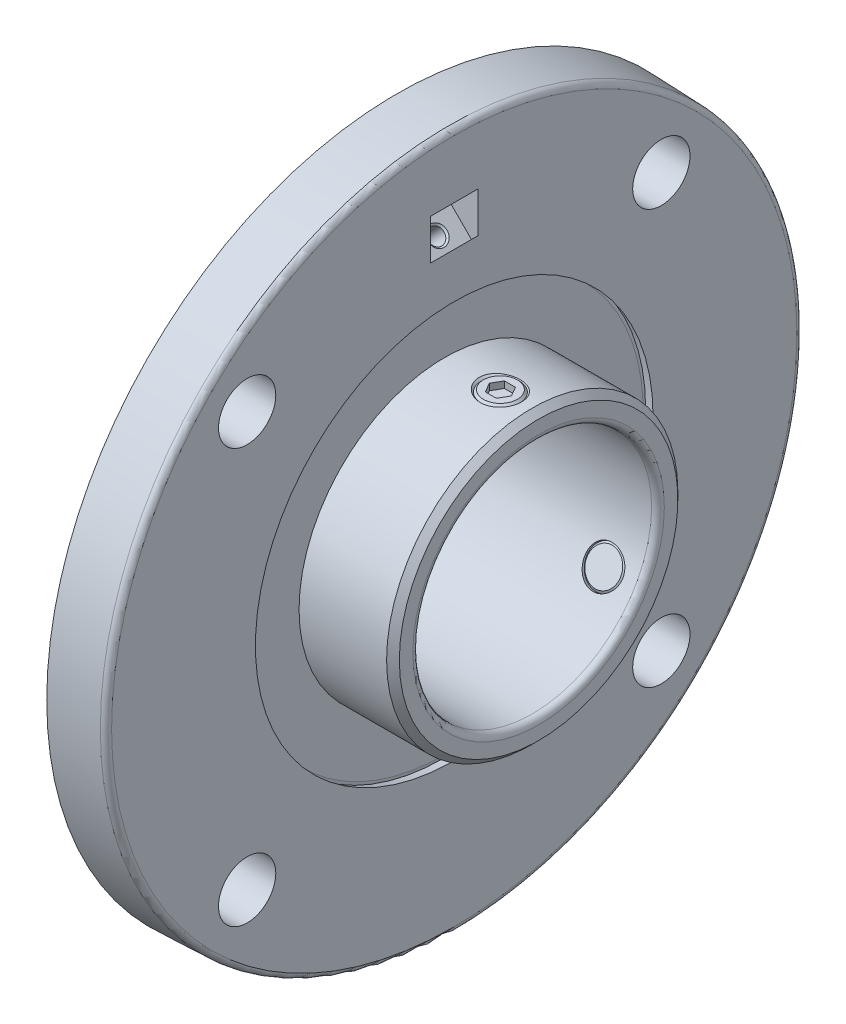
ISO-10303-21;
HEADER;
FILE_DESCRIPTION(('STEP AP214'),'2;1');
FILE_NAME('part.step','',(''),(''),'','','');
FILE_SCHEMA(('AUTOMOTIVE_DESIGN { 1 0 10303 214 1 1 1 1 }'));
ENDSEC;
DATA;
#1=APPLICATION_CONTEXT('core data for automotive mechanical design processes');
#2=APPLICATION_PROTOCOL_DEFINITION('international standard','automotive_design',2000,#1);
#3=PRODUCT_CONTEXT('',#1,'mechanical');
#4=PRODUCT('Part','Part','',(#3));
#5=PRODUCT_RELATED_PRODUCT_CATEGORY('part','',(#4));
#6=PRODUCT_DEFINITION_FORMATION('','',#4);
#7=PRODUCT_DEFINITION_CONTEXT('part definition',#1,'design');
#8=PRODUCT_DEFINITION('design','',#6,#7);
#9=PRODUCT_DEFINITION_SHAPE('','',#8);
#10=(LENGTH_UNIT() NAMED_UNIT(*) SI_UNIT(.MILLI.,.METRE.));
#11=(NAMED_UNIT(*) PLANE_ANGLE_UNIT() SI_UNIT($,.RADIAN.));
#12=(NAMED_UNIT(*) SI_UNIT($,.STERADIAN.) SOLID_ANGLE_UNIT());
#13=UNCERTAINTY_MEASURE_WITH_UNIT(LENGTH_MEASURE(1.E-05),#10,'distance_accuracy_value','');
#14=(GEOMETRIC_REPRESENTATION_CONTEXT(3) GLOBAL_UNCERTAINTY_ASSIGNED_CONTEXT((#13)) GLOBAL_UNIT_ASSIGNED_CONTEXT((#10,
#11,#12)) REPRESENTATION_CONTEXT('',''));
#15=CARTESIAN_POINT('',(0.,0.,0.));
#16=DIRECTION('',(0.,0.,1.));
#17=DIRECTION('',(1.,0.,0.));
#18=AXIS2_PLACEMENT_3D('',#15,#16,#17);
#19=CARTESIAN_POINT('',(0.,0.,0.));
#20=DIRECTION('',(0.,0.,1.));
#21=DIRECTION('',(1.,0.,0.));
#22=AXIS2_PLACEMENT_3D('',#19,#20,#21);
#23=SPHERICAL_SURFACE('',#22,65.);
#24=CARTESIAN_POINT('',(0.,0.,0.));
#25=DIRECTION('',(1.,0.,0.));
#26=DIRECTION('',(0.,0.,-1.));
#27=AXIS2_PLACEMENT_3D('',#24,#25,#26);
#28=SPHERICAL_SURFACE('',#27,65.);
#29=CARTESIAN_POINT('',(-15.,0.,0.));
#30=DIRECTION('',(1.,0.,0.));
#31=DIRECTION('',(0.,0.,-1.));
#32=AXIS2_PLACEMENT_3D('',#29,#30,#31);
#33=CIRCLE('',#32,63.2455532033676);
#34=CARTESIAN_POINT('',(-15.,0.,-63.2455532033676));
#35=VERTEX_POINT('',#34);
#36=EDGE_CURVE('E977',#35,#35,#33,.T.);
#37=ORIENTED_EDGE('',*,*,#36,.F.);
#38=EDGE_LOOP('',(#37));
#39=FACE_BOUND('',#38,.T.);
#40=CARTESIAN_POINT('',(-14.8504845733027,0.,0.));
#41=DIRECTION('',(-1.,0.,0.));
#42=DIRECTION('',(0.,0.,1.));
#43=AXIS2_PLACEMENT_3D('',#40,#41,#42);
#44=CIRCLE('',#43,63.2808273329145);
#45=CARTESIAN_POINT('',(-14.8504845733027,0.,63.2808273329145));
#46=VERTEX_POINT('',#45);
#47=EDGE_CURVE('E9',#46,#46,#44,.T.);
#48=ORIENTED_EDGE('',*,*,#47,.F.);
#49=EDGE_LOOP('',(#48));
#50=FACE_BOUND('',#49,.T.);
#51=ADVANCED_FACE('F15',(#39,#50),#28,.F.);
#52=CARTESIAN_POINT('',(0.,0.,0.));
#53=DIRECTION('',(1.,0.,0.));
#54=DIRECTION('',(0.,0.,-1.));
#55=AXIS2_PLACEMENT_3D('',#52,#53,#54);
#56=SPHERICAL_SURFACE('',#55,65.);
#57=CARTESIAN_POINT('',(18.,0.,0.));
#58=DIRECTION('',(1.,0.,0.));
#59=DIRECTION('',(0.,0.,-1.));
#60=AXIS2_PLACEMENT_3D('',#57,#58,#59);
#61=CIRCLE('',#60,62.4579858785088);
#62=CARTESIAN_POINT('',(18.,0.,-62.4579858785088));
#63=VERTEX_POINT('',#62);
#64=EDGE_CURVE('E969',#63,#63,#61,.T.);
#65=ORIENTED_EDGE('',*,*,#64,.T.);
#66=EDGE_LOOP('',(#65));
#67=FACE_BOUND('',#66,.T.);
#68=CARTESIAN_POINT('',(14.8504845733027,0.,0.));
#69=DIRECTION('',(1.,0.,0.));
#70=DIRECTION('',(0.,0.,-1.));
#71=AXIS2_PLACEMENT_3D('',#68,#69,#70);
#72=CIRCLE('',#71,63.2808273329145);
#73=CARTESIAN_POINT('',(14.8504845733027,0.,-63.2808273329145));
#74=VERTEX_POINT('',#73);
#75=EDGE_CURVE('E25',#74,#74,#72,.T.);
#76=ORIENTED_EDGE('',*,*,#75,.F.);
#77=EDGE_LOOP('',(#76));
#78=FACE_BOUND('',#77,.T.);
#79=ADVANCED_FACE('F424',(#67,#78),#56,.F.);
#80=CARTESIAN_POINT('',(-9.,0.,0.));
#81=DIRECTION('',(1.,0.,0.));
#82=DIRECTION('',(0.,0.,-1.));
#83=AXIS2_PLACEMENT_3D('',#80,#81,#82);
#84=CONICAL_SURFACE('',#83,80.,0.785398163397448);
#85=CARTESIAN_POINT('',(-15.,0.,0.));
#86=DIRECTION('',(-1.,0.,0.));
#87=DIRECTION('',(0.,0.,1.));
#88=AXIS2_PLACEMENT_3D('',#85,#86,#87);
#89=CIRCLE('',#88,74.);
#90=CARTESIAN_POINT('',(-15.,0.,74.));
#91=VERTEX_POINT('',#90);
#92=EDGE_CURVE('E954',#91,#91,#89,.T.);
#93=ORIENTED_EDGE('',*,*,#92,.F.);
#94=EDGE_LOOP('',(#93));
#95=FACE_BOUND('',#94,.T.);
#96=CARTESIAN_POINT('',(-9.,0.,0.));
#97=DIRECTION('',(-1.,0.,0.));
#98=DIRECTION('',(0.,0.,1.));
#99=AXIS2_PLACEMENT_3D('',#96,#97,#98);
#100=CIRCLE('',#99,80.);
#101=CARTESIAN_POINT('',(-9.,0.,80.));
#102=VERTEX_POINT('',#101);
#103=EDGE_CURVE('E981',#102,#102,#100,.T.);
#104=ORIENTED_EDGE('',*,*,#103,.T.);
#105=EDGE_LOOP('',(#104));
#106=FACE_BOUND('',#105,.T.);
#107=ADVANCED_FACE('F17',(#95,#106),#84,.T.);
#108=CARTESIAN_POINT('',(-15.,74.,0.));
#109=DIRECTION('',(1.,0.,0.));
#110=DIRECTION('',(0.,0.,-1.));
#111=AXIS2_PLACEMENT_3D('',#108,#109,#110);
#112=PLANE('',#111);
#113=ORIENTED_EDGE('',*,*,#36,.T.);
#114=EDGE_LOOP('',(#113));
#115=FACE_BOUND('',#114,.T.);
#116=ORIENTED_EDGE('',*,*,#92,.T.);
#117=EDGE_LOOP('',(#116));
#118=FACE_BOUND('',#117,.T.);
#119=ADVANCED_FACE('F1022',(#115,#118),#112,.F.);
#120=CARTESIAN_POINT('',(18.,107.634283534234,0.));
#121=DIRECTION('',(1.,0.,0.));
#122=DIRECTION('',(0.,0.,-1.));
#123=AXIS2_PLACEMENT_3D('',#120,#121,#122);
#124=PLANE('',#123);
#125=DIRECTION('',(0.,-1.,0.));
#126=VECTOR('',#125,1.);
#127=CARTESIAN_POINT('',(18.,107.634283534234,7.5));
#128=LINE('',#127,#126);
#129=CARTESIAN_POINT('',(18.,89.3639610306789,7.5));
#130=VERTEX_POINT('',#129);
#131=CARTESIAN_POINT('',(18.,76.6360389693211,7.5));
#132=VERTEX_POINT('',#131);
#133=EDGE_CURVE('E791',#130,#132,#128,.T.);
#134=ORIENTED_EDGE('',*,*,#133,.F.);
#135=DIRECTION('',(0.,0.,1.));
#136=VECTOR('',#135,1.);
#137=CARTESIAN_POINT('',(18.,89.3639610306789,0.));
#138=LINE('',#137,#136);
#139=CARTESIAN_POINT('',(18.,89.3639610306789,-7.5));
#140=VERTEX_POINT('',#139);
#141=EDGE_CURVE('E807',#140,#130,#138,.T.);
#142=ORIENTED_EDGE('',*,*,#141,.F.);
#143=DIRECTION('',(0.,1.,0.));
#144=VECTOR('',#143,1.);
#145=CARTESIAN_POINT('',(18.,107.634283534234,-7.5));
#146=LINE('',#145,#144);
#147=CARTESIAN_POINT('',(18.,76.6360389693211,-7.5));
#148=VERTEX_POINT('',#147);
#149=EDGE_CURVE('E1124',#148,#140,#146,.T.);
#150=ORIENTED_EDGE('',*,*,#149,.F.);
#151=DIRECTION('',(0.,0.,-1.));
#152=VECTOR('',#151,1.);
#153=CARTESIAN_POINT('',(18.,76.6360389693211,0.));
#154=LINE('',#153,#152);
#155=EDGE_CURVE('E896',#132,#148,#154,.T.);
#156=ORIENTED_EDGE('',*,*,#155,.F.);
#157=EDGE_LOOP('',(#134,#142,#150,#156));
#158=FACE_BOUND('',#157,.T.);
#159=CARTESIAN_POINT('',(18.,65.0538238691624,-65.0538238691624));
#160=DIRECTION('',(1.,0.,0.));
#161=DIRECTION('',(0.,0.,-1.));
#162=AXIS2_PLACEMENT_3D('',#159,#160,#161);
#163=CIRCLE('',#162,9.);
#164=CARTESIAN_POINT('',(18.,65.0538238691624,-74.0538238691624));
#165=VERTEX_POINT('',#164);
#166=EDGE_CURVE('E1082',#165,#165,#163,.T.);
#167=ORIENTED_EDGE('',*,*,#166,.F.);
#168=EDGE_LOOP('',(#167));
#169=FACE_BOUND('',#168,.T.);
#170=CARTESIAN_POINT('',(18.,-65.0538238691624,-65.0538238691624));
#171=DIRECTION('',(1.,0.,0.));
#172=DIRECTION('',(0.,0.,-1.));
#173=AXIS2_PLACEMENT_3D('',#170,#171,#172);
#174=CIRCLE('',#173,9.);
#175=CARTESIAN_POINT('',(18.,-65.0538238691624,-74.0538238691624));
#176=VERTEX_POINT('',#175);
#177=EDGE_CURVE('E1075',#176,#176,#174,.T.);
#178=ORIENTED_EDGE('',*,*,#177,.F.);
#179=EDGE_LOOP('',(#178));
#180=FACE_BOUND('',#179,.T.);
#181=CARTESIAN_POINT('',(18.,-65.0538238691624,65.0538238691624));
#182=DIRECTION('',(1.,0.,0.));
#183=DIRECTION('',(0.,0.,-1.));
#184=AXIS2_PLACEMENT_3D('',#181,#182,#183);
#185=CIRCLE('',#184,9.);
#186=CARTESIAN_POINT('',(18.,-65.0538238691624,56.0538238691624));
#187=VERTEX_POINT('',#186);
#188=EDGE_CURVE('E963',#187,#187,#185,.T.);
#189=ORIENTED_EDGE('',*,*,#188,.F.);
#190=EDGE_LOOP('',(#189));
#191=FACE_BOUND('',#190,.T.);
#192=CARTESIAN_POINT('',(18.,65.0538238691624,65.0538238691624));
#193=DIRECTION('',(1.,0.,0.));
#194=DIRECTION('',(0.,0.,-1.));
#195=AXIS2_PLACEMENT_3D('',#192,#193,#194);
#196=CIRCLE('',#195,9.);
#197=CARTESIAN_POINT('',(18.,65.0538238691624,56.0538238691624));
#198=VERTEX_POINT('',#197);
#199=EDGE_CURVE('E945',#198,#198,#196,.T.);
#200=ORIENTED_EDGE('',*,*,#199,.F.);
#201=EDGE_LOOP('',(#200));
#202=FACE_BOUND('',#201,.T.);
#203=ORIENTED_EDGE('',*,*,#64,.F.);
#204=EDGE_LOOP('',(#203));
#205=FACE_BOUND('',#204,.T.);
#206=CARTESIAN_POINT('',(18.,0.,0.));
#207=DIRECTION('',(-1.,0.,0.));
#208=DIRECTION('',(0.,0.,1.));
#209=AXIS2_PLACEMENT_3D('',#206,#207,#208);
#210=CIRCLE('',#209,107.634283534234);
#211=CARTESIAN_POINT('',(18.,0.,107.634283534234));
#212=VERTEX_POINT('',#211);
#213=EDGE_CURVE('E1007',#212,#212,#210,.T.);
#214=ORIENTED_EDGE('',*,*,#213,.F.);
#215=EDGE_LOOP('',(#214));
#216=FACE_BOUND('',#215,.T.);
#217=ADVANCED_FACE('F1018',(#158,#169,#180,#191,#202,#205,#216),#124,.T.);
#218=CARTESIAN_POINT('',(16.2,0.,0.));
#219=DIRECTION('',(-1.,0.,0.));
#220=DIRECTION('',(0.,0.,1.));
#221=AXIS2_PLACEMENT_3D('',#218,#219,#220);
#222=TOROIDAL_SURFACE('',#221,107.634283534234,1.8);
#223=CARTESIAN_POINT('',(16.2628190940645,0.,0.));
#224=DIRECTION('',(-1.,0.,0.));
#225=DIRECTION('',(0.,0.,1.));
#226=AXIS2_PLACEMENT_3D('',#223,#224,#225);
#227=CIRCLE('',#226,109.433187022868);
#228=CARTESIAN_POINT('',(16.2628190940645,0.,109.433187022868));
#229=VERTEX_POINT('',#228);
#230=EDGE_CURVE('E1003',#229,#229,#227,.T.);
#231=ORIENTED_EDGE('',*,*,#230,.F.);
#232=EDGE_LOOP('',(#231));
#233=FACE_BOUND('',#232,.T.);
#234=ORIENTED_EDGE('',*,*,#213,.T.);
#235=EDGE_LOOP('',(#234));
#236=FACE_BOUND('',#235,.T.);
#237=ADVANCED_FACE('F1021',(#233,#236),#222,.T.);
#238=CARTESIAN_POINT('',(16.2628190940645,0.,0.));
#239=DIRECTION('',(-1.,0.,0.));
#240=DIRECTION('',(0.,0.,1.));
#241=AXIS2_PLACEMENT_3D('',#238,#239,#240);
#242=CONICAL_SURFACE('',#241,109.433187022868,0.0348392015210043);
#243=CARTESIAN_POINT('',(0.,0.,0.));
#244=DIRECTION('',(-1.,0.,0.));
#245=DIRECTION('',(0.,0.,1.));
#246=AXIS2_PLACEMENT_3D('',#243,#244,#245);
#247=CIRCLE('',#246,110.);
#248=CARTESIAN_POINT('',(0.,0.,110.));
#249=VERTEX_POINT('',#248);
#250=EDGE_CURVE('E998',#249,#249,#247,.T.);
#251=ORIENTED_EDGE('',*,*,#250,.F.);
#252=EDGE_LOOP('',(#251));
#253=FACE_BOUND('',#252,.T.);
#254=ORIENTED_EDGE('',*,*,#230,.T.);
#255=EDGE_LOOP('',(#254));
#256=FACE_BOUND('',#255,.T.);
#257=ADVANCED_FACE('F1028',(#253,#256),#242,.T.);
#258=CARTESIAN_POINT('',(0.,110.,0.));
#259=DIRECTION('',(1.,0.,0.));
#260=DIRECTION('',(0.,0.,-1.));
#261=AXIS2_PLACEMENT_3D('',#258,#259,#260);
#262=PLANE('',#261);
#263=CARTESIAN_POINT('',(0.,0.,0.));
#264=DIRECTION('',(-1.,0.,0.));
#265=DIRECTION('',(0.,0.,1.));
#266=AXIS2_PLACEMENT_3D('',#263,#264,#265);
#267=CIRCLE('',#266,86.);
#268=CARTESIAN_POINT('',(0.,56.0553788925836,-65.221120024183));
#269=VERTEX_POINT('',#268);
#270=CARTESIAN_POINT('',(0.,-56.0553788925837,-65.221120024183));
#271=VERTEX_POINT('',#270);
#272=EDGE_CURVE('E999',#269,#271,#267,.T.);
#273=ORIENTED_EDGE('',*,*,#272,.F.);
#274=CARTESIAN_POINT('',(0.,65.0538238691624,-65.0538238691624));
#275=DIRECTION('',(1.,0.,0.));
#276=DIRECTION('',(0.,0.,-1.));
#277=AXIS2_PLACEMENT_3D('',#274,#275,#276);
#278=CIRCLE('',#277,9.);
#279=CARTESIAN_POINT('',(0.,65.221120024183,-56.0553788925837));
#280=VERTEX_POINT('',#279);
#281=EDGE_CURVE('E39',#269,#280,#278,.T.);
#282=ORIENTED_EDGE('',*,*,#281,.T.);
#283=CARTESIAN_POINT('',(0.,65.2211200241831,56.0553788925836));
#284=VERTEX_POINT('',#283);
#285=EDGE_CURVE('E961',#284,#280,#267,.T.);
#286=ORIENTED_EDGE('',*,*,#285,.F.);
#287=CARTESIAN_POINT('',(0.,65.0538238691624,65.0538238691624));
#288=DIRECTION('',(1.,0.,0.));
#289=DIRECTION('',(0.,0.,-1.));
#290=AXIS2_PLACEMENT_3D('',#287,#288,#289);
#291=CIRCLE('',#290,9.);
#292=CARTESIAN_POINT('',(0.,56.0553788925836,65.221120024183));
#293=VERTEX_POINT('',#292);
#294=EDGE_CURVE('E949',#284,#293,#291,.T.);
#295=ORIENTED_EDGE('',*,*,#294,.T.);
#296=CARTESIAN_POINT('',(0.,-56.0553788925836,65.2211200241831));
#297=VERTEX_POINT('',#296);
#298=EDGE_CURVE('E960',#297,#293,#267,.T.);
#299=ORIENTED_EDGE('',*,*,#298,.F.);
#300=CARTESIAN_POINT('',(0.,-65.0538238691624,65.0538238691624));
#301=DIRECTION('',(1.,0.,0.));
#302=DIRECTION('',(0.,0.,-1.));
#303=AXIS2_PLACEMENT_3D('',#300,#301,#302);
#304=CIRCLE('',#303,9.);
#305=CARTESIAN_POINT('',(0.,-65.221120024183,56.0553788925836));
#306=VERTEX_POINT('',#305);
#307=EDGE_CURVE('E973',#297,#306,#304,.T.);
#308=ORIENTED_EDGE('',*,*,#307,.T.);
#309=CARTESIAN_POINT('',(0.,-65.221120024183,-56.0553788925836));
#310=VERTEX_POINT('',#309);
#311=EDGE_CURVE('E1064',#310,#306,#267,.T.);
#312=ORIENTED_EDGE('',*,*,#311,.F.);
#313=CARTESIAN_POINT('',(0.,-65.0538238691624,-65.0538238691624));
#314=DIRECTION('',(1.,0.,0.));
#315=DIRECTION('',(0.,0.,-1.));
#316=AXIS2_PLACEMENT_3D('',#313,#314,#315);
#317=CIRCLE('',#316,9.);
#318=EDGE_CURVE('E1062',#310,#271,#317,.T.);
#319=ORIENTED_EDGE('',*,*,#318,.T.);
#320=EDGE_LOOP('',(#273,#282,#286,#295,#299,#308,#312,#319));
#321=FACE_BOUND('',#320,.T.);
#322=ORIENTED_EDGE('',*,*,#250,.T.);
#323=EDGE_LOOP('',(#322));
#324=FACE_BOUND('',#323,.T.);
#325=ADVANCED_FACE('F909',(#321,#324),#262,.F.);
#326=CARTESIAN_POINT('',(0.,0.,0.));
#327=DIRECTION('',(-1.,0.,0.));
#328=DIRECTION('',(0.,0.,1.));
#329=AXIS2_PLACEMENT_3D('',#326,#327,#328);
#330=CONICAL_SURFACE('',#329,86.,1.40564764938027);
#331=CARTESIAN_POINT('',(0.75,0.,0.));
#332=DIRECTION('',(-1.,0.,0.));
#333=DIRECTION('',(0.,0.,1.));
#334=AXIS2_PLACEMENT_3D('',#331,#332,#333);
#335=CIRCLE('',#334,81.5);
#336=CARTESIAN_POINT('',(0.75,0.,81.5));
#337=VERTEX_POINT('',#336);
#338=EDGE_CURVE('E993',#337,#337,#335,.T.);
#339=ORIENTED_EDGE('',*,*,#338,.F.);
#340=EDGE_LOOP('',(#339));
#341=FACE_BOUND('',#340,.T.);
#342=ORIENTED_EDGE('',*,*,#285,.T.);
#343=CARTESIAN_POINT('',(-2.00000000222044E-06,65.2211355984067,-56.055379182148));
#344=CARTESIAN_POINT('',(0.03216821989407,64.9706452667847,-56.0506954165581));
#345=CARTESIAN_POINT('',(0.0631669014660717,64.7198051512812,-56.056519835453));
#346=CARTESIAN_POINT('',(0.122560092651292,64.2191717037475,-56.0891066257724));
#347=CARTESIAN_POINT('',(0.150954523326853,63.9693784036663,-56.115869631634));
#348=CARTESIAN_POINT('',(0.204868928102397,63.4726667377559,-56.1902455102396));
#349=CARTESIAN_POINT('',(0.230389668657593,63.2257476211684,-56.2378528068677));
#350=CARTESIAN_POINT('',(0.278325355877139,62.7364819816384,-56.3536449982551));
#351=CARTESIAN_POINT('',(0.300740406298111,62.4941353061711,-56.4218292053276));
#352=CARTESIAN_POINT('',(0.342266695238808,62.0155386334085,-56.5784315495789));
#353=CARTESIAN_POINT('',(0.361375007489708,61.7792941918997,-56.6668674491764));
#354=CARTESIAN_POINT('',(0.396073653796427,61.314841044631,-56.8633666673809));
#355=CARTESIAN_POINT('',(0.411663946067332,61.0866324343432,-56.9714302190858));
#356=CARTESIAN_POINT('',(0.439162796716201,60.6400053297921,-57.2064130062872));
#357=CARTESIAN_POINT('',(0.451072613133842,60.4215835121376,-57.3333257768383));
#358=CARTESIAN_POINT('',(0.471094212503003,59.9960599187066,-57.6051487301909));
#359=CARTESIAN_POINT('',(0.479206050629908,59.7889579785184,-57.7500586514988));
#360=CARTESIAN_POINT('',(0.491486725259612,59.3895566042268,-58.0553495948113));
#361=CARTESIAN_POINT('',(0.495693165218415,59.1971327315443,-58.2155663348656));
#362=CARTESIAN_POINT('',(0.500254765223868,58.8262764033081,-58.5514975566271));
#363=CARTESIAN_POINT('',(0.500609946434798,58.6478438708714,-58.7272119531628));
#364=CARTESIAN_POINT('',(0.497465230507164,58.306240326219,-59.092890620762));
#365=CARTESIAN_POINT('',(0.493965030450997,58.1430705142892,-59.2828560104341));
#366=CARTESIAN_POINT('',(0.483145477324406,57.8331717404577,-59.6756492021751));
#367=CARTESIAN_POINT('',(0.475826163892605,57.6864426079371,-59.8784768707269));
#368=CARTESIAN_POINT('',(0.45749161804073,57.4111676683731,-60.2944450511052));
#369=CARTESIAN_POINT('',(0.446495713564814,57.2825316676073,-60.5075267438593));
#370=CARTESIAN_POINT('',(0.420910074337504,57.0434234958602,-60.94343690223));
#371=CARTESIAN_POINT('',(0.406320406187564,56.9329509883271,-61.166265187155));
#372=CARTESIAN_POINT('',(0.373692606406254,56.7309000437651,-61.6200746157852));
#373=CARTESIAN_POINT('',(0.355654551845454,56.6393211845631,-61.8510555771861));
#374=CARTESIAN_POINT('',(0.316305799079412,56.4756441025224,-62.3195269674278));
#375=CARTESIAN_POINT('',(0.294995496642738,56.40354352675,-62.5570166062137));
#376=CARTESIAN_POINT('',(0.253294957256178,56.2900984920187,-62.9949457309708));
#377=CARTESIAN_POINT('',(0.233393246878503,56.2455824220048,-63.1946176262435));
#378=CARTESIAN_POINT('',(0.191624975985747,56.1702766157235,-63.5963129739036));
#379=CARTESIAN_POINT('',(0.169758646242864,56.1394852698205,-63.79833614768));
#380=CARTESIAN_POINT('',(0.124215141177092,56.0917527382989,-64.2036109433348));
#381=CARTESIAN_POINT('',(0.100539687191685,56.0747985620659,-64.4068612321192));
#382=CARTESIAN_POINT('',(0.0514996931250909,56.0547134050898,-64.8138624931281));
#383=CARTESIAN_POINT('',(0.0261349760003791,56.0515838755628,-65.0176135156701));
#384=CARTESIAN_POINT('',(-2.00000000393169E-06,56.055379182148,-65.2211355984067));
#385=B_SPLINE_CURVE_WITH_KNOTS('',3,(#343,#344,#345,#346,#347,#348,#349,#350,#351,#352,#353,
#354,#355,#356,#357,#358,#359,#360,#361,#362,#363,#364,#365,#366,#367,#368,#369,#370,#371,#372,
#373,#374,#375,#376,#377,#378,#379,#380,#381,#382,#383,#384),.UNSPECIFIED.,.F.,.F.,(4,2,2,2,2,2,
2,2,2,2,2,2,2,2,2,2,2,2,2,2,4),(0.,0.757558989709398,1.51514093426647,2.27252033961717,
3.02987443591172,3.78789535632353,4.54592527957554,5.30369580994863,6.0614553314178,
6.8118406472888,7.56222183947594,8.31266199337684,9.06309435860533,9.8096421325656,
10.5561760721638,11.3026933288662,12.0491203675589,12.6652759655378,13.2813592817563,
13.8968635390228,14.5124324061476),.UNSPECIFIED.);
#386=EDGE_CURVE('E888',#280,#269,#385,.T.);
#387=ORIENTED_EDGE('',*,*,#386,.T.);
#388=ORIENTED_EDGE('',*,*,#272,.T.);
#389=CARTESIAN_POINT('',(-2.00000000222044E-06,-56.055379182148,-65.2211355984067));
#390=CARTESIAN_POINT('',(0.03216821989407,-56.0506954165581,-64.9706452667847));
#391=CARTESIAN_POINT('',(0.0631669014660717,-56.056519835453,-64.7198051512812));
#392=CARTESIAN_POINT('',(0.122560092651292,-56.0891066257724,-64.2191717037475));
#393=CARTESIAN_POINT('',(0.150954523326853,-56.115869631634,-63.9693784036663));
#394=CARTESIAN_POINT('',(0.204868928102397,-56.1902455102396,-63.4726667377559));
#395=CARTESIAN_POINT('',(0.230389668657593,-56.2378528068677,-63.2257476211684));
#396=CARTESIAN_POINT('',(0.278325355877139,-56.3536449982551,-62.7364819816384));
#397=CARTESIAN_POINT('',(0.300740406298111,-56.4218292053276,-62.4941353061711));
#398=CARTESIAN_POINT('',(0.342266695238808,-56.5784315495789,-62.0155386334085));
#399=CARTESIAN_POINT('',(0.361375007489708,-56.6668674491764,-61.7792941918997));
#400=CARTESIAN_POINT('',(0.396073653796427,-56.8633666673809,-61.314841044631));
#401=CARTESIAN_POINT('',(0.411663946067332,-56.9714302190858,-61.0866324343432));
#402=CARTESIAN_POINT('',(0.439162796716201,-57.2064130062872,-60.6400053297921));
#403=CARTESIAN_POINT('',(0.451072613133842,-57.3333257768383,-60.4215835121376));
#404=CARTESIAN_POINT('',(0.471094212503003,-57.6051487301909,-59.9960599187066));
#405=CARTESIAN_POINT('',(0.479206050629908,-57.7500586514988,-59.7889579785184));
#406=CARTESIAN_POINT('',(0.491486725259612,-58.0553495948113,-59.3895566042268));
#407=CARTESIAN_POINT('',(0.495693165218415,-58.2155663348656,-59.1971327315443));
#408=CARTESIAN_POINT('',(0.500254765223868,-58.5514975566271,-58.8262764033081));
#409=CARTESIAN_POINT('',(0.500609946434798,-58.7272119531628,-58.6478438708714));
#410=CARTESIAN_POINT('',(0.497465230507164,-59.092890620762,-58.306240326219));
#411=CARTESIAN_POINT('',(0.493965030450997,-59.2828560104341,-58.1430705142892));
#412=CARTESIAN_POINT('',(0.483145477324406,-59.6756492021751,-57.8331717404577));
#413=CARTESIAN_POINT('',(0.475826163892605,-59.8784768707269,-57.6864426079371));
#414=CARTESIAN_POINT('',(0.45749161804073,-60.2944450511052,-57.4111676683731));
#415=CARTESIAN_POINT('',(0.446495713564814,-60.5075267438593,-57.2825316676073));
#416=CARTESIAN_POINT('',(0.420910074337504,-60.94343690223,-57.0434234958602));
#417=CARTESIAN_POINT('',(0.406320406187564,-61.166265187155,-56.9329509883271));
#418=CARTESIAN_POINT('',(0.373692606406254,-61.6200746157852,-56.7309000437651));
#419=CARTESIAN_POINT('',(0.355654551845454,-61.8510555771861,-56.6393211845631));
#420=CARTESIAN_POINT('',(0.316305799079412,-62.3195269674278,-56.4756441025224));
#421=CARTESIAN_POINT('',(0.294995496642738,-62.5570166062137,-56.40354352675));
#422=CARTESIAN_POINT('',(0.253294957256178,-62.9949457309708,-56.2900984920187));
#423=CARTESIAN_POINT('',(0.233393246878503,-63.1946176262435,-56.2455824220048));
#424=CARTESIAN_POINT('',(0.191624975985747,-63.5963129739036,-56.1702766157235));
#425=CARTESIAN_POINT('',(0.169758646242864,-63.79833614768,-56.1394852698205));
#426=CARTESIAN_POINT('',(0.124215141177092,-64.2036109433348,-56.0917527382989));
#427=CARTESIAN_POINT('',(0.100539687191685,-64.4068612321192,-56.0747985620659));
#428=CARTESIAN_POINT('',(0.0514996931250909,-64.8138624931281,-56.0547134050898));
#429=CARTESIAN_POINT('',(0.0261349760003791,-65.0176135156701,-56.0515838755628));
#430=CARTESIAN_POINT('',(-2.00000000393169E-06,-65.2211355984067,-56.055379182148));
#431=B_SPLINE_CURVE_WITH_KNOTS('',3,(#389,#390,#391,#392,#393,#394,#395,#396,#397,#398,#399,
#400,#401,#402,#403,#404,#405,#406,#407,#408,#409,#410,#411,#412,#413,#414,#415,#416,#417,#418,
#419,#420,#421,#422,#423,#424,#425,#426,#427,#428,#429,#430),.UNSPECIFIED.,.F.,.F.,(4,2,2,2,2,2,
2,2,2,2,2,2,2,2,2,2,2,2,2,2,4),(0.,0.757558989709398,1.51514093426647,2.27252033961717,
3.02987443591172,3.78789535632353,4.54592527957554,5.30369580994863,6.0614553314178,
6.8118406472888,7.56222183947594,8.31266199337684,9.06309435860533,9.8096421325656,
10.5561760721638,11.3026933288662,12.0491203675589,12.6652759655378,13.2813592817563,
13.8968635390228,14.5124324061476),.UNSPECIFIED.);
#432=EDGE_CURVE('E897',#271,#310,#431,.T.);
#433=ORIENTED_EDGE('',*,*,#432,.T.);
#434=ORIENTED_EDGE('',*,*,#311,.T.);
#435=CARTESIAN_POINT('',(-2.00000000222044E-06,-65.2211355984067,56.055379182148));
#436=CARTESIAN_POINT('',(0.0321682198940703,-64.9706452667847,56.0506954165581));
#437=CARTESIAN_POINT('',(0.0631669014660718,-64.7198051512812,56.056519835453));
#438=CARTESIAN_POINT('',(0.122560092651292,-64.2191717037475,56.0891066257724));
#439=CARTESIAN_POINT('',(0.150954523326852,-63.9693784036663,56.115869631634));
#440=CARTESIAN_POINT('',(0.204868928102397,-63.4726667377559,56.1902455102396));
#441=CARTESIAN_POINT('',(0.230389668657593,-63.2257476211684,56.2378528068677));
#442=CARTESIAN_POINT('',(0.278325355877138,-62.7364819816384,56.3536449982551));
#443=CARTESIAN_POINT('',(0.300740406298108,-62.4941353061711,56.4218292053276));
#444=CARTESIAN_POINT('',(0.342266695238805,-62.0155386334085,56.5784315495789));
#445=CARTESIAN_POINT('',(0.361375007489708,-61.7792941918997,56.6668674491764));
#446=CARTESIAN_POINT('',(0.396073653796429,-61.314841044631,56.8633666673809));
#447=CARTESIAN_POINT('',(0.411663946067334,-61.0866324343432,56.9714302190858));
#448=CARTESIAN_POINT('',(0.439162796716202,-60.6400053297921,57.2064130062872));
#449=CARTESIAN_POINT('',(0.451072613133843,-60.4215835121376,57.3333257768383));
#450=CARTESIAN_POINT('',(0.471094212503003,-59.9960599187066,57.6051487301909));
#451=CARTESIAN_POINT('',(0.479206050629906,-59.7889579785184,57.7500586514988));
#452=CARTESIAN_POINT('',(0.49148672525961,-59.3895566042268,58.0553495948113));
#453=CARTESIAN_POINT('',(0.495693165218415,-59.1971327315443,58.2155663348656));
#454=CARTESIAN_POINT('',(0.500254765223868,-58.8262764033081,58.5514975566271));
#455=CARTESIAN_POINT('',(0.500609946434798,-58.6478438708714,58.7272119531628));
#456=CARTESIAN_POINT('',(0.497465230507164,-58.306240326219,59.092890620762));
#457=CARTESIAN_POINT('',(0.493965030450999,-58.1430705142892,59.2828560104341));
#458=CARTESIAN_POINT('',(0.483145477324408,-57.8331717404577,59.6756492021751));
#459=CARTESIAN_POINT('',(0.475826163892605,-57.6864426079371,59.8784768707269));
#460=CARTESIAN_POINT('',(0.457491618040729,-57.4111676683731,60.2944450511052));
#461=CARTESIAN_POINT('',(0.446495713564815,-57.2825316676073,60.5075267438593));
#462=CARTESIAN_POINT('',(0.420910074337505,-57.0434234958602,60.94343690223));
#463=CARTESIAN_POINT('',(0.406320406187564,-56.9329509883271,61.166265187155));
#464=CARTESIAN_POINT('',(0.373692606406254,-56.7309000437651,61.6200746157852));
#465=CARTESIAN_POINT('',(0.355654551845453,-56.6393211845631,61.8510555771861));
#466=CARTESIAN_POINT('',(0.316305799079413,-56.4756441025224,62.3195269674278));
#467=CARTESIAN_POINT('',(0.294995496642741,-56.40354352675,62.5570166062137));
#468=CARTESIAN_POINT('',(0.253294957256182,-56.2900984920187,62.9949457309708));
#469=CARTESIAN_POINT('',(0.233393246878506,-56.2455824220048,63.1946176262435));
#470=CARTESIAN_POINT('',(0.191624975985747,-56.1702766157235,63.5963129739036));
#471=CARTESIAN_POINT('',(0.169758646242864,-56.1394852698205,63.79833614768));
#472=CARTESIAN_POINT('',(0.124215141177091,-56.0917527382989,64.2036109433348));
#473=CARTESIAN_POINT('',(0.100539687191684,-56.0747985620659,64.4068612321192));
#474=CARTESIAN_POINT('',(0.0514996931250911,-56.0547134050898,64.8138624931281));
#475=CARTESIAN_POINT('',(0.0261349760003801,-56.0515838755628,65.0176135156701));
#476=CARTESIAN_POINT('',(-2.0000000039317E-06,-56.055379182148,65.2211355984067));
#477=B_SPLINE_CURVE_WITH_KNOTS('',3,(#435,#436,#437,#438,#439,#440,#441,#442,#443,#444,#445,
#446,#447,#448,#449,#450,#451,#452,#453,#454,#455,#456,#457,#458,#459,#460,#461,#462,#463,#464,
#465,#466,#467,#468,#469,#470,#471,#472,#473,#474,#475,#476),.UNSPECIFIED.,.F.,.F.,(4,2,2,2,2,2,
2,2,2,2,2,2,2,2,2,2,2,2,2,2,4),(0.,0.757558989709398,1.51514093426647,2.27252033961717,
3.02987443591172,3.78789535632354,4.54592527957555,5.30369580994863,6.06145533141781,
6.8118406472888,7.56222183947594,8.31266199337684,9.06309435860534,9.80964213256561,
10.5561760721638,11.3026933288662,12.0491203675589,12.6652759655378,13.2813592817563,
13.8968635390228,14.5124324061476),.UNSPECIFIED.);
#478=EDGE_CURVE('E922',#306,#297,#477,.T.);
#479=ORIENTED_EDGE('',*,*,#478,.T.);
#480=ORIENTED_EDGE('',*,*,#298,.T.);
#481=CARTESIAN_POINT('',(-2.00000000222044E-06,56.055379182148,65.2211355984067));
#482=CARTESIAN_POINT('',(0.0321682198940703,56.0506954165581,64.9706452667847));
#483=CARTESIAN_POINT('',(0.0631669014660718,56.056519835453,64.7198051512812));
#484=CARTESIAN_POINT('',(0.122560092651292,56.0891066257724,64.2191717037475));
#485=CARTESIAN_POINT('',(0.150954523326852,56.115869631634,63.9693784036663));
#486=CARTESIAN_POINT('',(0.204868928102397,56.1902455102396,63.4726667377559));
#487=CARTESIAN_POINT('',(0.230389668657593,56.2378528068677,63.2257476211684));
#488=CARTESIAN_POINT('',(0.278325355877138,56.3536449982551,62.7364819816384));
#489=CARTESIAN_POINT('',(0.300740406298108,56.4218292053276,62.4941353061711));
#490=CARTESIAN_POINT('',(0.342266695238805,56.5784315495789,62.0155386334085));
#491=CARTESIAN_POINT('',(0.361375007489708,56.6668674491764,61.7792941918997));
#492=CARTESIAN_POINT('',(0.396073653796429,56.8633666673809,61.314841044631));
#493=CARTESIAN_POINT('',(0.411663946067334,56.9714302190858,61.0866324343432));
#494=CARTESIAN_POINT('',(0.439162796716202,57.2064130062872,60.6400053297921));
#495=CARTESIAN_POINT('',(0.451072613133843,57.3333257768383,60.4215835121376));
#496=CARTESIAN_POINT('',(0.471094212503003,57.6051487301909,59.9960599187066));
#497=CARTESIAN_POINT('',(0.479206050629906,57.7500586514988,59.7889579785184));
#498=CARTESIAN_POINT('',(0.49148672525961,58.0553495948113,59.3895566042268));
#499=CARTESIAN_POINT('',(0.495693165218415,58.2155663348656,59.1971327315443));
#500=CARTESIAN_POINT('',(0.500254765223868,58.5514975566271,58.8262764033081));
#501=CARTESIAN_POINT('',(0.500609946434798,58.7272119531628,58.6478438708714));
#502=CARTESIAN_POINT('',(0.497465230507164,59.092890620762,58.306240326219));
#503=CARTESIAN_POINT('',(0.493965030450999,59.2828560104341,58.1430705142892));
#504=CARTESIAN_POINT('',(0.483145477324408,59.6756492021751,57.8331717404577));
#505=CARTESIAN_POINT('',(0.475826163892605,59.8784768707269,57.6864426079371));
#506=CARTESIAN_POINT('',(0.457491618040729,60.2944450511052,57.4111676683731));
#507=CARTESIAN_POINT('',(0.446495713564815,60.5075267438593,57.2825316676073));
#508=CARTESIAN_POINT('',(0.420910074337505,60.94343690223,57.0434234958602));
#509=CARTESIAN_POINT('',(0.406320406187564,61.166265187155,56.9329509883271));
#510=CARTESIAN_POINT('',(0.373692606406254,61.6200746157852,56.7309000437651));
#511=CARTESIAN_POINT('',(0.355654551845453,61.8510555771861,56.6393211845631));
#512=CARTESIAN_POINT('',(0.316305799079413,62.3195269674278,56.4756441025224));
#513=CARTESIAN_POINT('',(0.294995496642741,62.5570166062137,56.40354352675));
#514=CARTESIAN_POINT('',(0.253294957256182,62.9949457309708,56.2900984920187));
#515=CARTESIAN_POINT('',(0.233393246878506,63.1946176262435,56.2455824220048));
#516=CARTESIAN_POINT('',(0.191624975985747,63.5963129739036,56.1702766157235));
#517=CARTESIAN_POINT('',(0.169758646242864,63.79833614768,56.1394852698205));
#518=CARTESIAN_POINT('',(0.124215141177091,64.2036109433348,56.0917527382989));
#519=CARTESIAN_POINT('',(0.100539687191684,64.4068612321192,56.0747985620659));
#520=CARTESIAN_POINT('',(0.0514996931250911,64.8138624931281,56.0547134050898));
#521=CARTESIAN_POINT('',(0.0261349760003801,65.0176135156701,56.0515838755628));
#522=CARTESIAN_POINT('',(-2.0000000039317E-06,65.2211355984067,56.055379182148));
#523=B_SPLINE_CURVE_WITH_KNOTS('',3,(#481,#482,#483,#484,#485,#486,#487,#488,#489,#490,#491,
#492,#493,#494,#495,#496,#497,#498,#499,#500,#501,#502,#503,#504,#505,#506,#507,#508,#509,#510,
#511,#512,#513,#514,#515,#516,#517,#518,#519,#520,#521,#522),.UNSPECIFIED.,.F.,.F.,(4,2,2,2,2,2,
2,2,2,2,2,2,2,2,2,2,2,2,2,2,4),(0.,0.757558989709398,1.51514093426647,2.27252033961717,
3.02987443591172,3.78789535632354,4.54592527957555,5.30369580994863,6.06145533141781,
6.8118406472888,7.56222183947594,8.31266199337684,9.06309435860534,9.80964213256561,
10.5561760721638,11.3026933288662,12.0491203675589,12.6652759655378,13.2813592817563,
13.8968635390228,14.5124324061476),.UNSPECIFIED.);
#524=EDGE_CURVE('E916',#293,#284,#523,.T.);
#525=ORIENTED_EDGE('',*,*,#524,.T.);
#526=EDGE_LOOP('',(#342,#387,#388,#433,#434,#479,#480,#525));
#527=FACE_BOUND('',#526,.T.);
#528=ADVANCED_FACE('F903',(#341,#527),#330,.F.);
#529=CARTESIAN_POINT('',(0.75,81.5,0.));
#530=DIRECTION('',(1.,0.,0.));
#531=DIRECTION('',(0.,0.,-1.));
#532=AXIS2_PLACEMENT_3D('',#529,#530,#531);
#533=PLANE('',#532);
#534=CARTESIAN_POINT('',(0.75,0.,0.));
#535=DIRECTION('',(-1.,0.,0.));
#536=DIRECTION('',(0.,0.,1.));
#537=AXIS2_PLACEMENT_3D('',#534,#535,#536);
#538=CIRCLE('',#537,80.75);
#539=CARTESIAN_POINT('',(0.75,0.,80.75));
#540=VERTEX_POINT('',#539);
#541=EDGE_CURVE('E989',#540,#540,#538,.T.);
#542=ORIENTED_EDGE('',*,*,#541,.F.);
#543=EDGE_LOOP('',(#542));
#544=FACE_BOUND('',#543,.T.);
#545=ORIENTED_EDGE('',*,*,#338,.T.);
#546=EDGE_LOOP('',(#545));
#547=FACE_BOUND('',#546,.T.);
#548=ADVANCED_FACE('F908',(#544,#547),#533,.F.);
#549=CARTESIAN_POINT('',(0.,0.,0.));
#550=DIRECTION('',(-1.,0.,0.));
#551=DIRECTION('',(0.,0.,1.));
#552=AXIS2_PLACEMENT_3D('',#549,#550,#551);
#553=TOROIDAL_SURFACE('',#552,80.75,0.75);
#554=ORIENTED_EDGE('',*,*,#541,.T.);
#555=EDGE_LOOP('',(#554));
#556=FACE_BOUND('',#555,.T.);
#557=CARTESIAN_POINT('',(0.,0.,0.));
#558=DIRECTION('',(-1.,0.,0.));
#559=DIRECTION('',(0.,0.,1.));
#560=AXIS2_PLACEMENT_3D('',#557,#558,#559);
#561=CIRCLE('',#560,80.);
#562=CARTESIAN_POINT('',(0.,0.,80.));
#563=VERTEX_POINT('',#562);
#564=EDGE_CURVE('E985',#563,#563,#561,.T.);
#565=ORIENTED_EDGE('',*,*,#564,.F.);
#566=EDGE_LOOP('',(#565));
#567=FACE_BOUND('',#566,.T.);
#568=ADVANCED_FACE('F940',(#556,#567),#553,.F.);
#569=CARTESIAN_POINT('',(-15.,0.,0.));
#570=DIRECTION('',(-1.,0.,0.));
#571=DIRECTION('',(0.,0.,1.));
#572=AXIS2_PLACEMENT_3D('',#569,#570,#571);
#573=CYLINDRICAL_SURFACE('',#572,80.);
#574=ORIENTED_EDGE('',*,*,#103,.F.);
#575=EDGE_LOOP('',(#574));
#576=FACE_BOUND('',#575,.T.);
#577=ORIENTED_EDGE('',*,*,#564,.T.);
#578=EDGE_LOOP('',(#577));
#579=FACE_BOUND('',#578,.T.);
#580=ADVANCED_FACE('F935',(#576,#579),#573,.T.);
#581=CARTESIAN_POINT('',(-33.,65.0538238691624,65.0538238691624));
#582=DIRECTION('',(1.,0.,0.));
#583=DIRECTION('',(0.,-0.707106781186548,-0.707106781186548));
#584=AXIS2_PLACEMENT_3D('',#581,#582,#583);
#585=CYLINDRICAL_SURFACE('',#584,9.);
#586=ORIENTED_EDGE('',*,*,#199,.T.);
#587=EDGE_LOOP('',(#586));
#588=FACE_BOUND('',#587,.T.);
#589=ORIENTED_EDGE('',*,*,#524,.F.);
#590=ORIENTED_EDGE('',*,*,#294,.F.);
#591=EDGE_LOOP('',(#589,#590));
#592=FACE_BOUND('',#591,.T.);
#593=ADVANCED_FACE('F931',(#588,#592),#585,.F.);
#594=CARTESIAN_POINT('',(-33.,-65.0538238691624,65.0538238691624));
#595=DIRECTION('',(1.,0.,0.));
#596=DIRECTION('',(0.,0.707106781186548,-0.707106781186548));
#597=AXIS2_PLACEMENT_3D('',#594,#595,#596);
#598=CYLINDRICAL_SURFACE('',#597,9.);
#599=ORIENTED_EDGE('',*,*,#188,.T.);
#600=EDGE_LOOP('',(#599));
#601=FACE_BOUND('',#600,.T.);
#602=ORIENTED_EDGE('',*,*,#478,.F.);
#603=ORIENTED_EDGE('',*,*,#307,.F.);
#604=EDGE_LOOP('',(#602,#603));
#605=FACE_BOUND('',#604,.T.);
#606=ADVANCED_FACE('F928',(#601,#605),#598,.F.);
#607=CARTESIAN_POINT('',(-33.,-65.0538238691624,-65.0538238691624));
#608=DIRECTION('',(1.,0.,0.));
#609=DIRECTION('',(0.,0.707106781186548,0.707106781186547));
#610=AXIS2_PLACEMENT_3D('',#607,#608,#609);
#611=CYLINDRICAL_SURFACE('',#610,9.);
#612=ORIENTED_EDGE('',*,*,#177,.T.);
#613=EDGE_LOOP('',(#612));
#614=FACE_BOUND('',#613,.T.);
#615=ORIENTED_EDGE('',*,*,#432,.F.);
#616=ORIENTED_EDGE('',*,*,#318,.F.);
#617=EDGE_LOOP('',(#615,#616));
#618=FACE_BOUND('',#617,.T.);
#619=ADVANCED_FACE('F883',(#614,#618),#611,.F.);
#620=CARTESIAN_POINT('',(-33.,65.0538238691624,-65.0538238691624));
#621=DIRECTION('',(1.,0.,0.));
#622=DIRECTION('',(0.,-0.707106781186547,0.707106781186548));
#623=AXIS2_PLACEMENT_3D('',#620,#621,#622);
#624=CYLINDRICAL_SURFACE('',#623,9.);
#625=ORIENTED_EDGE('',*,*,#166,.T.);
#626=EDGE_LOOP('',(#625));
#627=FACE_BOUND('',#626,.T.);
#628=ORIENTED_EDGE('',*,*,#386,.F.);
#629=ORIENTED_EDGE('',*,*,#281,.F.);
#630=EDGE_LOOP('',(#628,#629));
#631=FACE_BOUND('',#630,.T.);
#632=ADVANCED_FACE('F877',(#627,#631),#624,.F.);
#633=CARTESIAN_POINT('',(13.4350288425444,78.4350288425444,0.));
#634=DIRECTION('',(0.707106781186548,0.707106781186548,0.));
#635=DIRECTION('',(0.,0.,1.));
#636=AXIS2_PLACEMENT_3D('',#633,#634,#635);
#637=CYLINDRICAL_SURFACE('',#636,2.45875);
#638=CARTESIAN_POINT('',(12.3452005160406,77.3452005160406,0.));
#639=DIRECTION('',(0.707106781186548,0.707106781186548,0.));
#640=DIRECTION('',(0.,0.,1.));
#641=AXIS2_PLACEMENT_3D('',#638,#639,#640);
#642=CIRCLE('',#641,2.45875);
#643=CARTESIAN_POINT('',(12.3452005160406,77.3452005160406,2.45875));
#644=VERTEX_POINT('',#643);
#645=EDGE_CURVE('E1087',#644,#644,#642,.T.);
#646=ORIENTED_EDGE('',*,*,#645,.T.);
#647=EDGE_LOOP('',(#646));
#648=FACE_BOUND('',#647,.T.);
#649=CARTESIAN_POINT('',(-2.91349198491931,64.9190083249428,-1.42615656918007));
#650=CARTESIAN_POINT('',(-2.99894288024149,64.9169938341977,-1.34329441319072));
#651=CARTESIAN_POINT('',(-3.07902201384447,64.9150145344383,-1.2548653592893));
#652=CARTESIAN_POINT('',(-3.22511231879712,64.911281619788,-1.06692646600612));
#653=CARTESIAN_POINT('',(-3.29112526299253,64.9095279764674,-0.967418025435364));
#654=CARTESIAN_POINT('',(-3.40565681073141,64.906415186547,-0.757114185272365));
#655=CARTESIAN_POINT('',(-3.4539798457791,64.9050604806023,-0.646209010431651));
#656=CARTESIAN_POINT('',(-3.50935668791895,64.9034891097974,-0.474498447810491));
#657=CARTESIAN_POINT('',(-3.52496372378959,64.9030421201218,-0.416374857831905));
#658=CARTESIAN_POINT('',(-3.55012316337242,64.9023183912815,-0.298837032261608));
#659=CARTESIAN_POINT('',(-3.55967671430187,64.9020416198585,-0.23942304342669));
#660=CARTESIAN_POINT('',(-3.57704656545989,64.9015380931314,-0.0764287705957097));
#661=CARTESIAN_POINT('',(-3.57856498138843,64.9014935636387,0.0278973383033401));
#662=CARTESIAN_POINT('',(-3.56243070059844,64.9019620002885,0.234980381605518));
#663=CARTESIAN_POINT('',(-3.54477870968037,64.9024749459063,0.337737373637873));
#664=CARTESIAN_POINT('',(-3.49389453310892,64.9039302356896,0.530776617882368));
#665=CARTESIAN_POINT('',(-3.46196715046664,64.904836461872,0.621410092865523));
#666=CARTESIAN_POINT('',(-3.38507795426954,64.9069748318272,0.796906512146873));
#667=CARTESIAN_POINT('',(-3.34011188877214,64.9082070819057,0.881767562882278));
#668=CARTESIAN_POINT('',(-3.21739909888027,64.9114825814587,1.08010239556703));
#669=CARTESIAN_POINT('',(-3.13389454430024,64.913645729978,1.19001472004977));
#670=CARTESIAN_POINT('',(-2.95029560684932,64.918170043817,1.39498885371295));
#671=CARTESIAN_POINT('',(-2.85016425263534,64.9205316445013,1.49001662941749));
#672=CARTESIAN_POINT('',(-2.59493427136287,64.9261922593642,1.70094863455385));
#673=CARTESIAN_POINT('',(-2.43398550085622,64.9294840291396,1.80974762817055));
#674=CARTESIAN_POINT('',(-2.09700026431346,64.9356431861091,2.00062003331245));
#675=CARTESIAN_POINT('',(-1.92093976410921,64.9385098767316,2.08264983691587));
#676=CARTESIAN_POINT('',(-1.6191705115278,64.9427454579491,2.19884742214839));
#677=CARTESIAN_POINT('',(-1.4960350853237,64.9442963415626,2.23987505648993));
#678=CARTESIAN_POINT('',(-1.24669388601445,64.9470614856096,2.31123465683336));
#679=CARTESIAN_POINT('',(-1.12048713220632,64.9482756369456,2.34156315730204));
#680=CARTESIAN_POINT('',(-0.738586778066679,64.9513649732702,2.41699693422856));
#681=CARTESIAN_POINT('',(-0.479605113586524,64.9526871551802,2.44655346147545));
#682=CARTESIAN_POINT('',(-0.0887388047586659,64.9534936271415,2.46032037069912));
#683=CARTESIAN_POINT('',(0.042851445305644,64.9535626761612,2.45970372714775));
#684=CARTESIAN_POINT('',(0.305552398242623,64.9533050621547,2.44787502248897));
#685=CARTESIAN_POINT('',(0.436663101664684,64.9529783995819,2.43666297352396));
#686=CARTESIAN_POINT('',(0.827705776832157,64.9514191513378,2.38680699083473));
#687=CARTESIAN_POINT('',(1.08588417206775,64.9496083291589,2.33196359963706));
#688=CARTESIAN_POINT('',(1.52079727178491,64.9453576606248,2.19659080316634));
#689=CARTESIAN_POINT('',(1.70092201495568,64.9432134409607,2.12678056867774));
#690=CARTESIAN_POINT('',(2.04829420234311,64.9384274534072,1.96011764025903));
#691=CARTESIAN_POINT('',(2.21556056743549,64.9357864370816,1.86330568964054));
#692=CARTESIAN_POINT('',(2.48966909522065,64.9310105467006,1.66914691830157));
#693=CARTESIAN_POINT('',(2.60104937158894,64.9289181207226,1.57821875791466));
#694=CARTESIAN_POINT('',(2.80811034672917,64.924809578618,1.37988771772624));
#695=CARTESIAN_POINT('',(2.903812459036,64.9227933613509,1.27250770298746));
#696=CARTESIAN_POINT('',(3.05689092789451,64.9194423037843,1.06515580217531));
#697=CARTESIAN_POINT('',(3.11810431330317,64.9180519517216,0.968029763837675));
#698=CARTESIAN_POINT('',(3.22376925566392,64.9156004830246,0.764983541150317));
#699=CARTESIAN_POINT('',(3.2682308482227,64.9145391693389,0.659068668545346));
#700=CARTESIAN_POINT('',(3.33761380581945,64.9128641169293,0.440100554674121));
#701=CARTESIAN_POINT('',(3.3623956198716,64.9122535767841,0.327002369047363));
#702=CARTESIAN_POINT('',(3.38979080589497,64.9115779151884,0.0981508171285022));
#703=CARTESIAN_POINT('',(3.392416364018,64.9115124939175,-0.0176010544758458));
#704=CARTESIAN_POINT('',(3.37630662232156,64.9119105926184,-0.234150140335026));
#705=CARTESIAN_POINT('',(3.35999063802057,64.9123142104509,-0.33513770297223));
#706=CARTESIAN_POINT('',(3.31099156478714,64.9135086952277,-0.533023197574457));
#707=CARTESIAN_POINT('',(3.2783071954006,64.9142995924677,-0.629920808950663));
#708=CARTESIAN_POINT('',(3.19757634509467,64.9162115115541,-0.819673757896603));
#709=CARTESIAN_POINT('',(3.14919199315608,64.9173397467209,-0.912383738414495));
#710=CARTESIAN_POINT('',(3.03974336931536,64.9198190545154,-1.08993330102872));
#711=CARTESIAN_POINT('',(2.97867251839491,64.9211702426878,-1.17476876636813));
#712=CARTESIAN_POINT('',(2.81399238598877,64.9246844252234,-1.3750534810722));
#713=CARTESIAN_POINT('',(2.70412535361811,64.9269230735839,-1.48537027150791));
#714=CARTESIAN_POINT('',(2.46805373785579,64.9314045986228,-1.68689991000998));
#715=CARTESIAN_POINT('',(2.34181253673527,64.9336474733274,-1.77806870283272));
#716=CARTESIAN_POINT('',(2.02977295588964,64.9387130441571,-1.97191622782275));
#717=CARTESIAN_POINT('',(1.83905337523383,64.9414486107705,-2.06665234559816));
#718=CARTESIAN_POINT('',(1.44501326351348,64.9461987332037,-2.22449835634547));
#719=CARTESIAN_POINT('',(1.24167729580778,64.9482123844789,-2.28756861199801));
#720=CARTESIAN_POINT('',(0.904491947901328,64.9507481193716,-2.36647408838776));
#721=CARTESIAN_POINT('',(0.77262638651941,64.9515464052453,-2.39115075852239));
#722=CARTESIAN_POINT('',(0.507259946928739,64.9527499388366,-2.42918972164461));
#723=CARTESIAN_POINT('',(0.373758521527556,64.9531550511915,-2.44254811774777));
#724=CARTESIAN_POINT('',(-0.028042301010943,64.9537488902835,-2.46607825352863));
#725=CARTESIAN_POINT('',(-0.297563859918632,64.9533155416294,-2.4596881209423));
#726=CARTESIAN_POINT('',(-0.698942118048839,64.9514184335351,-2.4172552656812));
#727=CARTESIAN_POINT('',(-0.832785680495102,64.9505722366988,-2.39748905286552));
#728=CARTESIAN_POINT('',(-1.09839852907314,64.9484793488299,-2.34665731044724));
#729=CARTESIAN_POINT('',(-1.23016736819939,64.947232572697,-2.31558937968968));
#730=CARTESIAN_POINT('',(-1.49017261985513,64.9443725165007,-2.24189652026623));
#731=CARTESIAN_POINT('',(-1.61841522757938,64.9427599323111,-2.199293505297));
#732=CARTESIAN_POINT('',(-1.87017487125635,64.9392184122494,-2.10203657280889));
#733=CARTESIAN_POINT('',(-1.99369488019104,64.9372896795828,-2.04739038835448));
#734=CARTESIAN_POINT('',(-2.25979294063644,64.9327534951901,-1.9124752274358));
#735=CARTESIAN_POINT('',(-2.40088890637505,64.930088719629,-1.82923242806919));
#736=CARTESIAN_POINT('',(-2.66916621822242,64.9245964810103,-1.64283795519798));
#737=CARTESIAN_POINT('',(-2.79637451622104,64.9217693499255,-1.53972595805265));
#738=CARTESIAN_POINT('',(-2.91349198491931,64.9190083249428,-1.42615656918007));
#739=B_SPLINE_CURVE_WITH_KNOTS('',3,(#649,#650,#651,#652,#653,#654,#655,#656,#657,#658,#659,
#660,#661,#662,#663,#664,#665,#666,#667,#668,#669,#670,#671,#672,#673,#674,#675,#676,#677,#678,
#679,#680,#681,#682,#683,#684,#685,#686,#687,#688,#689,#690,#691,#692,#693,#694,#695,#696,#697,
#698,#699,#700,#701,#702,#703,#704,#705,#706,#707,#708,#709,#710,#711,#712,#713,#714,#715,#716,
#717,#718,#719,#720,#721,#722,#723,#724,#725,#726,#727,#728,#729,#730,#731,#732,#733,#734,#735,
#736,#737,#738),.UNSPECIFIED.,.T.,.F.,(4,2,2,2,2,2,2,2,2,2,2,2,2,2,2,2,2,2,2,2,2,2,2,2,2,2,2,2,
2,2,2,2,2,2,2,2,2,2,2,2,2,2,2,2,4),(0.,0.356820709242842,0.713596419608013,1.07420512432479,
1.25447747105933,1.4347156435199,1.74582050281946,2.05691390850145,2.34404514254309,
2.6312701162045,3.04312072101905,3.45589969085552,4.03565728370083,4.61635466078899,
5.00527724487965,5.39432568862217,6.17239734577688,6.56683120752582,6.96126461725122,
7.74854072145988,8.32631253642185,8.90321721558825,9.33316072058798,9.76251201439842,
10.1056042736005,10.4484906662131,10.7937873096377,11.1388940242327,11.4443543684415,
11.7498386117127,12.0623893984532,12.3751026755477,12.8396313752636,13.3052174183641,
13.9407235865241,14.5770232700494,14.9790194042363,15.381153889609,16.1856489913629,
16.5911871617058,16.9968115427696,17.4016706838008,17.8062706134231,18.2962912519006,
18.7853433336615),.UNSPECIFIED.);
#740=CARTESIAN_POINT('',(-2.91349198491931,64.9190083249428,-1.42615656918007));
#741=VERTEX_POINT('',#740);
#742=EDGE_CURVE('E627',#741,#741,#739,.T.);
#743=ORIENTED_EDGE('',*,*,#742,.F.);
#744=EDGE_LOOP('',(#743));
#745=FACE_BOUND('',#744,.T.);
#746=ADVANCED_FACE('F871',(#648,#745),#637,.F.);
#747=CARTESIAN_POINT('',(12.3452005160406,77.3452005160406,0.));
#748=DIRECTION('',(0.707106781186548,0.707106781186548,0.));
#749=DIRECTION('',(0.,0.,1.));
#750=AXIS2_PLACEMENT_3D('',#747,#748,#749);
#751=CONICAL_SURFACE('',#750,2.45875,0.785398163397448);
#752=CARTESIAN_POINT('',(12.7279220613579,77.7279220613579,0.));
#753=DIRECTION('',(0.707106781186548,0.707106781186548,0.));
#754=DIRECTION('',(0.,0.,1.));
#755=AXIS2_PLACEMENT_3D('',#752,#753,#754);
#756=CIRCLE('',#755,3.);
#757=CARTESIAN_POINT('',(12.7279220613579,77.7279220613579,3.));
#758=VERTEX_POINT('',#757);
#759=EDGE_CURVE('E1091',#758,#758,#756,.T.);
#760=ORIENTED_EDGE('',*,*,#759,.T.);
#761=EDGE_LOOP('',(#760));
#762=FACE_BOUND('',#761,.T.);
#763=ORIENTED_EDGE('',*,*,#645,.F.);
#764=EDGE_LOOP('',(#763));
#765=FACE_BOUND('',#764,.T.);
#766=ADVANCED_FACE('F876',(#762,#765),#751,.F.);
#767=CARTESIAN_POINT('',(12.7279220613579,77.7279220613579,-7.5));
#768=DIRECTION('',(-0.707106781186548,-0.707106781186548,0.));
#769=DIRECTION('',(0.,0.,-1.));
#770=AXIS2_PLACEMENT_3D('',#767,#768,#769);
#771=PLANE('',#770);
#772=DIRECTION('',(0.,0.,1.));
#773=VECTOR('',#772,1.);
#774=CARTESIAN_POINT('',(15.9099025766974,74.5459415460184,-7.5));
#775=LINE('',#774,#773);
#776=CARTESIAN_POINT('',(15.9099025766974,74.5459415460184,-7.5));
#777=VERTEX_POINT('',#776);
#778=CARTESIAN_POINT('',(15.9099025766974,74.5459415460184,7.5));
#779=VERTEX_POINT('',#778);
#780=EDGE_CURVE('E1108',#777,#779,#775,.T.);
#781=ORIENTED_EDGE('',*,*,#780,.F.);
#782=DIRECTION('',(0.707106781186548,-0.707106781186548,0.));
#783=VECTOR('',#782,1.);
#784=CARTESIAN_POINT('',(12.7279220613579,77.7279220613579,-7.5));
#785=LINE('',#784,#783);
#786=CARTESIAN_POINT('',(9.54594154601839,80.9099025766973,-7.5));
#787=VERTEX_POINT('',#786);
#788=EDGE_CURVE('E869',#787,#777,#785,.T.);
#789=ORIENTED_EDGE('',*,*,#788,.F.);
#790=DIRECTION('',(0.,0.,1.));
#791=VECTOR('',#790,1.);
#792=CARTESIAN_POINT('',(9.54594154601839,80.9099025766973,-7.5));
#793=LINE('',#792,#791);
#794=CARTESIAN_POINT('',(9.54594154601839,80.9099025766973,7.5));
#795=VERTEX_POINT('',#794);
#796=EDGE_CURVE('E1104',#787,#795,#793,.T.);
#797=ORIENTED_EDGE('',*,*,#796,.T.);
#798=DIRECTION('',(-0.707106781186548,0.707106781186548,0.));
#799=VECTOR('',#798,1.);
#800=CARTESIAN_POINT('',(12.7279220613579,77.7279220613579,7.5));
#801=LINE('',#800,#799);
#802=EDGE_CURVE('E1095',#779,#795,#801,.T.);
#803=ORIENTED_EDGE('',*,*,#802,.F.);
#804=EDGE_LOOP('',(#781,#789,#797,#803));
#805=FACE_BOUND('',#804,.T.);
#806=ORIENTED_EDGE('',*,*,#759,.F.);
#807=EDGE_LOOP('',(#806));
#808=FACE_BOUND('',#807,.T.);
#809=ADVANCED_FACE('F1150',(#805,#808),#771,.F.);
#810=CARTESIAN_POINT('',(24.3951839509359,89.3951839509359,7.5));
#811=DIRECTION('',(0.,0.,1.));
#812=DIRECTION('',(0.707106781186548,-0.707106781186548,0.));
#813=AXIS2_PLACEMENT_3D('',#810,#811,#812);
#814=PLANE('',#813);
#815=ORIENTED_EDGE('',*,*,#133,.T.);
#816=DIRECTION('',(-0.707106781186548,-0.707106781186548,0.));
#817=VECTOR('',#816,1.);
#818=CARTESIAN_POINT('',(27.5771644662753,86.2132034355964,7.5));
#819=LINE('',#818,#817);
#820=EDGE_CURVE('E32',#132,#779,#819,.T.);
#821=ORIENTED_EDGE('',*,*,#820,.T.);
#822=ORIENTED_EDGE('',*,*,#802,.T.);
#823=DIRECTION('',(0.707106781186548,0.707106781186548,0.));
#824=VECTOR('',#823,1.);
#825=CARTESIAN_POINT('',(21.2132034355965,92.5771644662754,7.5));
#826=LINE('',#825,#824);
#827=EDGE_CURVE('E1098',#795,#130,#826,.T.);
#828=ORIENTED_EDGE('',*,*,#827,.T.);
#829=EDGE_LOOP('',(#815,#821,#822,#828));
#830=FACE_BOUND('',#829,.T.);
#831=ADVANCED_FACE('F1148',(#830),#814,.F.);
#832=CARTESIAN_POINT('',(21.2132034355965,92.5771644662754,-7.5));
#833=DIRECTION('',(-0.707106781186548,0.707106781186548,0.));
#834=DIRECTION('',(0.,0.,1.));
#835=AXIS2_PLACEMENT_3D('',#832,#833,#834);
#836=PLANE('',#835);
#837=ORIENTED_EDGE('',*,*,#141,.T.);
#838=ORIENTED_EDGE('',*,*,#827,.F.);
#839=ORIENTED_EDGE('',*,*,#796,.F.);
#840=DIRECTION('',(-0.707106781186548,-0.707106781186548,0.));
#841=VECTOR('',#840,1.);
#842=CARTESIAN_POINT('',(21.2132034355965,92.5771644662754,-7.5));
#843=LINE('',#842,#841);
#844=EDGE_CURVE('E1112',#140,#787,#843,.T.);
#845=ORIENTED_EDGE('',*,*,#844,.F.);
#846=EDGE_LOOP('',(#837,#838,#839,#845));
#847=FACE_BOUND('',#846,.T.);
#848=ADVANCED_FACE('F1144',(#847),#836,.F.);
#849=CARTESIAN_POINT('',(24.3951839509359,89.3951839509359,-7.5));
#850=DIRECTION('',(0.,0.,-1.));
#851=DIRECTION('',(-0.707106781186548,0.707106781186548,0.));
#852=AXIS2_PLACEMENT_3D('',#849,#850,#851);
#853=PLANE('',#852);
#854=ORIENTED_EDGE('',*,*,#149,.T.);
#855=ORIENTED_EDGE('',*,*,#844,.T.);
#856=ORIENTED_EDGE('',*,*,#788,.T.);
#857=DIRECTION('',(0.707106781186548,0.707106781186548,0.));
#858=VECTOR('',#857,1.);
#859=CARTESIAN_POINT('',(27.5771644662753,86.2132034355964,-7.5));
#860=LINE('',#859,#858);
#861=EDGE_CURVE('E1111',#777,#148,#860,.T.);
#862=ORIENTED_EDGE('',*,*,#861,.T.);
#863=EDGE_LOOP('',(#854,#855,#856,#862));
#864=FACE_BOUND('',#863,.T.);
#865=ADVANCED_FACE('F1123',(#864),#853,.F.);
#866=CARTESIAN_POINT('',(27.5771644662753,86.2132034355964,-7.5));
#867=DIRECTION('',(0.707106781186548,-0.707106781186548,0.));
#868=DIRECTION('',(0.,0.,-1.));
#869=AXIS2_PLACEMENT_3D('',#866,#867,#868);
#870=PLANE('',#869);
#871=ORIENTED_EDGE('',*,*,#155,.T.);
#872=ORIENTED_EDGE('',*,*,#861,.F.);
#873=ORIENTED_EDGE('',*,*,#780,.T.);
#874=ORIENTED_EDGE('',*,*,#820,.F.);
#875=EDGE_LOOP('',(#871,#872,#873,#874));
#876=FACE_BOUND('',#875,.T.);
#877=ADVANCED_FACE('F1136',(#876),#870,.F.);
#878=CARTESIAN_POINT('',(0.,0.,0.));
#879=DIRECTION('',(0.,0.,1.));
#880=DIRECTION('',(1.,0.,0.));
#881=AXIS2_PLACEMENT_3D('',#878,#879,#880);
#882=SPHERICAL_SURFACE('',#881,65.);
#883=ORIENTED_EDGE('',*,*,#742,.T.);
#884=EDGE_LOOP('',(#883));
#885=FACE_BOUND('',#884,.T.);
#886=ADVANCED_FACE('F478',(#885),#882,.T.);
#887=CARTESIAN_POINT('',(-33.3,0.,0.));
#888=DIRECTION('',(-1.,0.,0.));
#889=DIRECTION('',(0.,0.,1.));
#890=AXIS2_PLACEMENT_3D('',#887,#888,#889);
#891=CYLINDRICAL_SURFACE('',#890,45.75);
#892=CARTESIAN_POINT('',(-31.3,0.,0.));
#893=DIRECTION('',(-1.,0.,0.));
#894=DIRECTION('',(0.,0.,1.));
#895=AXIS2_PLACEMENT_3D('',#892,#893,#894);
#896=CIRCLE('',#895,45.75);
#897=CARTESIAN_POINT('',(-31.3,0.,45.75));
#898=VERTEX_POINT('',#897);
#899=EDGE_CURVE('E324',#898,#898,#896,.T.);
#900=ORIENTED_EDGE('',*,*,#899,.F.);
#901=EDGE_LOOP('',(#900));
#902=FACE_BOUND('',#901,.T.);
#903=CARTESIAN_POINT('',(-15.,0.,0.));
#904=DIRECTION('',(1.,0.,0.));
#905=DIRECTION('',(0.,0.,-1.));
#906=AXIS2_PLACEMENT_3D('',#903,#904,#905);
#907=CIRCLE('',#906,45.75);
#908=CARTESIAN_POINT('',(-15.,0.,-45.75));
#909=VERTEX_POINT('',#908);
#910=EDGE_CURVE('E498',#909,#909,#907,.T.);
#911=ORIENTED_EDGE('',*,*,#910,.F.);
#912=EDGE_LOOP('',(#911));
#913=FACE_BOUND('',#912,.T.);
#914=ADVANCED_FACE('F387',(#902,#913),#891,.T.);
#915=CARTESIAN_POINT('',(25.9067862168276,-23.7207596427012,-39.1201746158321));
#916=CARTESIAN_POINT('',(25.9625626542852,-23.9999985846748,-38.9508502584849));
#917=CARTESIAN_POINT('',(26.0461233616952,-24.2735554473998,-38.7808523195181));
#918=CARTESIAN_POINT('',(26.2655148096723,-24.8019134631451,-38.4451041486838));
#919=CARTESIAN_POINT('',(26.4014106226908,-25.0566907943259,-38.2793594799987));
#920=CARTESIAN_POINT('',(26.7213185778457,-25.5429652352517,-37.9566216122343));
#921=CARTESIAN_POINT('',(26.9056055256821,-25.7743185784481,-37.7996848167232));
#922=CARTESIAN_POINT('',(27.3157159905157,-26.2076704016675,-37.5005331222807));
#923=CARTESIAN_POINT('',(27.5415380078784,-26.409669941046,-37.3583176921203));
#924=CARTESIAN_POINT('',(28.0433469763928,-26.7929295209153,-37.0845034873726));
#925=CARTESIAN_POINT('',(28.3215840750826,-26.9721106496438,-36.9541198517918));
#926=CARTESIAN_POINT('',(28.9094441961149,-27.2915045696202,-36.7188742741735));
#927=CARTESIAN_POINT('',(29.2190778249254,-27.4317041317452,-36.6140209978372));
#928=CARTESIAN_POINT('',(29.8818374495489,-27.6790251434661,-36.4274577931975));
#929=CARTESIAN_POINT('',(30.2364737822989,-27.7835145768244,-36.3476160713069));
#930=CARTESIAN_POINT('',(30.9623117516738,-27.945392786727,-36.2233070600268));
#931=CARTESIAN_POINT('',(31.3335168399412,-28.002771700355,-36.1788471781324));
#932=CARTESIAN_POINT('',(32.097318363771,-28.0710974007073,-36.1258636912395));
#933=CARTESIAN_POINT('',(32.4901864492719,-28.0801596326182,-36.1187987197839));
#934=CARTESIAN_POINT('',(33.2724083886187,-28.0466646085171,-36.1448131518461));
#935=CARTESIAN_POINT('',(33.6617618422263,-28.0041015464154,-36.1778970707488));
#936=CARTESIAN_POINT('',(34.4298843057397,-27.8671429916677,-36.2834997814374));
#937=CARTESIAN_POINT('',(34.8085080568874,-27.7722321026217,-36.3564106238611));
#938=CARTESIAN_POINT('',(35.5398086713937,-27.5313745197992,-36.5391385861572));
#939=CARTESIAN_POINT('',(35.8924853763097,-27.3854275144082,-36.6489559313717));
#940=CARTESIAN_POINT('',(36.5546408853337,-27.0475705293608,-36.8989790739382));
#941=CARTESIAN_POINT('',(36.864777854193,-26.85652657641,-37.0386080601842));
#942=CARTESIAN_POINT('',(37.4384030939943,-26.430241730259,-37.3439861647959));
#943=CARTESIAN_POINT('',(37.7019042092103,-26.1950130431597,-37.5097280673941));
#944=CARTESIAN_POINT('',(38.1599540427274,-25.6980901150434,-37.8517747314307));
#945=CARTESIAN_POINT('',(38.3573132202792,-25.4383326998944,-38.0271231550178));
#946=CARTESIAN_POINT('',(38.6923419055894,-24.8894707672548,-38.3885964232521));
#947=CARTESIAN_POINT('',(38.8300428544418,-24.600381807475,-38.5747155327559));
#948=CARTESIAN_POINT('',(39.0320459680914,-24.0221526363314,-38.9372173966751));
#949=CARTESIAN_POINT('',(39.1007972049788,-23.7344220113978,-39.1133739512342));
#950=CARTESIAN_POINT('',(39.1780651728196,-23.1491800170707,-39.4625629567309));
#951=CARTESIAN_POINT('',(39.186601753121,-22.8516719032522,-39.6355964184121));
#952=CARTESIAN_POINT('',(39.1441195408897,-22.2701878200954,-39.965082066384));
#953=CARTESIAN_POINT('',(39.0958667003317,-21.9862295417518,-40.1219312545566));
#954=CARTESIAN_POINT('',(38.9463436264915,-21.426144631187,-40.4238058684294));
#955=CARTESIAN_POINT('',(38.8450734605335,-21.1500179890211,-40.5688313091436));
#956=CARTESIAN_POINT('',(38.5924634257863,-20.6112853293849,-40.8451942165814));
#957=CARTESIAN_POINT('',(38.4407485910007,-20.3487981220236,-40.9764191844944));
#958=CARTESIAN_POINT('',(38.0928096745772,-19.8464859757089,-41.2220548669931));
#959=CARTESIAN_POINT('',(37.8965762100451,-19.6066658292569,-41.3364620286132));
#960=CARTESIAN_POINT('',(37.4541508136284,-19.1433698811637,-41.5531327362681));
#961=CARTESIAN_POINT('',(37.2058475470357,-18.9214552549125,-41.6544189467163));
#962=CARTESIAN_POINT('',(36.6741124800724,-18.5145477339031,-41.8368720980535));
#963=CARTESIAN_POINT('',(36.3906703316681,-18.3295657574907,-41.9180330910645));
#964=CARTESIAN_POINT('',(35.7765425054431,-17.9898120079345,-42.0650185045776));
#965=CARTESIAN_POINT('',(35.4439711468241,-17.837852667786,-42.1294710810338));
#966=CARTESIAN_POINT('',(34.7567264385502,-17.5843973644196,-42.2358903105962));
#967=CARTESIAN_POINT('',(34.4020477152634,-17.4829137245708,-42.2778514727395));
#968=CARTESIAN_POINT('',(33.6624218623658,-17.3292245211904,-42.3410888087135));
#969=CARTESIAN_POINT('',(33.276839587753,-17.2796267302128,-42.3612718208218));
#970=CARTESIAN_POINT('',(32.5018931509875,-17.2399038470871,-42.3774560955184));
#971=CARTESIAN_POINT('',(32.1125284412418,-17.2497874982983,-42.3734538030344));
#972=CARTESIAN_POINT('',(31.5304139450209,-17.3092979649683,-42.349155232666));
#973=CARTESIAN_POINT('',(31.3347839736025,-17.3370843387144,-42.3378011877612));
#974=CARTESIAN_POINT('',(30.9467784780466,-17.4078067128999,-42.3087731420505));
#975=CARTESIAN_POINT('',(30.7544017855,-17.4507371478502,-42.2911014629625));
#976=CARTESIAN_POINT('',(30.3742092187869,-17.5514866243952,-42.249387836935));
#977=CARTESIAN_POINT('',(30.186395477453,-17.6093124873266,-42.2253429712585));
#978=CARTESIAN_POINT('',(29.8168811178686,-17.7394218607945,-42.1708475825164));
#979=CARTESIAN_POINT('',(29.6351780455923,-17.8116994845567,-42.1403996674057));
#980=CARTESIAN_POINT('',(29.2805926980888,-17.9696148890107,-42.0733019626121));
#981=CARTESIAN_POINT('',(29.1076530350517,-18.0551449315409,-42.0367019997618));
#982=CARTESIAN_POINT('',(28.7705443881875,-18.2393337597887,-41.9571121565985));
#983=CARTESIAN_POINT('',(28.6063717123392,-18.337986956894,-41.9141249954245));
#984=CARTESIAN_POINT('',(28.2880428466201,-18.54778323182,-41.8217093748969));
#985=CARTESIAN_POINT('',(28.1338898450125,-18.6589302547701,-41.7722788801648));
#986=CARTESIAN_POINT('',(27.8370980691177,-18.8928195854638,-41.6670169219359));
#987=CARTESIAN_POINT('',(27.6944539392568,-19.015556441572,-41.6111884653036));
#988=CARTESIAN_POINT('',(27.4273158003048,-19.2666924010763,-41.4954866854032));
#989=CARTESIAN_POINT('',(27.3023291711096,-19.3946802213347,-41.4358581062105));
#990=CARTESIAN_POINT('',(27.0654075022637,-19.659512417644,-41.3108641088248));
#991=CARTESIAN_POINT('',(26.9534662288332,-19.7963525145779,-41.2455014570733));
#992=CARTESIAN_POINT('',(26.7436785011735,-20.0779105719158,-41.1091774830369));
#993=CARTESIAN_POINT('',(26.6458362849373,-20.2226308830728,-41.0382144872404));
#994=CARTESIAN_POINT('',(26.465403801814,-20.518643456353,-40.8910145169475));
#995=CARTESIAN_POINT('',(26.3828059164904,-20.66993238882,-40.8147802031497));
#996=CARTESIAN_POINT('',(26.2387167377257,-20.9676107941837,-40.6626100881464));
#997=CARTESIAN_POINT('',(26.1761893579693,-21.1136603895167,-40.586989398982));
#998=CARTESIAN_POINT('',(26.0659268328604,-21.4091661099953,-40.4318925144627));
#999=CARTESIAN_POINT('',(26.0181846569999,-21.5586205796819,-40.3524181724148));
#1000=CARTESIAN_POINT('',(25.9380440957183,-21.8596079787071,-40.1901632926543));
#1001=CARTESIAN_POINT('',(25.9056283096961,-22.0111383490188,-40.1073866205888));
#1002=CARTESIAN_POINT('',(25.8564452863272,-22.3151175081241,-39.9390564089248));
#1003=CARTESIAN_POINT('',(25.8396732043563,-22.4675659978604,-39.8535037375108));
#1004=CARTESIAN_POINT('',(25.8200501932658,-22.8053161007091,-39.6613852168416));
#1005=CARTESIAN_POINT('',(25.8210174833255,-22.9905563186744,-39.5542938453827));
#1006=CARTESIAN_POINT('',(25.8464017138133,-23.358238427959,-39.3382864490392));
#1007=CARTESIAN_POINT('',(25.8708164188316,-23.5406805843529,-39.2293705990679));
#1008=CARTESIAN_POINT('',(25.9067862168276,-23.7207596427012,-39.1201746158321));
#1009=B_SPLINE_CURVE_WITH_KNOTS('',3,(#915,#916,#917,#918,#919,#920,#921,#922,#923,#924,#925,
#926,#927,#928,#929,#930,#931,#932,#933,#934,#935,#936,#937,#938,#939,#940,#941,#942,#943,#944,
#945,#946,#947,#948,#949,#950,#951,#952,#953,#954,#955,#956,#957,#958,#959,#960,#961,#962,#963,
#964,#965,#966,#967,#968,#969,#970,#971,#972,#973,#974,#975,#976,#977,#978,#979,#980,#981,#982,
#983,#984,#985,#986,#987,#988,#989,#990,#991,#992,#993,#994,#995,#996,#997,#998,#999,#1000,
#1001,#1002,#1003,#1004,#1005,#1006,#1007,#1008),.UNSPECIFIED.,.T.,.F.,(4,2,2,2,2,2,2,2,2,2,2,2,
2,2,2,2,2,2,2,2,2,2,2,2,2,2,2,2,2,2,2,2,2,2,2,2,2,2,2,2,2,2,2,2,2,2,4),(0.,0.993128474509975,
1.98749579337,2.98763690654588,3.9877419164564,5.05021493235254,6.11304807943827,
7.24266459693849,8.37251754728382,9.54613346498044,10.7198813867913,11.9053973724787,
13.0909205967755,14.2553034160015,15.419365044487,16.5246317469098,17.6293152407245,
18.6569586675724,19.6842633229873,20.6635345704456,21.6428045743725,22.6295227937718,
23.6164491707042,24.6561838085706,25.6962253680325,26.8051527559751,27.9143507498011,
29.0769519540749,30.239724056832,30.832897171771,31.4258525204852,32.0190798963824,
32.6120661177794,33.2004626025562,33.7886093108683,34.3769422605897,34.9649998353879,
35.5299778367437,36.094684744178,36.6595610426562,37.2241542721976,37.7513264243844,
38.2782475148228,38.8045689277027,39.3307272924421,39.9712493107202,40.6117102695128),.UNSPECIFIED.);
#1010=CARTESIAN_POINT('',(25.9067862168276,-23.7207596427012,-39.1201746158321));
#1011=VERTEX_POINT('',#1010);
#1012=EDGE_CURVE('E393',#1011,#1011,#1009,.T.);
#1013=ORIENTED_EDGE('',*,*,#1012,.T.);
#1014=EDGE_LOOP('',(#1013));
#1015=FACE_BOUND('',#1014,.T.);
#1016=CARTESIAN_POINT('',(42.5,0.,0.));
#1017=DIRECTION('',(-1.,0.,0.));
#1018=DIRECTION('',(0.,0.,1.));
#1019=AXIS2_PLACEMENT_3D('',#1016,#1017,#1018);
#1020=CIRCLE('',#1019,45.75);
#1021=CARTESIAN_POINT('',(42.5,0.,45.75));
#1022=VERTEX_POINT('',#1021);
#1023=EDGE_CURVE('E328',#1022,#1022,#1020,.T.);
#1024=ORIENTED_EDGE('',*,*,#1023,.T.);
#1025=EDGE_LOOP('',(#1024));
#1026=FACE_BOUND('',#1025,.T.);
#1027=CARTESIAN_POINT('',(27.5211357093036,45.5605957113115,-4.15867990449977));
#1028=CARTESIAN_POINT('',(27.7422723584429,45.5394431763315,-4.39042248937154));
#1029=CARTESIAN_POINT('',(27.9808096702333,45.5180131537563,-4.60565629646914));
#1030=CARTESIAN_POINT('',(28.4867100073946,45.4764425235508,-4.99950045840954));
#1031=CARTESIAN_POINT('',(28.7541017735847,45.456303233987,-5.17807377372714));
#1032=CARTESIAN_POINT('',(29.3559082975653,45.4160298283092,-5.52098081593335));
#1033=CARTESIAN_POINT('',(29.6942266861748,45.3964032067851,-5.67856330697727));
#1034=CARTESIAN_POINT('',(30.3919548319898,45.3632349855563,-5.93772161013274));
#1035=CARTESIAN_POINT('',(30.7513715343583,45.3496954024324,-6.03927886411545));
#1036=CARTESIAN_POINT('',(31.4979006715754,45.3296882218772,-6.18771607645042));
#1037=CARTESIAN_POINT('',(31.8855372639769,45.3235550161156,-6.23201662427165));
#1038=CARTESIAN_POINT('',(32.6628879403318,45.3201501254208,-6.25672704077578));
#1039=CARTESIAN_POINT('',(33.0526022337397,45.3228793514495,-6.23713034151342));
#1040=CARTESIAN_POINT('',(33.8301087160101,45.3370178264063,-6.13352220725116));
#1041=CARTESIAN_POINT('',(34.2177517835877,45.3485759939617,-6.04840544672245));
#1042=CARTESIAN_POINT('',(34.9729310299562,45.3792073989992,-5.81411202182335));
#1043=CARTESIAN_POINT('',(35.3404661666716,45.3982810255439,-5.6649320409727));
#1044=CARTESIAN_POINT('',(36.0405731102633,45.4414520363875,-5.30743794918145));
#1045=CARTESIAN_POINT('',(36.3734629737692,45.4654962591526,-5.09974177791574));
#1046=CARTESIAN_POINT('',(36.9975332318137,45.5158145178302,-4.62913736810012));
#1047=CARTESIAN_POINT('',(37.2887213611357,45.5420881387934,-4.36623939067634));
#1048=CARTESIAN_POINT('',(37.8073910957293,45.5924307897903,-3.80380468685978));
#1049=CARTESIAN_POINT('',(38.0370335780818,45.616546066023,-3.50626883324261));
#1050=CARTESIAN_POINT('',(38.4388773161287,45.6607108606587,-2.87435561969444));
#1051=CARTESIAN_POINT('',(38.6111071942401,45.6807624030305,-2.53999672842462));
#1052=CARTESIAN_POINT('',(38.880815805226,45.7129820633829,-1.86840839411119));
#1053=CARTESIAN_POINT('',(38.9825832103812,45.7255937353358,-1.53292209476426));
#1054=CARTESIAN_POINT('',(39.1249332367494,45.7433967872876,-0.849046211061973));
#1055=CARTESIAN_POINT('',(39.1655412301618,45.7485912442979,-0.50066203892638));
#1056=CARTESIAN_POINT('',(39.183200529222,45.750841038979,0.177752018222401));
#1057=CARTESIAN_POINT('',(39.1637472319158,45.7483440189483,0.507694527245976));
#1058=CARTESIAN_POINT('',(39.0696640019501,45.7364669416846,1.15944778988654));
#1059=CARTESIAN_POINT('',(38.995038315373,45.7270874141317,1.48125916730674));
#1060=CARTESIAN_POINT('',(38.794400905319,45.7025852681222,2.10551604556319));
#1061=CARTESIAN_POINT('',(38.668769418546,45.6875052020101,2.408086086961));
#1062=CARTESIAN_POINT('',(38.3707771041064,45.6531862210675,2.98895851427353));
#1063=CARTESIAN_POINT('',(38.1984084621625,45.6339466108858,3.26725683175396));
#1064=CARTESIAN_POINT('',(37.8040323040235,45.5923174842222,3.80514617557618));
#1065=CARTESIAN_POINT('',(37.5801651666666,45.5698262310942,4.06336371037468));
#1066=CARTESIAN_POINT('',(37.0946400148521,45.5246785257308,4.54135611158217));
#1067=CARTESIAN_POINT('',(36.8329711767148,45.5020220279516,4.76111992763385));
#1068=CARTESIAN_POINT('',(36.2606323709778,45.457286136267,5.17137468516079));
#1069=CARTESIAN_POINT('',(35.9478621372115,45.4353450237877,5.35895183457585));
#1070=CARTESIAN_POINT('',(35.2963350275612,45.3960438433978,5.68227982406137));
#1071=CARTESIAN_POINT('',(34.9575712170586,45.3786850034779,5.81801677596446));
#1072=CARTESIAN_POINT('',(34.2437419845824,45.3495285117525,6.04121264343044));
#1073=CARTESIAN_POINT('',(33.8677045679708,45.3380878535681,6.12561735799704));
#1074=CARTESIAN_POINT('',(33.1067568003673,45.3235245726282,6.23245823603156));
#1075=CARTESIAN_POINT('',(32.7218449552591,45.3204033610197,6.25488388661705));
#1076=CARTESIAN_POINT('',(31.9431858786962,45.32285667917,6.23709000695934));
#1077=CARTESIAN_POINT('',(31.5494765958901,45.328665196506,6.19518484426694));
#1078=CARTESIAN_POINT('',(30.7747052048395,45.3487502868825,6.04639680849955));
#1079=CARTESIAN_POINT('',(30.393644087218,45.3630275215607,5.93950885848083));
#1080=CARTESIAN_POINT('',(29.6557068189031,45.3983679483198,5.66303795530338));
#1081=CARTESIAN_POINT('',(29.2988061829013,45.4194241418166,5.49351963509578));
#1082=CARTESIAN_POINT('',(28.6199068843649,45.4658154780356,5.0953055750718));
#1083=CARTESIAN_POINT('',(28.2979053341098,45.4911502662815,4.86661473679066));
#1084=CARTESIAN_POINT('',(27.7092201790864,45.5421407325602,4.36322834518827));
#1085=CARTESIAN_POINT('',(27.4411353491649,45.567762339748,4.09017159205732));
#1086=CARTESIAN_POINT('',(26.9583071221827,45.6168679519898,3.5001642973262));
#1087=CARTESIAN_POINT('',(26.7435415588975,45.6403528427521,3.18323208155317));
#1088=CARTESIAN_POINT('',(26.3879845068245,45.6807714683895,2.53539516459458));
#1089=CARTESIAN_POINT('',(26.2434302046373,45.6980212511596,2.20657727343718));
#1090=CARTESIAN_POINT('',(26.0157014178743,45.725729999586,1.52808571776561));
#1091=CARTESIAN_POINT('',(25.9324951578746,45.7361924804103,1.17842295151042));
#1092=CARTESIAN_POINT('',(25.8347050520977,45.7485412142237,0.49311288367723));
#1093=CARTESIAN_POINT('',(25.8159520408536,45.7509482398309,0.15806510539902));
#1094=CARTESIAN_POINT('',(25.8361717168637,45.748373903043,-0.510268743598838));
#1095=CARTESIAN_POINT('',(25.8751414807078,45.743392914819,-0.843554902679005));
#1096=CARTESIAN_POINT('',(26.0073483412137,45.7268480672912,-1.48991389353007));
#1097=CARTESIAN_POINT('',(26.0991560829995,45.7154577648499,-1.80328655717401));
#1098=CARTESIAN_POINT('',(26.3323136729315,45.6874596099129,-2.41058285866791));
#1099=CARTESIAN_POINT('',(26.4736370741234,45.6708545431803,-2.70451677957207));
#1100=CARTESIAN_POINT('',(26.7607613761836,45.6386277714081,-3.19743381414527));
#1101=CARTESIAN_POINT('',(26.8970600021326,45.6237543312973,-3.40208795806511));
#1102=CARTESIAN_POINT('',(27.1925508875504,45.5928399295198,-3.79394785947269));
#1103=CARTESIAN_POINT('',(27.3517378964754,45.576799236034,-3.98115760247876));
#1104=CARTESIAN_POINT('',(27.5211357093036,45.5605957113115,-4.15867990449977));
#1105=B_SPLINE_CURVE_WITH_KNOTS('',3,(#1027,#1028,#1029,#1030,#1031,#1032,#1033,#1034,#1035,
#1036,#1037,#1038,#1039,#1040,#1041,#1042,#1043,#1044,#1045,#1046,#1047,#1048,#1049,#1050,#1051,
#1052,#1053,#1054,#1055,#1056,#1057,#1058,#1059,#1060,#1061,#1062,#1063,#1064,#1065,#1066,#1067,
#1068,#1069,#1070,#1071,#1072,#1073,#1074,#1075,#1076,#1077,#1078,#1079,#1080,#1081,#1082,#1083,
#1084,#1085,#1086,#1087,#1088,#1089,#1090,#1091,#1092,#1093,#1094,#1095,#1096,#1097,#1098,#1099,
#1100,#1101,#1102,#1103,#1104),.UNSPECIFIED.,.T.,.F.,(4,2,2,2,2,2,2,2,2,2,2,2,2,2,2,2,2,2,2,2,2,
2,2,2,2,2,2,2,2,2,2,2,2,2,2,2,2,2,4),(0.,0.962363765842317,1.92569511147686,3.04182454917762,
4.1583234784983,5.32354435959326,6.48888501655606,7.67432784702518,8.85983205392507,
10.033258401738,11.2064668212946,12.3304345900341,13.4538411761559,14.5008126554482,
15.5473496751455,16.5341523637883,17.520879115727,18.5003812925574,19.4800473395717,
20.5030809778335,21.5264081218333,22.6177042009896,23.709292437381,24.8607159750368,
26.0123348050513,27.1946480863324,28.3770537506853,29.5582425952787,30.7393336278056,
31.8839505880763,33.0280909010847,34.1012466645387,35.1738461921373,36.1756070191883,
37.1773171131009,38.1531240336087,39.1284105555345,39.865781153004,40.6029828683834),.UNSPECIFIED.);
#1106=CARTESIAN_POINT('',(27.5211357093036,45.5605957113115,-4.15867990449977));
#1107=VERTEX_POINT('',#1106);
#1108=EDGE_CURVE('E348',#1107,#1107,#1105,.T.);
#1109=ORIENTED_EDGE('',*,*,#1108,.T.);
#1110=EDGE_LOOP('',(#1109));
#1111=FACE_BOUND('',#1110,.T.);
#1112=CARTESIAN_POINT('',(15.,0.,0.));
#1113=DIRECTION('',(-1.,0.,0.));
#1114=DIRECTION('',(0.,0.,1.));
#1115=AXIS2_PLACEMENT_3D('',#1112,#1113,#1114);
#1116=CIRCLE('',#1115,45.75);
#1117=CARTESIAN_POINT('',(15.,0.,45.75));
#1118=VERTEX_POINT('',#1117);
#1119=EDGE_CURVE('E189',#1118,#1118,#1116,.T.);
#1120=ORIENTED_EDGE('',*,*,#1119,.F.);
#1121=EDGE_LOOP('',(#1120));
#1122=FACE_BOUND('',#1121,.T.);
#1123=ADVANCED_FACE('F458',(#1015,#1026,#1111,#1122),#891,.T.);
#1124=CARTESIAN_POINT('',(15.,0.,-260.));
#1125=DIRECTION('',(1.,0.,0.));
#1126=DIRECTION('',(0.,0.,-1.));
#1127=AXIS2_PLACEMENT_3D('',#1124,#1125,#1126);
#1128=PLANE('',#1127);
#1129=CARTESIAN_POINT('',(15.,0.,0.));
#1130=DIRECTION('',(-1.,0.,0.));
#1131=DIRECTION('',(0.,0.,1.));
#1132=AXIS2_PLACEMENT_3D('',#1129,#1130,#1131);
#1133=CIRCLE('',#1132,62.3455532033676);
#1134=CARTESIAN_POINT('',(15.,0.,62.3455532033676));
#1135=VERTEX_POINT('',#1134);
#1136=EDGE_CURVE('E681',#1135,#1135,#1133,.T.);
#1137=ORIENTED_EDGE('',*,*,#1136,.F.);
#1138=EDGE_LOOP('',(#1137));
#1139=FACE_BOUND('',#1138,.T.);
#1140=ORIENTED_EDGE('',*,*,#1119,.T.);
#1141=EDGE_LOOP('',(#1140));
#1142=FACE_BOUND('',#1141,.T.);
#1143=ADVANCED_FACE('F469',(#1139,#1142),#1128,.T.);
#1144=CARTESIAN_POINT('',(-15.,0.,-260.));
#1145=DIRECTION('',(-1.,0.,0.));
#1146=DIRECTION('',(0.,0.,1.));
#1147=AXIS2_PLACEMENT_3D('',#1144,#1145,#1146);
#1148=PLANE('',#1147);
#1149=CARTESIAN_POINT('',(-15.,0.,0.));
#1150=DIRECTION('',(1.,0.,0.));
#1151=DIRECTION('',(0.,0.,-1.));
#1152=AXIS2_PLACEMENT_3D('',#1149,#1150,#1151);
#1153=CIRCLE('',#1152,62.3455532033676);
#1154=CARTESIAN_POINT('',(-15.,0.,-62.3455532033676));
#1155=VERTEX_POINT('',#1154);
#1156=EDGE_CURVE('E635',#1155,#1155,#1153,.T.);
#1157=ORIENTED_EDGE('',*,*,#1156,.F.);
#1158=EDGE_LOOP('',(#1157));
#1159=FACE_BOUND('',#1158,.T.);
#1160=ORIENTED_EDGE('',*,*,#910,.T.);
#1161=EDGE_LOOP('',(#1160));
#1162=FACE_BOUND('',#1161,.T.);
#1163=ADVANCED_FACE('F475',(#1159,#1162),#1148,.T.);
#1164=CARTESIAN_POINT('',(-12.,0.,0.));
#1165=DIRECTION('',(1.,0.,0.));
#1166=DIRECTION('',(0.,0.,-1.));
#1167=AXIS2_PLACEMENT_3D('',#1164,#1165,#1166);
#1168=TOROIDAL_SURFACE('',#1167,62.3455532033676,3.);
#1169=ORIENTED_EDGE('',*,*,#47,.T.);
#1170=EDGE_LOOP('',(#1169));
#1171=FACE_BOUND('',#1170,.T.);
#1172=ORIENTED_EDGE('',*,*,#1156,.T.);
#1173=EDGE_LOOP('',(#1172));
#1174=FACE_BOUND('',#1173,.T.);
#1175=ADVANCED_FACE('F853',(#1171,#1174),#1168,.T.);
#1176=CARTESIAN_POINT('',(12.,0.,0.));
#1177=DIRECTION('',(-1.,0.,0.));
#1178=DIRECTION('',(0.,0.,1.));
#1179=AXIS2_PLACEMENT_3D('',#1176,#1177,#1178);
#1180=TOROIDAL_SURFACE('',#1179,62.3455532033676,3.);
#1181=ORIENTED_EDGE('',*,*,#75,.T.);
#1182=EDGE_LOOP('',(#1181));
#1183=FACE_BOUND('',#1182,.T.);
#1184=ORIENTED_EDGE('',*,*,#1136,.T.);
#1185=EDGE_LOOP('',(#1184));
#1186=FACE_BOUND('',#1185,.T.);
#1187=ADVANCED_FACE('F849',(#1183,#1186),#1180,.T.);
#1188=CARTESIAN_POINT('',(-33.3,0.,0.));
#1189=DIRECTION('',(-1.,0.,0.));
#1190=DIRECTION('',(0.,0.,1.));
#1191=AXIS2_PLACEMENT_3D('',#1188,#1189,#1190);
#1192=CYLINDRICAL_SURFACE('',#1191,37.5);
#1193=CARTESIAN_POINT('',(32.5,37.0168880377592,6.));
#1194=CARTESIAN_POINT('',(32.6674077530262,37.016886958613,6.00000245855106));
#1195=CARTESIAN_POINT('',(32.8347817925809,37.0180259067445,5.99299141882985));
#1196=CARTESIAN_POINT('',(33.1683795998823,37.0225463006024,5.96500453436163));
#1197=CARTESIAN_POINT('',(33.334603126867,37.0259282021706,5.9440258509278));
#1198=CARTESIAN_POINT('',(33.6647613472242,37.0348404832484,5.88824112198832));
#1199=CARTESIAN_POINT('',(33.8286944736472,37.040372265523,5.85342604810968));
#1200=CARTESIAN_POINT('',(34.1530617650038,37.0534255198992,5.77021923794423));
#1201=CARTESIAN_POINT('',(34.3134946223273,37.0609477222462,5.72182251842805));
#1202=CARTESIAN_POINT('',(34.6294810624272,37.0777537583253,5.61188573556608));
#1203=CARTESIAN_POINT('',(34.7850402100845,37.0870354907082,5.55036133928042));
#1204=CARTESIAN_POINT('',(35.0904564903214,37.1071048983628,5.41456145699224));
#1205=CARTESIAN_POINT('',(35.2403114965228,37.1178931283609,5.34028127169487));
#1206=CARTESIAN_POINT('',(35.5331568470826,37.140661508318,5.17956013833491));
#1207=CARTESIAN_POINT('',(35.6761506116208,37.1526410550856,5.09312533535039));
#1208=CARTESIAN_POINT('',(35.9544349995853,37.1774649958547,4.90864123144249));
#1209=CARTESIAN_POINT('',(36.0897227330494,37.1903097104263,4.81058761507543));
#1210=CARTESIAN_POINT('',(36.352641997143,37.2166038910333,4.60276507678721));
#1211=CARTESIAN_POINT('',(36.4802058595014,37.2300572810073,4.49291103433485));
#1212=CARTESIAN_POINT('',(36.7256936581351,37.2571012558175,4.26284210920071));
#1213=CARTESIAN_POINT('',(36.8436140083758,37.2706918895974,4.14262340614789));
#1214=CARTESIAN_POINT('',(37.0689143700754,37.297620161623,3.89272586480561));
#1215=CARTESIAN_POINT('',(37.1762976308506,37.3109578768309,3.76304996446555));
#1216=CARTESIAN_POINT('',(37.379854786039,37.3370163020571,3.495045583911));
#1217=CARTESIAN_POINT('',(37.476024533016,37.3497367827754,3.35671393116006));
#1218=CARTESIAN_POINT('',(37.656892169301,37.3742620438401,3.07166065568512));
#1219=CARTESIAN_POINT('',(37.7415286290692,37.3860617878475,2.92489960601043));
#1220=CARTESIAN_POINT('',(37.8981560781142,37.408342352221,2.624614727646));
#1221=CARTESIAN_POINT('',(37.9701423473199,37.4188226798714,2.47108840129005));
#1222=CARTESIAN_POINT('',(38.1008691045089,37.4381562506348,2.15845860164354));
#1223=CARTESIAN_POINT('',(38.1596151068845,37.4470101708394,1.99935748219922));
#1224=CARTESIAN_POINT('',(38.2634716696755,37.4628484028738,1.67665782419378));
#1225=CARTESIAN_POINT('',(38.3085772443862,37.4698320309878,1.51305766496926));
#1226=CARTESIAN_POINT('',(38.4221534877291,37.487544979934,1.02020317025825));
#1227=CARTESIAN_POINT('',(38.4701510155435,37.4952301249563,0.685852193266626));
#1228=CARTESIAN_POINT('',(38.5094268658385,37.5015050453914,0.0139433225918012));
#1229=CARTESIAN_POINT('',(38.5007087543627,37.5000953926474,-0.323614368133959));
#1230=CARTESIAN_POINT('',(38.4272499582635,37.4884117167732,-0.989325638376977));
#1231=CARTESIAN_POINT('',(38.3630215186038,37.4782187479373,-1.31753694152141));
#1232=CARTESIAN_POINT('',(38.1811506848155,37.4501998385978,-1.95844964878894));
#1233=CARTESIAN_POINT('',(38.0635067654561,37.4323736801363,-2.27115060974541));
#1234=CARTESIAN_POINT('',(37.7776342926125,37.3909538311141,-2.87371698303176));
#1235=CARTESIAN_POINT('',(37.6091927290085,37.3673359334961,-3.16347961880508));
#1236=CARTESIAN_POINT('',(37.2266608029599,37.3169597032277,-3.7108192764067));
#1237=CARTESIAN_POINT('',(37.0125670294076,37.2902011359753,-3.96839389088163));
#1238=CARTESIAN_POINT('',(36.5419612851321,37.2361697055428,-4.4470715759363));
#1239=CARTESIAN_POINT('',(36.2850016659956,37.2088944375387,-4.66773450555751));
#1240=CARTESIAN_POINT('',(35.7374717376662,37.157194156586,-5.06288044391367));
#1241=CARTESIAN_POINT('',(35.4469011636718,37.1327691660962,-5.23736308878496));
#1242=CARTESIAN_POINT('',(34.8399084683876,37.0895344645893,-5.53527094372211));
#1243=CARTESIAN_POINT('',(34.523461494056,37.07073023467,-5.65864636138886));
#1244=CARTESIAN_POINT('',(33.8739681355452,37.0409593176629,-5.85037062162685));
#1245=CARTESIAN_POINT('',(33.540923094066,37.0299919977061,-5.91872390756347));
#1246=CARTESIAN_POINT('',(32.8716165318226,37.017258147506,-5.99785049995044));
#1247=CARTESIAN_POINT('',(32.5354308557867,37.0153915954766,-6.00924979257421));
#1248=CARTESIAN_POINT('',(31.8659531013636,37.0208045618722,-5.97581002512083));
#1249=CARTESIAN_POINT('',(31.5326609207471,37.028083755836,-5.9309729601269));
#1250=CARTESIAN_POINT('',(30.8803992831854,37.0508758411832,-5.78686583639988));
#1251=CARTESIAN_POINT('',(30.5613582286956,37.0663409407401,-5.68791161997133));
#1252=CARTESIAN_POINT('',(29.9443888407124,37.103722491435,-5.43870918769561));
#1253=CARTESIAN_POINT('',(29.6464616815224,37.1256393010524,-5.28845812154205));
#1254=CARTESIAN_POINT('',(29.0773828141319,37.1736885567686,-4.93943903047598));
#1255=CARTESIAN_POINT('',(28.806481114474,37.1998553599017,-4.74026817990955));
#1256=CARTESIAN_POINT('',(28.3017218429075,37.2533545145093,-4.29961785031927));
#1257=CARTESIAN_POINT('',(28.0678666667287,37.2806869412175,-4.0581356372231));
#1258=CARTESIAN_POINT('',(27.6415680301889,37.3337526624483,-3.53695530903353));
#1259=CARTESIAN_POINT('',(27.449540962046,37.3594682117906,-3.25691456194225));
#1260=CARTESIAN_POINT('',(27.1152612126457,37.4061211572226,-2.66817162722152));
#1261=CARTESIAN_POINT('',(26.9730070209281,37.4270586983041,-2.35947030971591));
#1262=CARTESIAN_POINT('',(26.7429605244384,37.461721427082,-1.72349588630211));
#1263=CARTESIAN_POINT('',(26.6549463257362,37.4754759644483,-1.39630450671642));
#1264=CARTESIAN_POINT('',(26.5351833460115,37.4943382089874,-0.731361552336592));
#1265=CARTESIAN_POINT('',(26.5034303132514,37.4994465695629,-0.393610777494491));
#1266=CARTESIAN_POINT('',(26.4986920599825,37.500211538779,0.111185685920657));
#1267=CARTESIAN_POINT('',(26.5041257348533,37.4993387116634,0.278295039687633));
#1268=CARTESIAN_POINT('',(26.5289039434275,37.4953836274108,0.611436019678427));
#1269=CARTESIAN_POINT('',(26.5482432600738,37.4923021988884,0.777468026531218));
#1270=CARTESIAN_POINT('',(26.6007011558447,37.4840108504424,1.10733476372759));
#1271=CARTESIAN_POINT('',(26.6338246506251,37.4788001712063,1.27116868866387));
#1272=CARTESIAN_POINT('',(26.7135826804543,37.4663992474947,1.59537698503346));
#1273=CARTESIAN_POINT('',(26.760212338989,37.4592097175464,1.75575258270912));
#1274=CARTESIAN_POINT('',(26.8666087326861,37.4430545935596,2.07188390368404));
#1275=CARTESIAN_POINT('',(26.9263675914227,37.4340900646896,2.2276423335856));
#1276=CARTESIAN_POINT('',(27.0585774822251,37.4146336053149,2.53350930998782));
#1277=CARTESIAN_POINT('',(27.1310239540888,37.4041422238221,2.6836198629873));
#1278=CARTESIAN_POINT('',(27.2881353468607,37.3819138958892,2.9772820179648));
#1279=CARTESIAN_POINT('',(27.3728049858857,37.3701764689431,3.12083105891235));
#1280=CARTESIAN_POINT('',(27.5537141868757,37.3457857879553,3.40028725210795));
#1281=CARTESIAN_POINT('',(27.6499496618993,37.3331328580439,3.53619707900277));
#1282=CARTESIAN_POINT('',(27.8544673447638,37.3071116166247,3.80096224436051));
#1283=CARTESIAN_POINT('',(27.9628701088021,37.2937369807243,3.92972385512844));
#1284=CARTESIAN_POINT('',(28.1900523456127,37.2667805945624,4.17763199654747));
#1285=CARTESIAN_POINT('',(28.3088280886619,37.253198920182,4.29678195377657));
#1286=CARTESIAN_POINT('',(28.5560472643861,37.2261959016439,4.52476819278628));
#1287=CARTESIAN_POINT('',(28.6844964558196,37.2127746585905,4.63359824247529));
#1288=CARTESIAN_POINT('',(28.9500693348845,37.1864835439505,4.84006941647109));
#1289=CARTESIAN_POINT('',(29.0871898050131,37.1736134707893,4.93771465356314));
#1290=CARTESIAN_POINT('',(29.3701754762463,37.1486985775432,5.12180483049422));
#1291=CARTESIAN_POINT('',(29.5160941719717,37.1366600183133,5.2081684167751));
#1292=CARTESIAN_POINT('',(29.8147378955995,37.1138582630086,5.3682456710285));
#1293=CARTESIAN_POINT('',(29.9674603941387,37.103094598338,5.44196399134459));
#1294=CARTESIAN_POINT('',(30.2785785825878,37.0831584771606,5.57619622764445));
#1295=CARTESIAN_POINT('',(30.436970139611,37.0739848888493,5.63671954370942));
#1296=CARTESIAN_POINT('',(30.7583415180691,37.0574905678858,5.74415681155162));
#1297=CARTESIAN_POINT('',(30.9213203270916,37.0501694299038,5.79107374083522));
#1298=CARTESIAN_POINT('',(31.3171132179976,37.0350647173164,5.88704180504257));
#1299=CARTESIAN_POINT('',(31.5516338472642,37.0282809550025,5.9293519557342));
#1300=CARTESIAN_POINT('',(32.0241257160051,37.0191934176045,5.98582908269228));
#1301=CARTESIAN_POINT('',(32.2620969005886,37.0168895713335,5.99999650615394));
#1302=CARTESIAN_POINT('',(32.5,37.0168880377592,6.));
#1303=B_SPLINE_CURVE_WITH_KNOTS('',3,(#1193,#1194,#1195,#1196,#1197,#1198,#1199,#1200,#1201,
#1202,#1203,#1204,#1205,#1206,#1207,#1208,#1209,#1210,#1211,#1212,#1213,#1214,#1215,#1216,#1217,
#1218,#1219,#1220,#1221,#1222,#1223,#1224,#1225,#1226,#1227,#1228,#1229,#1230,#1231,#1232,#1233,
#1234,#1235,#1236,#1237,#1238,#1239,#1240,#1241,#1242,#1243,#1244,#1245,#1246,#1247,#1248,#1249,
#1250,#1251,#1252,#1253,#1254,#1255,#1256,#1257,#1258,#1259,#1260,#1261,#1262,#1263,#1264,#1265,
#1266,#1267,#1268,#1269,#1270,#1271,#1272,#1273,#1274,#1275,#1276,#1277,#1278,#1279,#1280,#1281,
#1282,#1283,#1284,#1285,#1286,#1287,#1288,#1289,#1290,#1291,#1292,#1293,#1294,#1295,#1296,#1297,
#1298,#1299,#1300,#1301,#1302),.UNSPECIFIED.,.T.,.F.,(4,2,2,2,2,2,2,2,2,2,2,2,2,2,2,2,2,2,2,2,2,
2,2,2,2,2,2,2,2,2,2,2,2,2,2,2,2,2,2,2,2,2,2,2,2,2,2,2,2,2,2,2,2,2,4),(0.,0.502014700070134,
1.00413145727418,1.50657638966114,2.00920591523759,2.51123890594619,3.01345724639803,
3.51542258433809,4.0175749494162,4.52362964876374,5.02987168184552,5.53595711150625,
6.04222913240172,6.55110028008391,7.06016089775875,7.56900910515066,8.07804307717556,
9.0863334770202,10.094560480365,11.0935817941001,12.0926316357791,13.0959304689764,
14.0993042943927,15.113900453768,16.1285046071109,17.144094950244,18.1596032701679,
19.1639251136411,20.1682113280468,21.1666978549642,22.1652398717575,23.1722974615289,
24.1794201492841,25.1961516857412,26.2128523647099,27.2253656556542,28.2378024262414,
28.7389140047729,29.2398376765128,29.7409401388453,30.2418618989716,30.7424839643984,
31.2429264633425,31.7435626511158,32.2440224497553,32.7499715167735,33.2557394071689,
33.7618108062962,34.2676955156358,34.7770475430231,35.2862117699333,35.7950120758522,
36.3037009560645,37.017125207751,37.7305381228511),.UNSPECIFIED.);
#1304=CARTESIAN_POINT('',(32.5,37.0168880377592,6.));
#1305=VERTEX_POINT('',#1304);
#1306=EDGE_CURVE('E315',#1305,#1305,#1303,.T.);
#1307=ORIENTED_EDGE('',*,*,#1306,.T.);
#1308=EDGE_LOOP('',(#1307));
#1309=FACE_BOUND('',#1308,.T.);
#1310=CARTESIAN_POINT('',(-31.3,0.,0.));
#1311=DIRECTION('',(-1.,0.,0.));
#1312=DIRECTION('',(0.,0.,1.));
#1313=AXIS2_PLACEMENT_3D('',#1310,#1311,#1312);
#1314=CIRCLE('',#1313,37.5);
#1315=CARTESIAN_POINT('',(-31.3,0.,37.5));
#1316=VERTEX_POINT('',#1315);
#1317=EDGE_CURVE('E344',#1316,#1316,#1314,.T.);
#1318=ORIENTED_EDGE('',*,*,#1317,.T.);
#1319=EDGE_LOOP('',(#1318));
#1320=FACE_BOUND('',#1319,.T.);
#1321=CARTESIAN_POINT('',(42.5,0.,0.));
#1322=DIRECTION('',(-1.,0.,0.));
#1323=DIRECTION('',(0.,0.,1.));
#1324=AXIS2_PLACEMENT_3D('',#1321,#1322,#1323);
#1325=CIRCLE('',#1324,37.5);
#1326=CARTESIAN_POINT('',(42.5,0.,37.5));
#1327=VERTEX_POINT('',#1326);
#1328=EDGE_CURVE('E340',#1327,#1327,#1325,.T.);
#1329=ORIENTED_EDGE('',*,*,#1328,.F.);
#1330=EDGE_LOOP('',(#1329));
#1331=FACE_BOUND('',#1330,.T.);
#1332=CARTESIAN_POINT('',(32.5,-13.312291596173,-35.0575654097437));
#1333=CARTESIAN_POINT('',(32.6674077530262,-13.3122889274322,-35.0575657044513));
#1334=CARTESIAN_POINT('',(32.8347817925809,-13.3189301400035,-35.0550465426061));
#1335=CARTESIAN_POINT('',(33.1683795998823,-13.3454276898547,-35.0449678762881));
#1336=CARTESIAN_POINT('',(33.334603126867,-13.3652867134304,-35.0374073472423));
#1337=CARTESIAN_POINT('',(33.6647613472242,-13.4180538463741,-35.0172332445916));
#1338=CARTESIAN_POINT('',(33.8286944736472,-13.450970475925,-35.0046163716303));
#1339=CARTESIAN_POINT('',(34.1530617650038,-13.5295563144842,-34.9743174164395));
#1340=CARTESIAN_POINT('',(34.3134946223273,-13.5752302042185,-34.9566334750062));
#1341=CARTESIAN_POINT('',(34.6294810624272,-13.6788412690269,-34.9162195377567));
#1342=CARTESIAN_POINT('',(34.7850402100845,-13.7367638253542,-34.8934955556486));
#1343=CARTESIAN_POINT('',(35.0904564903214,-13.8644046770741,-34.8429762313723));
#1344=CARTESIAN_POINT('',(35.2403114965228,-13.9341273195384,-34.8151790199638));
#1345=CARTESIAN_POINT('',(35.5331568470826,-14.0847000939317,-34.7545364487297));
#1346=CARTESIAN_POINT('',(35.6761506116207,-14.1655446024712,-34.721693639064));
#1347=CARTESIAN_POINT('',(35.9544349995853,-14.3377244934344,-34.6509497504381));
#1348=CARTESIAN_POINT('',(36.0897227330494,-14.429063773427,-34.613046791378));
#1349=CARTESIAN_POINT('',(36.352641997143,-14.6221904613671,-34.5319069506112));
#1350=CARTESIAN_POINT('',(36.4802058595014,-14.7240535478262,-34.4886309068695));
#1351=CARTESIAN_POINT('',(36.7256936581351,-14.9368210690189,-34.3970172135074));
#1352=CARTESIAN_POINT('',(36.8436140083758,-15.0477288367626,-34.348677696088));
#1353=CARTESIAN_POINT('',(37.0689143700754,-15.2776105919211,-34.247049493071));
#1354=CARTESIAN_POINT('',(37.1762976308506,-15.3965820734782,-34.1937623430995));
#1355=CARTESIAN_POINT('',(37.379854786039,-15.641709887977,-34.0823274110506));
#1356=CARTESIAN_POINT('',(37.476024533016,-15.767868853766,-34.0241778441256));
#1357=CARTESIAN_POINT('',(37.656892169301,-16.0269948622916,-33.9028907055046));
#1358=CARTESIAN_POINT('',(37.7415286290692,-16.1599935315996,-33.8397290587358));
#1359=CARTESIAN_POINT('',(37.8981560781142,-16.4311881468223,-33.7088821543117));
#1360=CARTESIAN_POINT('',(37.9701423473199,-16.5693860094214,-33.641195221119));
#1361=CARTESIAN_POINT('',(38.1008691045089,-16.8497981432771,-33.5016236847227));
#1362=CARTESIAN_POINT('',(38.1596151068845,-16.9920107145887,-33.4297408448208));
#1363=CARTESIAN_POINT('',(38.2634716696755,-17.2793959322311,-33.2821073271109));
#1364=CARTESIAN_POINT('',(38.3085772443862,-17.4245696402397,-33.206355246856));
#1365=CARTESIAN_POINT('',(38.4221534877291,-17.8602506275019,-32.9752678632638));
#1366=CARTESIAN_POINT('',(38.4701510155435,-18.153649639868,-32.814747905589));
#1367=CARTESIAN_POINT('',(38.5094268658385,-18.738677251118,-32.4842277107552));
#1368=CARTESIAN_POINT('',(38.5007087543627,-19.0303059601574,-32.3142280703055));
#1369=CARTESIAN_POINT('',(38.4272499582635,-19.6009869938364,-31.9712540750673));
#1370=CARTESIAN_POINT('',(38.3630215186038,-19.8801298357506,-31.7983210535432));
#1371=CARTESIAN_POINT('',(38.1811506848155,-20.4211670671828,-31.4535996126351));
#1372=CARTESIAN_POINT('',(38.0635067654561,-20.6830609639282,-31.2818112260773));
#1373=CARTESIAN_POINT('',(37.7776342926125,-21.1841888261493,-30.94465739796));
#1374=CARTESIAN_POINT('',(37.6091927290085,-21.4233216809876,-30.7793223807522));
#1375=CARTESIAN_POINT('',(37.22666080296,-21.8721436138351,-30.462025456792));
#1376=CARTESIAN_POINT('',(37.0125670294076,-22.0818304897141,-30.3100645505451));
#1377=CARTESIAN_POINT('',(36.5419612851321,-22.4693618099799,-30.0239331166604));
#1378=CARTESIAN_POINT('',(36.2850016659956,-22.6468238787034,-29.8899805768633));
#1379=CARTESIAN_POINT('',(35.7374717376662,-22.9631801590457,-29.6476338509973));
#1380=CARTESIAN_POINT('',(35.4469011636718,-23.1020740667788,-29.5392398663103));
#1381=CARTESIAN_POINT('',(34.8399084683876,-23.3384524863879,-29.3528435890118));
#1382=CARTESIAN_POINT('',(34.523461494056,-23.4358966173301,-29.2748709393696));
#1383=CARTESIAN_POINT('',(33.8739681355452,-23.5870492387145,-29.1532264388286));
#1384=CARTESIAN_POINT('',(33.5409230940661,-23.6407612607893,-29.1095518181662));
#1385=CARTESIAN_POINT('',(32.8716165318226,-23.7029199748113,-29.0589606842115));
#1386=CARTESIAN_POINT('',(32.5354308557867,-23.7118587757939,-29.0516445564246));
#1387=CARTESIAN_POINT('',(31.8659531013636,-23.6856055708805,-29.0730522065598));
#1388=CARTESIAN_POINT('',(31.5326609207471,-23.6504151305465,-29.1017747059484));
#1389=CARTESIAN_POINT('',(30.8803992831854,-23.5370107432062,-29.1935667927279));
#1390=CARTESIAN_POINT('',(30.5613582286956,-23.459046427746,-29.2564370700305));
#1391=CARTESIAN_POINT('',(29.9443888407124,-23.2619215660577,-29.4134116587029));
#1392=CARTESIAN_POINT('',(29.6464616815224,-23.1427587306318,-29.5075177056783));
#1393=CARTESIAN_POINT('',(29.0773828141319,-22.8645239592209,-29.7236391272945));
#1394=CARTESIAN_POINT('',(28.806481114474,-22.7051203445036,-29.8458856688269));
#1395=CARTESIAN_POINT('',(28.3017218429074,-22.3502555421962,-30.1125424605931));
#1396=CARTESIAN_POINT('',(28.0678666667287,-22.1547920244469,-30.2569541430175));
#1397=CARTESIAN_POINT('',(27.6415680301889,-21.7299694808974,-30.5635005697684));
#1398=CARTESIAN_POINT('',(27.449540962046,-21.5003048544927,-30.7257912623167));
#1399=CARTESIAN_POINT('',(27.1152612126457,-21.013764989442,-31.0605653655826));
#1400=CARTESIAN_POINT('',(26.9730070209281,-20.7568905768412,-31.2330484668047));
#1401=CARTESIAN_POINT('',(26.7429605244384,-20.2234519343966,-31.5810544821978));
#1402=CARTESIAN_POINT('',(26.6549463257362,-19.9469731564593,-31.7565619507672));
#1403=CARTESIAN_POINT('',(26.5351833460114,-19.3805467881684,-32.1053686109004));
#1404=CARTESIAN_POINT('',(26.5034303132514,-19.0906002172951,-32.2786679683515));
#1405=CARTESIAN_POINT('',(26.4986920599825,-18.653816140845,-32.5317286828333));
#1406=CARTESIAN_POINT('',(26.5041257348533,-18.508658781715,-32.6145274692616));
#1407=CARTESIAN_POINT('',(26.5289039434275,-18.218172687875,-32.7776727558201));
#1408=CARTESIAN_POINT('',(26.5482432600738,-18.072844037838,-32.8580201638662));
#1409=CARTESIAN_POINT('',(26.6007011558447,-17.7830253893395,-33.0157730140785));
#1410=CARTESIAN_POINT('',(26.6338246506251,-17.6385357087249,-33.0931773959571));
#1411=CARTESIAN_POINT('',(26.7135826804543,-17.3515626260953,-33.2445420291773));
#1412=CARTESIAN_POINT('',(26.760212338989,-17.209078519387,-33.3185035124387));
#1413=CARTESIAN_POINT('',(26.8666087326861,-16.9272232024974,-33.4625784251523));
#1414=CARTESIAN_POINT('',(26.9263675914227,-16.787850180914,-33.5326941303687));
#1415=CARTESIAN_POINT('',(27.0585774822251,-16.5132333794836,-33.6687778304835));
#1416=CARTESIAN_POINT('',(27.1310239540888,-16.3779881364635,-33.7347473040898));
#1417=CARTESIAN_POINT('',(27.2881353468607,-16.1125550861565,-33.8623280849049));
#1418=CARTESIAN_POINT('',(27.3728049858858,-15.982369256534,-33.9239376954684));
#1419=CARTESIAN_POINT('',(27.5537141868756,-15.7281577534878,-34.0425428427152));
#1420=CARTESIAN_POINT('',(27.6499496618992,-15.6041299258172,-34.099539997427));
#1421=CARTESIAN_POINT('',(27.8544673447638,-15.3618259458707,-34.2093875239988));
#1422=CARTESIAN_POINT('',(27.962870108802,-15.2436278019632,-34.2621855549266));
#1423=CARTESIAN_POINT('',(28.1900523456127,-15.0154548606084,-34.3627947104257));
#1424=CARTESIAN_POINT('',(28.3088280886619,-14.905477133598,-34.4106076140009));
#1425=CARTESIAN_POINT('',(28.5560472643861,-14.6945337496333,-34.501215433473));
#1426=CARTESIAN_POINT('',(28.6844964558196,-14.5935735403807,-34.5440073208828));
#1427=CARTESIAN_POINT('',(28.9500693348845,-14.4016187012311,-34.6244741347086));
#1428=CARTESIAN_POINT('',(29.0871898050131,-14.3106204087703,-34.6621509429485));
#1429=CARTESIAN_POINT('',(29.3701754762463,-14.1387361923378,-34.7326191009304));
#1430=CARTESIAN_POINT('',(29.5160941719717,-14.0579238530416,-34.7653751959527));
#1431=CARTESIAN_POINT('',(29.8147378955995,-13.9078920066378,-34.8256669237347));
#1432=CARTESIAN_POINT('',(29.9674603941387,-13.8386682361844,-34.8532044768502));
#1433=CARTESIAN_POINT('',(30.2785785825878,-13.7124516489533,-34.9030554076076));
#1434=CARTESIAN_POINT('',(30.436970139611,-13.6554501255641,-34.9253725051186));
#1435=CARTESIAN_POINT('',(30.7583415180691,-13.5541595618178,-34.9648066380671));
#1436=CARTESIAN_POINT('',(30.9213203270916,-13.5098677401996,-34.9819248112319));
#1437=CARTESIAN_POINT('',(31.3171132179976,-13.4192046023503,-35.016827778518));
#1438=CARTESIAN_POINT('',(31.5516338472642,-13.3791710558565,-35.0321079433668));
#1439=CARTESIAN_POINT('',(32.0241257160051,-13.325716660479,-35.0524764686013));
#1440=CARTESIAN_POINT('',(32.2620969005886,-13.3122953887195,-35.057564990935));
#1441=CARTESIAN_POINT('',(32.5,-13.312291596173,-35.0575654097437));
#1442=B_SPLINE_CURVE_WITH_KNOTS('',3,(#1332,#1333,#1334,#1335,#1336,#1337,#1338,#1339,#1340,
#1341,#1342,#1343,#1344,#1345,#1346,#1347,#1348,#1349,#1350,#1351,#1352,#1353,#1354,#1355,#1356,
#1357,#1358,#1359,#1360,#1361,#1362,#1363,#1364,#1365,#1366,#1367,#1368,#1369,#1370,#1371,#1372,
#1373,#1374,#1375,#1376,#1377,#1378,#1379,#1380,#1381,#1382,#1383,#1384,#1385,#1386,#1387,#1388,
#1389,#1390,#1391,#1392,#1393,#1394,#1395,#1396,#1397,#1398,#1399,#1400,#1401,#1402,#1403,#1404,
#1405,#1406,#1407,#1408,#1409,#1410,#1411,#1412,#1413,#1414,#1415,#1416,#1417,#1418,#1419,#1420,
#1421,#1422,#1423,#1424,#1425,#1426,#1427,#1428,#1429,#1430,#1431,#1432,#1433,#1434,#1435,#1436,
#1437,#1438,#1439,#1440,#1441),.UNSPECIFIED.,.T.,.F.,(4,2,2,2,2,2,2,2,2,2,2,2,2,2,2,2,2,2,2,2,2,
2,2,2,2,2,2,2,2,2,2,2,2,2,2,2,2,2,2,2,2,2,2,2,2,2,2,2,2,2,2,2,2,2,4),(0.,0.502014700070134,
1.00413145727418,1.50657638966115,2.00920591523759,2.51123890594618,3.01345724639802,
3.51542258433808,4.01757494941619,4.52362964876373,5.02987168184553,5.53595711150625,
6.04222913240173,6.55110028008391,7.06016089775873,7.56900910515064,8.07804307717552,
9.0863334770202,10.094560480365,11.0935817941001,12.092631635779,13.0959304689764,
14.0993042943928,15.113900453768,16.1285046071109,17.144094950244,18.1596032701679,
19.1639251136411,20.1682113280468,21.1666978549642,22.1652398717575,23.1722974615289,
24.1794201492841,25.1961516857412,26.2128523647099,27.2253656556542,28.2378024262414,
28.7389140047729,29.2398376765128,29.7409401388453,30.2418618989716,30.7424839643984,
31.2429264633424,31.7435626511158,32.2440224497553,32.7499715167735,33.2557394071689,
33.7618108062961,34.2676955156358,34.7770475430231,35.2862117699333,35.7950120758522,
36.3037009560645,37.017125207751,37.7305381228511),.UNSPECIFIED.);
#1443=CARTESIAN_POINT('',(32.5,-13.312291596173,-35.0575654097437));
#1444=VERTEX_POINT('',#1443);
#1445=EDGE_CURVE('E310',#1444,#1444,#1442,.T.);
#1446=ORIENTED_EDGE('',*,*,#1445,.T.);
#1447=EDGE_LOOP('',(#1446));
#1448=FACE_BOUND('',#1447,.T.);
#1449=ADVANCED_FACE('F361',(#1309,#1320,#1331,#1448),#1192,.F.);
#1450=CARTESIAN_POINT('',(-31.3,0.,0.));
#1451=DIRECTION('',(-1.,0.,0.));
#1452=DIRECTION('',(0.,0.,1.));
#1453=AXIS2_PLACEMENT_3D('',#1450,#1451,#1452);
#1454=TOROIDAL_SURFACE('',#1453,39.5,2.);
#1455=ORIENTED_EDGE('',*,*,#1317,.F.);
#1456=EDGE_LOOP('',(#1455));
#1457=FACE_BOUND('',#1456,.T.);
#1458=CARTESIAN_POINT('',(-33.3,0.,0.));
#1459=DIRECTION('',(-1.,0.,0.));
#1460=DIRECTION('',(0.,0.,1.));
#1461=AXIS2_PLACEMENT_3D('',#1458,#1459,#1460);
#1462=CIRCLE('',#1461,39.5);
#1463=CARTESIAN_POINT('',(-33.3,0.,39.5));
#1464=VERTEX_POINT('',#1463);
#1465=EDGE_CURVE('E316',#1464,#1464,#1462,.T.);
#1466=ORIENTED_EDGE('',*,*,#1465,.T.);
#1467=EDGE_LOOP('',(#1466));
#1468=FACE_BOUND('',#1467,.T.);
#1469=ADVANCED_FACE('F1238',(#1457,#1468),#1454,.T.);
#1470=CARTESIAN_POINT('',(42.5,0.,0.));
#1471=DIRECTION('',(-1.,0.,0.));
#1472=DIRECTION('',(0.,0.,1.));
#1473=AXIS2_PLACEMENT_3D('',#1470,#1471,#1472);
#1474=TOROIDAL_SURFACE('',#1473,39.5,2.);
#1475=CARTESIAN_POINT('',(44.5,0.,0.));
#1476=DIRECTION('',(-1.,0.,0.));
#1477=DIRECTION('',(0.,0.,1.));
#1478=AXIS2_PLACEMENT_3D('',#1475,#1476,#1477);
#1479=CIRCLE('',#1478,39.5);
#1480=CARTESIAN_POINT('',(44.5,0.,39.5));
#1481=VERTEX_POINT('',#1480);
#1482=EDGE_CURVE('E336',#1481,#1481,#1479,.T.);
#1483=ORIENTED_EDGE('',*,*,#1482,.F.);
#1484=EDGE_LOOP('',(#1483));
#1485=FACE_BOUND('',#1484,.T.);
#1486=ORIENTED_EDGE('',*,*,#1328,.T.);
#1487=EDGE_LOOP('',(#1486));
#1488=FACE_BOUND('',#1487,.T.);
#1489=ADVANCED_FACE('F1247',(#1485,#1488),#1474,.T.);
#1490=CARTESIAN_POINT('',(44.5,43.75,0.));
#1491=DIRECTION('',(1.,0.,0.));
#1492=DIRECTION('',(0.,0.,-1.));
#1493=AXIS2_PLACEMENT_3D('',#1490,#1491,#1492);
#1494=PLANE('',#1493);
#1495=ORIENTED_EDGE('',*,*,#1482,.T.);
#1496=EDGE_LOOP('',(#1495));
#1497=FACE_BOUND('',#1496,.T.);
#1498=CARTESIAN_POINT('',(44.5,0.,0.));
#1499=DIRECTION('',(-1.,0.,0.));
#1500=DIRECTION('',(0.,0.,1.));
#1501=AXIS2_PLACEMENT_3D('',#1498,#1499,#1500);
#1502=CIRCLE('',#1501,43.75);
#1503=CARTESIAN_POINT('',(44.5,0.,43.75));
#1504=VERTEX_POINT('',#1503);
#1505=EDGE_CURVE('E332',#1504,#1504,#1502,.T.);
#1506=ORIENTED_EDGE('',*,*,#1505,.F.);
#1507=EDGE_LOOP('',(#1506));
#1508=FACE_BOUND('',#1507,.T.);
#1509=ADVANCED_FACE('F1257',(#1497,#1508),#1494,.T.);
#1510=CARTESIAN_POINT('',(42.5,0.,0.));
#1511=DIRECTION('',(-1.,0.,0.));
#1512=DIRECTION('',(0.,0.,1.));
#1513=AXIS2_PLACEMENT_3D('',#1510,#1511,#1512);
#1514=CONICAL_SURFACE('',#1513,45.75,0.785398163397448);
#1515=ORIENTED_EDGE('',*,*,#1505,.T.);
#1516=EDGE_LOOP('',(#1515));
#1517=FACE_BOUND('',#1516,.T.);
#1518=ORIENTED_EDGE('',*,*,#1023,.F.);
#1519=EDGE_LOOP('',(#1518));
#1520=FACE_BOUND('',#1519,.T.);
#1521=ADVANCED_FACE('F379',(#1517,#1520),#1514,.T.);
#1522=CARTESIAN_POINT('',(-33.3,0.,0.));
#1523=DIRECTION('',(1.,0.,0.));
#1524=DIRECTION('',(0.,0.,-1.));
#1525=AXIS2_PLACEMENT_3D('',#1522,#1523,#1524);
#1526=CONICAL_SURFACE('',#1525,43.75,0.785398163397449);
#1527=ORIENTED_EDGE('',*,*,#899,.T.);
#1528=EDGE_LOOP('',(#1527));
#1529=FACE_BOUND('',#1528,.T.);
#1530=CARTESIAN_POINT('',(-33.3,0.,0.));
#1531=DIRECTION('',(-1.,0.,0.));
#1532=DIRECTION('',(0.,0.,1.));
#1533=AXIS2_PLACEMENT_3D('',#1530,#1531,#1532);
#1534=CIRCLE('',#1533,43.75);
#1535=CARTESIAN_POINT('',(-33.3,0.,43.75));
#1536=VERTEX_POINT('',#1535);
#1537=EDGE_CURVE('E320',#1536,#1536,#1534,.T.);
#1538=ORIENTED_EDGE('',*,*,#1537,.F.);
#1539=EDGE_LOOP('',(#1538));
#1540=FACE_BOUND('',#1539,.T.);
#1541=ADVANCED_FACE('F376',(#1529,#1540),#1526,.T.);
#1542=CARTESIAN_POINT('',(-33.3,39.5,0.));
#1543=DIRECTION('',(-1.,0.,0.));
#1544=DIRECTION('',(0.,0.,1.));
#1545=AXIS2_PLACEMENT_3D('',#1542,#1543,#1544);
#1546=PLANE('',#1545);
#1547=ORIENTED_EDGE('',*,*,#1537,.T.);
#1548=EDGE_LOOP('',(#1547));
#1549=FACE_BOUND('',#1548,.T.);
#1550=ORIENTED_EDGE('',*,*,#1465,.F.);
#1551=EDGE_LOOP('',(#1550));
#1552=FACE_BOUND('',#1551,.T.);
#1553=ADVANCED_FACE('F370',(#1549,#1552),#1546,.T.);
#1554=CARTESIAN_POINT('',(32.5,46.75,0.));
#1555=DIRECTION('',(0.,1.,0.));
#1556=DIRECTION('',(0.,0.,1.));
#1557=AXIS2_PLACEMENT_3D('',#1554,#1555,#1556);
#1558=CYLINDRICAL_SURFACE('',#1557,6.);
#1559=CARTESIAN_POINT('',(32.5,38.1766,0.));
#1560=DIRECTION('',(0.,1.,0.));
#1561=DIRECTION('',(0.,0.,1.));
#1562=AXIS2_PLACEMENT_3D('',#1559,#1560,#1561);
#1563=CIRCLE('',#1562,6.);
#1564=CARTESIAN_POINT('',(32.5,38.1766,6.));
#1565=VERTEX_POINT('',#1564);
#1566=EDGE_CURVE('E400',#1565,#1565,#1563,.F.);
#1567=ORIENTED_EDGE('',*,*,#1566,.F.);
#1568=EDGE_LOOP('',(#1567));
#1569=FACE_BOUND('',#1568,.T.);
#1570=ORIENTED_EDGE('',*,*,#1306,.F.);
#1571=EDGE_LOOP('',(#1570));
#1572=FACE_BOUND('',#1571,.T.);
#1573=ADVANCED_FACE('F365',(#1569,#1572),#1558,.F.);
#1574=CARTESIAN_POINT('',(32.5,45.0734,0.));
#1575=DIRECTION('',(0.,1.,0.));
#1576=DIRECTION('',(0.,0.,1.));
#1577=AXIS2_PLACEMENT_3D('',#1574,#1575,#1576);
#1578=CONICAL_SURFACE('',#1577,6.,0.78539816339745);
#1579=ORIENTED_EDGE('',*,*,#1108,.F.);
#1580=EDGE_LOOP('',(#1579));
#1581=FACE_BOUND('',#1580,.T.);
#1582=CARTESIAN_POINT('',(32.5,45.0734,0.));
#1583=DIRECTION('',(0.,1.,0.));
#1584=DIRECTION('',(0.,0.,1.));
#1585=AXIS2_PLACEMENT_3D('',#1582,#1583,#1584);
#1586=CIRCLE('',#1585,6.);
#1587=CARTESIAN_POINT('',(32.5,45.0734,6.));
#1588=VERTEX_POINT('',#1587);
#1589=EDGE_CURVE('E311',#1588,#1588,#1586,.T.);
#1590=ORIENTED_EDGE('',*,*,#1589,.F.);
#1591=EDGE_LOOP('',(#1590));
#1592=FACE_BOUND('',#1591,.T.);
#1593=ADVANCED_FACE('F369',(#1581,#1592),#1578,.F.);
#1594=CARTESIAN_POINT('',(32.5,-23.375,-40.4866876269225));
#1595=DIRECTION('',(0.,-0.5,-0.866025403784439));
#1596=DIRECTION('',(0.,0.866025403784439,-0.5));
#1597=AXIS2_PLACEMENT_3D('',#1594,#1595,#1596);
#1598=CYLINDRICAL_SURFACE('',#1597,6.);
#1599=CARTESIAN_POINT('',(32.5,-19.0883,-33.061905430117));
#1600=DIRECTION('',(0.,-0.5,-0.866025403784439));
#1601=DIRECTION('',(0.,0.866025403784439,-0.5));
#1602=AXIS2_PLACEMENT_3D('',#1599,#1600,#1601);
#1603=CIRCLE('',#1602,6.);
#1604=CARTESIAN_POINT('',(32.5,-13.8921475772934,-36.061905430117));
#1605=VERTEX_POINT('',#1604);
#1606=EDGE_CURVE('E650',#1605,#1605,#1603,.F.);
#1607=ORIENTED_EDGE('',*,*,#1606,.F.);
#1608=EDGE_LOOP('',(#1607));
#1609=FACE_BOUND('',#1608,.T.);
#1610=ORIENTED_EDGE('',*,*,#1445,.F.);
#1611=EDGE_LOOP('',(#1610));
#1612=FACE_BOUND('',#1611,.T.);
#1613=ADVANCED_FACE('F409',(#1609,#1612),#1598,.F.);
#1614=CARTESIAN_POINT('',(32.5,-22.5367,-39.0347094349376));
#1615=DIRECTION('',(0.,-0.5,-0.866025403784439));
#1616=DIRECTION('',(0.,0.866025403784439,-0.5));
#1617=AXIS2_PLACEMENT_3D('',#1614,#1615,#1616);
#1618=CONICAL_SURFACE('',#1617,6.,0.78539816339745);
#1619=ORIENTED_EDGE('',*,*,#1012,.F.);
#1620=EDGE_LOOP('',(#1619));
#1621=FACE_BOUND('',#1620,.T.);
#1622=CARTESIAN_POINT('',(32.5,-22.5367,-39.0347094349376));
#1623=DIRECTION('',(0.,-0.5,-0.866025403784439));
#1624=DIRECTION('',(0.,0.866025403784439,-0.5));
#1625=AXIS2_PLACEMENT_3D('',#1622,#1623,#1624);
#1626=CIRCLE('',#1625,6.);
#1627=CARTESIAN_POINT('',(32.5,-17.3405475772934,-42.0347094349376));
#1628=VERTEX_POINT('',#1627);
#1629=EDGE_CURVE('E306',#1628,#1628,#1626,.T.);
#1630=ORIENTED_EDGE('',*,*,#1629,.F.);
#1631=EDGE_LOOP('',(#1630));
#1632=FACE_BOUND('',#1631,.T.);
#1633=ADVANCED_FACE('F404',(#1621,#1632),#1618,.F.);
#1634=CARTESIAN_POINT('',(35.9641016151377,43.6875,0.));
#1635=DIRECTION('',(0.,1.,0.));
#1636=DIRECTION('',(0.,0.,1.));
#1637=AXIS2_PLACEMENT_3D('',#1634,#1635,#1636);
#1638=PLANE('',#1637);
#1639=DIRECTION('',(0.5,0.,-0.866025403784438));
#1640=VECTOR('',#1639,1.);
#1641=CARTESIAN_POINT('',(34.2320508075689,43.6875,3.));
#1642=LINE('',#1641,#1640);
#1643=CARTESIAN_POINT('',(34.2320508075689,43.6875,3.));
#1644=VERTEX_POINT('',#1643);
#1645=CARTESIAN_POINT('',(35.9641016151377,43.6875,0.));
#1646=VERTEX_POINT('',#1645);
#1647=EDGE_CURVE('E236',#1644,#1646,#1642,.T.);
#1648=ORIENTED_EDGE('',*,*,#1647,.T.);
#1649=DIRECTION('',(-0.5,0.,-0.866025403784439));
#1650=VECTOR('',#1649,1.);
#1651=CARTESIAN_POINT('',(35.9641016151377,43.6875,0.));
#1652=LINE('',#1651,#1650);
#1653=CARTESIAN_POINT('',(34.2320508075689,43.6875,-3.));
#1654=VERTEX_POINT('',#1653);
#1655=EDGE_CURVE('E237',#1646,#1654,#1652,.T.);
#1656=ORIENTED_EDGE('',*,*,#1655,.T.);
#1657=DIRECTION('',(-1.,0.,0.));
#1658=VECTOR('',#1657,1.);
#1659=CARTESIAN_POINT('',(34.2320508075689,43.6875,-3.));
#1660=LINE('',#1659,#1658);
#1661=CARTESIAN_POINT('',(30.7679491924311,43.6875,-3.));
#1662=VERTEX_POINT('',#1661);
#1663=EDGE_CURVE('E240',#1654,#1662,#1660,.T.);
#1664=ORIENTED_EDGE('',*,*,#1663,.T.);
#1665=DIRECTION('',(-0.5,0.,0.866025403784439));
#1666=VECTOR('',#1665,1.);
#1667=CARTESIAN_POINT('',(30.7679491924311,43.6875,-3.));
#1668=LINE('',#1667,#1666);
#1669=CARTESIAN_POINT('',(29.0358983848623,43.6875,0.));
#1670=VERTEX_POINT('',#1669);
#1671=EDGE_CURVE('E243',#1662,#1670,#1668,.T.);
#1672=ORIENTED_EDGE('',*,*,#1671,.T.);
#1673=DIRECTION('',(0.5,0.,0.866025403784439));
#1674=VECTOR('',#1673,1.);
#1675=CARTESIAN_POINT('',(29.0358983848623,43.6875,0.));
#1676=LINE('',#1675,#1674);
#1677=CARTESIAN_POINT('',(30.7679491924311,43.6875,3.));
#1678=VERTEX_POINT('',#1677);
#1679=EDGE_CURVE('E246',#1670,#1678,#1676,.T.);
#1680=ORIENTED_EDGE('',*,*,#1679,.T.);
#1681=DIRECTION('',(1.,0.,0.));
#1682=VECTOR('',#1681,1.);
#1683=CARTESIAN_POINT('',(30.7679491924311,43.6875,3.));
#1684=LINE('',#1683,#1682);
#1685=EDGE_CURVE('E249',#1678,#1644,#1684,.T.);
#1686=ORIENTED_EDGE('',*,*,#1685,.T.);
#1687=EDGE_LOOP('',(#1648,#1656,#1664,#1672,#1680,#1686));
#1688=FACE_BOUND('',#1687,.T.);
#1689=ADVANCED_FACE('F408',(#1688),#1638,.T.);
#1690=CARTESIAN_POINT('',(30.7679491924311,45.75,3.));
#1691=DIRECTION('',(0.,0.,-1.));
#1692=DIRECTION('',(-1.,0.,0.));
#1693=AXIS2_PLACEMENT_3D('',#1690,#1691,#1692);
#1694=PLANE('',#1693);
#1695=ORIENTED_EDGE('',*,*,#1685,.F.);
#1696=DIRECTION('',(0.,-1.,0.));
#1697=VECTOR('',#1696,1.);
#1698=CARTESIAN_POINT('',(30.7679491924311,45.75,3.));
#1699=LINE('',#1698,#1697);
#1700=CARTESIAN_POINT('',(30.7679491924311,45.75,3.));
#1701=VERTEX_POINT('',#1700);
#1702=EDGE_CURVE('E278',#1701,#1678,#1699,.T.);
#1703=ORIENTED_EDGE('',*,*,#1702,.F.);
#1704=DIRECTION('',(1.,0.,0.));
#1705=VECTOR('',#1704,1.);
#1706=CARTESIAN_POINT('',(30.7679491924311,45.75,3.));
#1707=LINE('',#1706,#1705);
#1708=CARTESIAN_POINT('',(34.2320508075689,45.75,3.));
#1709=VERTEX_POINT('',#1708);
#1710=EDGE_CURVE('E269',#1701,#1709,#1707,.T.);
#1711=ORIENTED_EDGE('',*,*,#1710,.T.);
#1712=DIRECTION('',(0.,-1.,0.));
#1713=VECTOR('',#1712,1.);
#1714=CARTESIAN_POINT('',(34.2320508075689,45.75,3.));
#1715=LINE('',#1714,#1713);
#1716=EDGE_CURVE('E272',#1709,#1644,#1715,.T.);
#1717=ORIENTED_EDGE('',*,*,#1716,.T.);
#1718=EDGE_LOOP('',(#1695,#1703,#1711,#1717));
#1719=FACE_BOUND('',#1718,.T.);
#1720=ADVANCED_FACE('F1318',(#1719),#1694,.T.);
#1721=CARTESIAN_POINT('',(29.0358983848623,45.75,0.));
#1722=DIRECTION('',(0.866025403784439,0.,-0.5));
#1723=DIRECTION('',(-0.5,0.,-0.866025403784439));
#1724=AXIS2_PLACEMENT_3D('',#1721,#1722,#1723);
#1725=PLANE('',#1724);
#1726=ORIENTED_EDGE('',*,*,#1679,.F.);
#1727=DIRECTION('',(0.,-1.,0.));
#1728=VECTOR('',#1727,1.);
#1729=CARTESIAN_POINT('',(29.0358983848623,45.75,0.));
#1730=LINE('',#1729,#1728);
#1731=CARTESIAN_POINT('',(29.0358983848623,45.75,0.));
#1732=VERTEX_POINT('',#1731);
#1733=EDGE_CURVE('E282',#1732,#1670,#1730,.T.);
#1734=ORIENTED_EDGE('',*,*,#1733,.F.);
#1735=DIRECTION('',(0.5,0.,0.866025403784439));
#1736=VECTOR('',#1735,1.);
#1737=CARTESIAN_POINT('',(29.0358983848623,45.75,0.));
#1738=LINE('',#1737,#1736);
#1739=EDGE_CURVE('E265',#1732,#1701,#1738,.T.);
#1740=ORIENTED_EDGE('',*,*,#1739,.T.);
#1741=ORIENTED_EDGE('',*,*,#1702,.T.);
#1742=EDGE_LOOP('',(#1726,#1734,#1740,#1741));
#1743=FACE_BOUND('',#1742,.T.);
#1744=ADVANCED_FACE('F1328',(#1743),#1725,.T.);
#1745=CARTESIAN_POINT('',(30.7679491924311,45.75,-3.));
#1746=DIRECTION('',(0.866025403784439,0.,0.5));
#1747=DIRECTION('',(0.5,0.,-0.866025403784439));
#1748=AXIS2_PLACEMENT_3D('',#1745,#1746,#1747);
#1749=PLANE('',#1748);
#1750=ORIENTED_EDGE('',*,*,#1671,.F.);
#1751=DIRECTION('',(0.,-1.,0.));
#1752=VECTOR('',#1751,1.);
#1753=CARTESIAN_POINT('',(30.7679491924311,45.75,-3.));
#1754=LINE('',#1753,#1752);
#1755=CARTESIAN_POINT('',(30.7679491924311,45.75,-3.));
#1756=VERTEX_POINT('',#1755);
#1757=EDGE_CURVE('E286',#1756,#1662,#1754,.T.);
#1758=ORIENTED_EDGE('',*,*,#1757,.F.);
#1759=DIRECTION('',(-0.5,0.,0.866025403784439));
#1760=VECTOR('',#1759,1.);
#1761=CARTESIAN_POINT('',(30.7679491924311,45.75,-3.));
#1762=LINE('',#1761,#1760);
#1763=EDGE_CURVE('E262',#1756,#1732,#1762,.T.);
#1764=ORIENTED_EDGE('',*,*,#1763,.T.);
#1765=ORIENTED_EDGE('',*,*,#1733,.T.);
#1766=EDGE_LOOP('',(#1750,#1758,#1764,#1765));
#1767=FACE_BOUND('',#1766,.T.);
#1768=ADVANCED_FACE('F1338',(#1767),#1749,.T.);
#1769=CARTESIAN_POINT('',(34.2320508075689,45.75,-3.));
#1770=DIRECTION('',(0.,0.,1.));
#1771=DIRECTION('',(1.,0.,0.));
#1772=AXIS2_PLACEMENT_3D('',#1769,#1770,#1771);
#1773=PLANE('',#1772);
#1774=ORIENTED_EDGE('',*,*,#1663,.F.);
#1775=DIRECTION('',(0.,-1.,0.));
#1776=VECTOR('',#1775,1.);
#1777=CARTESIAN_POINT('',(34.2320508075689,45.75,-3.));
#1778=LINE('',#1777,#1776);
#1779=CARTESIAN_POINT('',(34.2320508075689,45.75,-3.));
#1780=VERTEX_POINT('',#1779);
#1781=EDGE_CURVE('E290',#1780,#1654,#1778,.T.);
#1782=ORIENTED_EDGE('',*,*,#1781,.F.);
#1783=DIRECTION('',(-1.,0.,0.));
#1784=VECTOR('',#1783,1.);
#1785=CARTESIAN_POINT('',(34.2320508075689,45.75,-3.));
#1786=LINE('',#1785,#1784);
#1787=EDGE_CURVE('E259',#1780,#1756,#1786,.T.);
#1788=ORIENTED_EDGE('',*,*,#1787,.T.);
#1789=ORIENTED_EDGE('',*,*,#1757,.T.);
#1790=EDGE_LOOP('',(#1774,#1782,#1788,#1789));
#1791=FACE_BOUND('',#1790,.T.);
#1792=ADVANCED_FACE('F1348',(#1791),#1773,.T.);
#1793=CARTESIAN_POINT('',(35.9641016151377,45.75,0.));
#1794=DIRECTION('',(-0.866025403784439,0.,0.5));
#1795=DIRECTION('',(0.5,0.,0.866025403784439));
#1796=AXIS2_PLACEMENT_3D('',#1793,#1794,#1795);
#1797=PLANE('',#1796);
#1798=ORIENTED_EDGE('',*,*,#1655,.F.);
#1799=DIRECTION('',(0.,-1.,0.));
#1800=VECTOR('',#1799,1.);
#1801=CARTESIAN_POINT('',(35.9641016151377,45.75,0.));
#1802=LINE('',#1801,#1800);
#1803=CARTESIAN_POINT('',(35.9641016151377,45.75,0.));
#1804=VERTEX_POINT('',#1803);
#1805=EDGE_CURVE('E294',#1804,#1646,#1802,.T.);
#1806=ORIENTED_EDGE('',*,*,#1805,.F.);
#1807=DIRECTION('',(-0.5,0.,-0.866025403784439));
#1808=VECTOR('',#1807,1.);
#1809=CARTESIAN_POINT('',(35.9641016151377,45.75,0.));
#1810=LINE('',#1809,#1808);
#1811=EDGE_CURVE('E256',#1804,#1780,#1810,.T.);
#1812=ORIENTED_EDGE('',*,*,#1811,.T.);
#1813=ORIENTED_EDGE('',*,*,#1781,.T.);
#1814=EDGE_LOOP('',(#1798,#1806,#1812,#1813));
#1815=FACE_BOUND('',#1814,.T.);
#1816=ADVANCED_FACE('F1358',(#1815),#1797,.T.);
#1817=CARTESIAN_POINT('',(34.2320508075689,45.75,3.));
#1818=DIRECTION('',(-0.866025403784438,0.,-0.5));
#1819=DIRECTION('',(-0.5,0.,0.866025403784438));
#1820=AXIS2_PLACEMENT_3D('',#1817,#1818,#1819);
#1821=PLANE('',#1820);
#1822=ORIENTED_EDGE('',*,*,#1647,.F.);
#1823=ORIENTED_EDGE('',*,*,#1716,.F.);
#1824=DIRECTION('',(0.5,0.,-0.866025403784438));
#1825=VECTOR('',#1824,1.);
#1826=CARTESIAN_POINT('',(34.2320508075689,45.75,3.));
#1827=LINE('',#1826,#1825);
#1828=EDGE_CURVE('E252',#1709,#1804,#1827,.T.);
#1829=ORIENTED_EDGE('',*,*,#1828,.T.);
#1830=ORIENTED_EDGE('',*,*,#1805,.T.);
#1831=EDGE_LOOP('',(#1822,#1823,#1829,#1830));
#1832=FACE_BOUND('',#1831,.T.);
#1833=ADVANCED_FACE('F1368',(#1832),#1821,.T.);
#1834=CARTESIAN_POINT('',(32.5,45.0734,0.));
#1835=DIRECTION('',(0.,-1.,0.));
#1836=DIRECTION('',(0.,0.,-1.));
#1837=AXIS2_PLACEMENT_3D('',#1834,#1835,#1836);
#1838=CONICAL_SURFACE('',#1837,6.,0.785398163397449);
#1839=CARTESIAN_POINT('',(32.5,45.75,0.));
#1840=DIRECTION('',(0.,-1.,0.));
#1841=DIRECTION('',(0.,0.,-1.));
#1842=AXIS2_PLACEMENT_3D('',#1839,#1840,#1841);
#1843=CIRCLE('',#1842,5.3234);
#1844=CARTESIAN_POINT('',(32.5,45.75,-5.3234));
#1845=VERTEX_POINT('',#1844);
#1846=EDGE_CURVE('E302',#1845,#1845,#1843,.T.);
#1847=ORIENTED_EDGE('',*,*,#1846,.T.);
#1848=EDGE_LOOP('',(#1847));
#1849=FACE_BOUND('',#1848,.T.);
#1850=ORIENTED_EDGE('',*,*,#1589,.T.);
#1851=EDGE_LOOP('',(#1850));
#1852=FACE_BOUND('',#1851,.T.);
#1853=ADVANCED_FACE('F1378',(#1849,#1852),#1838,.T.);
#1854=CARTESIAN_POINT('',(27.1766,45.75,0.));
#1855=DIRECTION('',(0.,1.,0.));
#1856=DIRECTION('',(0.,0.,1.));
#1857=AXIS2_PLACEMENT_3D('',#1854,#1855,#1856);
#1858=PLANE('',#1857);
#1859=ORIENTED_EDGE('',*,*,#1846,.F.);
#1860=EDGE_LOOP('',(#1859));
#1861=FACE_BOUND('',#1860,.T.);
#1862=ORIENTED_EDGE('',*,*,#1811,.F.);
#1863=ORIENTED_EDGE('',*,*,#1828,.F.);
#1864=ORIENTED_EDGE('',*,*,#1710,.F.);
#1865=ORIENTED_EDGE('',*,*,#1739,.F.);
#1866=ORIENTED_EDGE('',*,*,#1763,.F.);
#1867=ORIENTED_EDGE('',*,*,#1787,.F.);
#1868=EDGE_LOOP('',(#1862,#1863,#1864,#1865,#1866,#1867));
#1869=FACE_BOUND('',#1868,.T.);
#1870=ADVANCED_FACE('F411',(#1861,#1869),#1858,.T.);
#1871=CARTESIAN_POINT('',(32.5,37.5,0.));
#1872=DIRECTION('',(0.,1.,0.));
#1873=DIRECTION('',(0.,0.,1.));
#1874=AXIS2_PLACEMENT_3D('',#1871,#1872,#1873);
#1875=CONICAL_SURFACE('',#1874,5.3234,0.785398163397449);
#1876=ORIENTED_EDGE('',*,*,#1566,.T.);
#1877=EDGE_LOOP('',(#1876));
#1878=FACE_BOUND('',#1877,.T.);
#1879=CARTESIAN_POINT('',(32.5,37.5,0.));
#1880=DIRECTION('',(0.,-1.,0.));
#1881=DIRECTION('',(0.,0.,-1.));
#1882=AXIS2_PLACEMENT_3D('',#1879,#1880,#1881);
#1883=CIRCLE('',#1882,5.3234);
#1884=CARTESIAN_POINT('',(32.5,37.5,-5.3234));
#1885=VERTEX_POINT('',#1884);
#1886=EDGE_CURVE('E298',#1885,#1885,#1883,.T.);
#1887=ORIENTED_EDGE('',*,*,#1886,.F.);
#1888=EDGE_LOOP('',(#1887));
#1889=FACE_BOUND('',#1888,.T.);
#1890=ADVANCED_FACE('F1396',(#1878,#1889),#1875,.T.);
#1891=CARTESIAN_POINT('',(32.5,37.5,0.));
#1892=DIRECTION('',(0.,-1.,0.));
#1893=DIRECTION('',(0.,0.,-1.));
#1894=AXIS2_PLACEMENT_3D('',#1891,#1892,#1893);
#1895=PLANE('',#1894);
#1896=ORIENTED_EDGE('',*,*,#1886,.T.);
#1897=EDGE_LOOP('',(#1896));
#1898=FACE_BOUND('',#1897,.T.);
#1899=ADVANCED_FACE('F1405',(#1898),#1895,.T.);
#1900=CARTESIAN_POINT('',(35.9641016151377,-21.84375,-37.8344848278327));
#1901=DIRECTION('',(0.,-0.5,-0.866025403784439));
#1902=DIRECTION('',(0.,0.866025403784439,-0.5));
#1903=AXIS2_PLACEMENT_3D('',#1900,#1901,#1902);
#1904=PLANE('',#1903);
#1905=DIRECTION('',(0.5,-0.75,0.433012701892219));
#1906=VECTOR('',#1905,1.);
#1907=CARTESIAN_POINT('',(34.2320508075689,-19.2456737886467,-39.3344848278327));
#1908=LINE('',#1907,#1906);
#1909=CARTESIAN_POINT('',(34.2320508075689,-19.2456737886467,-39.3344848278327));
#1910=VERTEX_POINT('',#1909);
#1911=CARTESIAN_POINT('',(35.9641016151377,-21.84375,-37.8344848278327));
#1912=VERTEX_POINT('',#1911);
#1913=EDGE_CURVE('E166',#1910,#1912,#1908,.T.);
#1914=ORIENTED_EDGE('',*,*,#1913,.T.);
#1915=DIRECTION('',(-0.5,-0.75,0.433012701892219));
#1916=VECTOR('',#1915,1.);
#1917=CARTESIAN_POINT('',(35.9641016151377,-21.84375,-37.8344848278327));
#1918=LINE('',#1917,#1916);
#1919=CARTESIAN_POINT('',(34.2320508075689,-24.4418262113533,-36.3344848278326));
#1920=VERTEX_POINT('',#1919);
#1921=EDGE_CURVE('E154',#1912,#1920,#1918,.T.);
#1922=ORIENTED_EDGE('',*,*,#1921,.T.);
#1923=DIRECTION('',(-1.,0.,0.));
#1924=VECTOR('',#1923,1.);
#1925=CARTESIAN_POINT('',(34.2320508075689,-24.4418262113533,-36.3344848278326));
#1926=LINE('',#1925,#1924);
#1927=CARTESIAN_POINT('',(30.7679491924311,-24.4418262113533,-36.3344848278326));
#1928=VERTEX_POINT('',#1927);
#1929=EDGE_CURVE('E165',#1920,#1928,#1926,.T.);
#1930=ORIENTED_EDGE('',*,*,#1929,.T.);
#1931=DIRECTION('',(-0.5,0.75,-0.433012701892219));
#1932=VECTOR('',#1931,1.);
#1933=CARTESIAN_POINT('',(30.7679491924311,-24.4418262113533,-36.3344848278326));
#1934=LINE('',#1933,#1932);
#1935=CARTESIAN_POINT('',(29.0358983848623,-21.84375,-37.8344848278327));
#1936=VERTEX_POINT('',#1935);
#1937=EDGE_CURVE('E504',#1928,#1936,#1934,.T.);
#1938=ORIENTED_EDGE('',*,*,#1937,.T.);
#1939=DIRECTION('',(0.5,0.75,-0.43301270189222));
#1940=VECTOR('',#1939,1.);
#1941=CARTESIAN_POINT('',(29.0358983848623,-21.84375,-37.8344848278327));
#1942=LINE('',#1941,#1940);
#1943=CARTESIAN_POINT('',(30.7679491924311,-19.2456737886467,-39.3344848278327));
#1944=VERTEX_POINT('',#1943);
#1945=EDGE_CURVE('E506',#1936,#1944,#1942,.T.);
#1946=ORIENTED_EDGE('',*,*,#1945,.T.);
#1947=DIRECTION('',(1.,0.,0.));
#1948=VECTOR('',#1947,1.);
#1949=CARTESIAN_POINT('',(30.7679491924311,-19.2456737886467,-39.3344848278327));
#1950=LINE('',#1949,#1948);
#1951=EDGE_CURVE('E179',#1944,#1910,#1950,.T.);
#1952=ORIENTED_EDGE('',*,*,#1951,.T.);
#1953=EDGE_LOOP('',(#1914,#1922,#1930,#1938,#1946,#1952));
#1954=FACE_BOUND('',#1953,.T.);
#1955=ADVANCED_FACE('F177',(#1954),#1904,.T.);
#1956=CARTESIAN_POINT('',(30.7679491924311,-20.2769237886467,-41.1206622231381));
#1957=DIRECTION('',(0.,-0.866025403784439,0.5));
#1958=DIRECTION('',(-1.,0.,0.));
#1959=AXIS2_PLACEMENT_3D('',#1956,#1957,#1958);
#1960=PLANE('',#1959);
#1961=ORIENTED_EDGE('',*,*,#1951,.F.);
#1962=DIRECTION('',(0.,0.5,0.866025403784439));
#1963=VECTOR('',#1962,1.);
#1964=CARTESIAN_POINT('',(30.7679491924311,-20.2769237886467,-41.1206622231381));
#1965=LINE('',#1964,#1963);
#1966=CARTESIAN_POINT('',(30.7679491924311,-20.2769237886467,-41.1206622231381));
#1967=VERTEX_POINT('',#1966);
#1968=EDGE_CURVE('E215',#1967,#1944,#1965,.T.);
#1969=ORIENTED_EDGE('',*,*,#1968,.F.);
#1970=DIRECTION('',(1.,0.,0.));
#1971=VECTOR('',#1970,1.);
#1972=CARTESIAN_POINT('',(30.7679491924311,-20.2769237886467,-41.1206622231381));
#1973=LINE('',#1972,#1971);
#1974=CARTESIAN_POINT('',(34.2320508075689,-20.2769237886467,-41.1206622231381));
#1975=VERTEX_POINT('',#1974);
#1976=EDGE_CURVE('E207',#1967,#1975,#1973,.T.);
#1977=ORIENTED_EDGE('',*,*,#1976,.T.);
#1978=DIRECTION('',(0.,0.5,0.866025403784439));
#1979=VECTOR('',#1978,1.);
#1980=CARTESIAN_POINT('',(34.2320508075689,-20.2769237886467,-41.1206622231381));
#1981=LINE('',#1980,#1979);
#1982=EDGE_CURVE('E210',#1975,#1910,#1981,.T.);
#1983=ORIENTED_EDGE('',*,*,#1982,.T.);
#1984=EDGE_LOOP('',(#1961,#1969,#1977,#1983));
#1985=FACE_BOUND('',#1984,.T.);
#1986=ADVANCED_FACE('F515',(#1985),#1960,.T.);
#1987=CARTESIAN_POINT('',(29.0358983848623,-22.875,-39.6206622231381));
#1988=DIRECTION('',(0.866025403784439,-0.433012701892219,0.25));
#1989=DIRECTION('',(-0.5,-0.75,0.43301270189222));
#1990=AXIS2_PLACEMENT_3D('',#1987,#1988,#1989);
#1991=PLANE('',#1990);
#1992=ORIENTED_EDGE('',*,*,#1945,.F.);
#1993=DIRECTION('',(0.,0.5,0.866025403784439));
#1994=VECTOR('',#1993,1.);
#1995=CARTESIAN_POINT('',(29.0358983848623,-22.875,-39.6206622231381));
#1996=LINE('',#1995,#1994);
#1997=CARTESIAN_POINT('',(29.0358983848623,-22.875,-39.6206622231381));
#1998=VERTEX_POINT('',#1997);
#1999=EDGE_CURVE('E219',#1998,#1936,#1996,.T.);
#2000=ORIENTED_EDGE('',*,*,#1999,.F.);
#2001=DIRECTION('',(0.5,0.75,-0.43301270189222));
#2002=VECTOR('',#2001,1.);
#2003=CARTESIAN_POINT('',(29.0358983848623,-22.875,-39.6206622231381));
#2004=LINE('',#2003,#2002);
#2005=EDGE_CURVE('E203',#1998,#1967,#2004,.T.);
#2006=ORIENTED_EDGE('',*,*,#2005,.T.);
#2007=ORIENTED_EDGE('',*,*,#1968,.T.);
#2008=EDGE_LOOP('',(#1992,#2000,#2006,#2007));
#2009=FACE_BOUND('',#2008,.T.);
#2010=ADVANCED_FACE('F519',(#2009),#1991,.T.);
#2011=CARTESIAN_POINT('',(30.7679491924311,-25.4730762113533,-38.1206622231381));
#2012=DIRECTION('',(0.866025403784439,0.43301270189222,-0.25));
#2013=DIRECTION('',(0.5,-0.75,0.433012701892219));
#2014=AXIS2_PLACEMENT_3D('',#2011,#2012,#2013);
#2015=PLANE('',#2014);
#2016=ORIENTED_EDGE('',*,*,#1937,.F.);
#2017=DIRECTION('',(0.,0.5,0.866025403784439));
#2018=VECTOR('',#2017,1.);
#2019=CARTESIAN_POINT('',(30.7679491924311,-25.4730762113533,-38.1206622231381));
#2020=LINE('',#2019,#2018);
#2021=CARTESIAN_POINT('',(30.7679491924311,-25.4730762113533,-38.1206622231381));
#2022=VERTEX_POINT('',#2021);
#2023=EDGE_CURVE('E223',#2022,#1928,#2020,.T.);
#2024=ORIENTED_EDGE('',*,*,#2023,.F.);
#2025=DIRECTION('',(-0.5,0.75,-0.433012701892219));
#2026=VECTOR('',#2025,1.);
#2027=CARTESIAN_POINT('',(30.7679491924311,-25.4730762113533,-38.1206622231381));
#2028=LINE('',#2027,#2026);
#2029=EDGE_CURVE('E200',#2022,#1998,#2028,.T.);
#2030=ORIENTED_EDGE('',*,*,#2029,.T.);
#2031=ORIENTED_EDGE('',*,*,#1999,.T.);
#2032=EDGE_LOOP('',(#2016,#2024,#2030,#2031));
#2033=FACE_BOUND('',#2032,.T.);
#2034=ADVANCED_FACE('F533',(#2033),#2015,.T.);
#2035=CARTESIAN_POINT('',(34.2320508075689,-25.4730762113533,-38.1206622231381));
#2036=DIRECTION('',(0.,0.866025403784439,-0.5));
#2037=DIRECTION('',(1.,0.,0.));
#2038=AXIS2_PLACEMENT_3D('',#2035,#2036,#2037);
#2039=PLANE('',#2038);
#2040=ORIENTED_EDGE('',*,*,#1929,.F.);
#2041=DIRECTION('',(0.,0.5,0.866025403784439));
#2042=VECTOR('',#2041,1.);
#2043=CARTESIAN_POINT('',(34.2320508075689,-25.4730762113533,-38.1206622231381));
#2044=LINE('',#2043,#2042);
#2045=CARTESIAN_POINT('',(34.2320508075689,-25.4730762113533,-38.1206622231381));
#2046=VERTEX_POINT('',#2045);
#2047=EDGE_CURVE('E160',#2046,#1920,#2044,.T.);
#2048=ORIENTED_EDGE('',*,*,#2047,.F.);
#2049=DIRECTION('',(-1.,0.,0.));
#2050=VECTOR('',#2049,1.);
#2051=CARTESIAN_POINT('',(34.2320508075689,-25.4730762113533,-38.1206622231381));
#2052=LINE('',#2051,#2050);
#2053=EDGE_CURVE('E197',#2046,#2022,#2052,.T.);
#2054=ORIENTED_EDGE('',*,*,#2053,.T.);
#2055=ORIENTED_EDGE('',*,*,#2023,.T.);
#2056=EDGE_LOOP('',(#2040,#2048,#2054,#2055));
#2057=FACE_BOUND('',#2056,.T.);
#2058=ADVANCED_FACE('F544',(#2057),#2039,.T.);
#2059=CARTESIAN_POINT('',(35.9641016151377,-22.875,-39.6206622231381));
#2060=DIRECTION('',(-0.866025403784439,0.433012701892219,-0.25));
#2061=DIRECTION('',(0.5,0.75,-0.43301270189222));
#2062=AXIS2_PLACEMENT_3D('',#2059,#2060,#2061);
#2063=PLANE('',#2062);
#2064=ORIENTED_EDGE('',*,*,#1921,.F.);
#2065=DIRECTION('',(0.,0.5,0.866025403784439));
#2066=VECTOR('',#2065,1.);
#2067=CARTESIAN_POINT('',(35.9641016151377,-22.875,-39.6206622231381));
#2068=LINE('',#2067,#2066);
#2069=CARTESIAN_POINT('',(35.9641016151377,-22.875,-39.6206622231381));
#2070=VERTEX_POINT('',#2069);
#2071=EDGE_CURVE('E157',#2070,#1912,#2068,.T.);
#2072=ORIENTED_EDGE('',*,*,#2071,.F.);
#2073=DIRECTION('',(-0.5,-0.75,0.433012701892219));
#2074=VECTOR('',#2073,1.);
#2075=CARTESIAN_POINT('',(35.9641016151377,-22.875,-39.6206622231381));
#2076=LINE('',#2075,#2074);
#2077=EDGE_CURVE('E194',#2070,#2046,#2076,.T.);
#2078=ORIENTED_EDGE('',*,*,#2077,.T.);
#2079=ORIENTED_EDGE('',*,*,#2047,.T.);
#2080=EDGE_LOOP('',(#2064,#2072,#2078,#2079));
#2081=FACE_BOUND('',#2080,.T.);
#2082=ADVANCED_FACE('F156',(#2081),#2063,.T.);
#2083=CARTESIAN_POINT('',(34.2320508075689,-20.2769237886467,-41.1206622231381));
#2084=DIRECTION('',(-0.866025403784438,-0.43301270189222,0.25));
#2085=DIRECTION('',(-0.5,0.75,-0.433012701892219));
#2086=AXIS2_PLACEMENT_3D('',#2083,#2084,#2085);
#2087=PLANE('',#2086);
#2088=ORIENTED_EDGE('',*,*,#1913,.F.);
#2089=ORIENTED_EDGE('',*,*,#1982,.F.);
#2090=DIRECTION('',(0.5,-0.75,0.433012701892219));
#2091=VECTOR('',#2090,1.);
#2092=CARTESIAN_POINT('',(34.2320508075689,-20.2769237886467,-41.1206622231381));
#2093=LINE('',#2092,#2091);
#2094=EDGE_CURVE('E173',#1975,#2070,#2093,.T.);
#2095=ORIENTED_EDGE('',*,*,#2094,.T.);
#2096=ORIENTED_EDGE('',*,*,#2071,.T.);
#2097=EDGE_LOOP('',(#2088,#2089,#2095,#2096));
#2098=FACE_BOUND('',#2097,.T.);
#2099=ADVANCED_FACE('F170',(#2098),#2087,.T.);
#2100=CARTESIAN_POINT('',(32.5,-22.5367,-39.0347094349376));
#2101=DIRECTION('',(0.,0.5,0.866025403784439));
#2102=DIRECTION('',(0.,-0.866025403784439,0.5));
#2103=AXIS2_PLACEMENT_3D('',#2100,#2101,#2102);
#2104=CONICAL_SURFACE('',#2103,6.,0.785398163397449);
#2105=CARTESIAN_POINT('',(32.5,-22.875,-39.6206622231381));
#2106=DIRECTION('',(0.,0.5,0.866025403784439));
#2107=DIRECTION('',(0.,-0.866025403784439,0.5));
#2108=AXIS2_PLACEMENT_3D('',#2105,#2106,#2107);
#2109=CIRCLE('',#2108,5.3234);
#2110=CARTESIAN_POINT('',(32.5,-27.4851996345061,-36.9589622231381));
#2111=VERTEX_POINT('',#2110);
#2112=EDGE_CURVE('E232',#2111,#2111,#2109,.T.);
#2113=ORIENTED_EDGE('',*,*,#2112,.T.);
#2114=EDGE_LOOP('',(#2113));
#2115=FACE_BOUND('',#2114,.T.);
#2116=ORIENTED_EDGE('',*,*,#1629,.T.);
#2117=EDGE_LOOP('',(#2116));
#2118=FACE_BOUND('',#2117,.T.);
#2119=ADVANCED_FACE('F574',(#2115,#2118),#2104,.T.);
#2120=CARTESIAN_POINT('',(27.1766,-22.875,-39.6206622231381));
#2121=DIRECTION('',(0.,-0.5,-0.866025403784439));
#2122=DIRECTION('',(0.,0.866025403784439,-0.5));
#2123=AXIS2_PLACEMENT_3D('',#2120,#2121,#2122);
#2124=PLANE('',#2123);
#2125=ORIENTED_EDGE('',*,*,#2112,.F.);
#2126=EDGE_LOOP('',(#2125));
#2127=FACE_BOUND('',#2126,.T.);
#2128=ORIENTED_EDGE('',*,*,#2077,.F.);
#2129=ORIENTED_EDGE('',*,*,#2094,.F.);
#2130=ORIENTED_EDGE('',*,*,#1976,.F.);
#2131=ORIENTED_EDGE('',*,*,#2005,.F.);
#2132=ORIENTED_EDGE('',*,*,#2029,.F.);
#2133=ORIENTED_EDGE('',*,*,#2053,.F.);
#2134=EDGE_LOOP('',(#2128,#2129,#2130,#2131,#2132,#2133));
#2135=FACE_BOUND('',#2134,.T.);
#2136=ADVANCED_FACE('F583',(#2127,#2135),#2124,.T.);
#2137=CARTESIAN_POINT('',(32.5,-18.75,-32.4759526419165));
#2138=DIRECTION('',(0.,-0.5,-0.866025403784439));
#2139=DIRECTION('',(0.,0.866025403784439,-0.5));
#2140=AXIS2_PLACEMENT_3D('',#2137,#2138,#2139);
#2141=CONICAL_SURFACE('',#2140,5.3234,0.785398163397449);
#2142=ORIENTED_EDGE('',*,*,#1606,.T.);
#2143=EDGE_LOOP('',(#2142));
#2144=FACE_BOUND('',#2143,.T.);
#2145=CARTESIAN_POINT('',(32.5,-18.75,-32.4759526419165));
#2146=DIRECTION('',(0.,0.5,0.866025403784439));
#2147=DIRECTION('',(0.,-0.866025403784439,0.5));
#2148=AXIS2_PLACEMENT_3D('',#2145,#2146,#2147);
#2149=CIRCLE('',#2148,5.3234);
#2150=CARTESIAN_POINT('',(32.5,-23.3601996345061,-29.8142526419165));
#2151=VERTEX_POINT('',#2150);
#2152=EDGE_CURVE('E175',#2151,#2151,#2149,.T.);
#2153=ORIENTED_EDGE('',*,*,#2152,.F.);
#2154=EDGE_LOOP('',(#2153));
#2155=FACE_BOUND('',#2154,.T.);
#2156=ADVANCED_FACE('F594',(#2144,#2155),#2141,.T.);
#2157=CARTESIAN_POINT('',(32.5,-18.75,-32.4759526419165));
#2158=DIRECTION('',(0.,0.5,0.866025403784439));
#2159=DIRECTION('',(0.,-0.866025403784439,0.5));
#2160=AXIS2_PLACEMENT_3D('',#2157,#2158,#2159);
#2161=PLANE('',#2160);
#2162=ORIENTED_EDGE('',*,*,#2152,.T.);
#2163=EDGE_LOOP('',(#2162));
#2164=FACE_BOUND('',#2163,.T.);
#2165=ADVANCED_FACE('F602',(#2164),#2161,.T.);
#2166=CLOSED_SHELL('',(#51,#79,#107,#119,#217,#237,#257,#325,#528,#548,#568,#580,#593,#606,#619,
#632,#746,#766,#809,#831,#848,#865,#877,#886,#914,#1123,#1143,#1163,#1175,#1187,#1449,#1469,
#1489,#1509,#1521,#1541,#1553,#1573,#1593,#1613,#1633,#1689,#1720,#1744,#1768,#1792,#1816,#1833,
#1853,#1870,#1890,#1899,#1955,#1986,#2010,#2034,#2058,#2082,#2099,#2119,#2136,#2156,#2165));
#2167=CARTESIAN_POINT('',(-14.75,0.,0.));
#2168=DIRECTION('',(1.,0.,0.));
#2169=DIRECTION('',(0.,0.,-1.));
#2170=AXIS2_PLACEMENT_3D('',#2167,#2168,#2169);
#2171=CIRCLE('',#2170,45.75);
#2172=CARTESIAN_POINT('',(-14.75,0.,-45.75));
#2173=VERTEX_POINT('',#2172);
#2174=EDGE_CURVE('E623',#2173,#2173,#2171,.F.);
#2175=ORIENTED_EDGE('',*,*,#2174,.F.);
#2176=EDGE_LOOP('',(#2175));
#2177=FACE_BOUND('',#2176,.T.);
#2178=CARTESIAN_POINT('',(-5.30330085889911,0.,0.));
#2179=DIRECTION('',(1.,0.,0.));
#2180=DIRECTION('',(0.,0.,-1.));
#2181=AXIS2_PLACEMENT_3D('',#2178,#2179,#2180);
#2182=CIRCLE('',#2181,45.75);
#2183=CARTESIAN_POINT('',(-5.30330085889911,0.,-45.75));
#2184=VERTEX_POINT('',#2183);
#2185=EDGE_CURVE('E630',#2184,#2184,#2182,.F.);
#2186=ORIENTED_EDGE('',*,*,#2185,.T.);
#2187=EDGE_LOOP('',(#2186));
#2188=FACE_BOUND('',#2187,.T.);
#2189=ADVANCED_FACE('F381',(#2177,#2188),#891,.T.);
#2190=CARTESIAN_POINT('',(0.,0.,0.));
#2191=DIRECTION('',(1.,0.,0.));
#2192=DIRECTION('',(0.,-1.,0.));
#2193=AXIS2_PLACEMENT_3D('',#2190,#2191,#2192);
#2194=TOROIDAL_SURFACE('',#2193,51.0533008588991,7.5);
#2195=ORIENTED_EDGE('',*,*,#2185,.F.);
#2196=EDGE_LOOP('',(#2195));
#2197=FACE_BOUND('',#2196,.T.);
#2198=CARTESIAN_POINT('',(-5.3033008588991,0.,0.));
#2199=DIRECTION('',(1.,0.,0.));
#2200=DIRECTION('',(0.,0.,-1.));
#2201=AXIS2_PLACEMENT_3D('',#2198,#2199,#2200);
#2202=CIRCLE('',#2201,56.3566017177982);
#2203=CARTESIAN_POINT('',(-5.3033008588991,0.,-56.3566017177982));
#2204=VERTEX_POINT('',#2203);
#2205=EDGE_CURVE('E645',#2204,#2204,#2202,.T.);
#2206=ORIENTED_EDGE('',*,*,#2205,.F.);
#2207=EDGE_LOOP('',(#2206));
#2208=FACE_BOUND('',#2207,.T.);
#2209=ADVANCED_FACE('F385',(#2197,#2208),#2194,.T.);
#2210=CARTESIAN_POINT('',(-14.75,0.,0.));
#2211=DIRECTION('',(1.,0.,0.));
#2212=DIRECTION('',(0.,0.,-1.));
#2213=AXIS2_PLACEMENT_3D('',#2210,#2211,#2212);
#2214=PLANE('',#2213);
#2215=ORIENTED_EDGE('',*,*,#2174,.T.);
#2216=EDGE_LOOP('',(#2215));
#2217=FACE_BOUND('',#2216,.T.);
#2218=CARTESIAN_POINT('',(-14.75,0.,0.));
#2219=DIRECTION('',(-1.,0.,0.));
#2220=DIRECTION('',(0.,-1.,0.));
#2221=AXIS2_PLACEMENT_3D('',#2218,#2219,#2220);
#2222=CIRCLE('',#2221,56.3566017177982);
#2223=CARTESIAN_POINT('',(-14.75,-56.3566017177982,0.));
#2224=VERTEX_POINT('',#2223);
#2225=EDGE_CURVE('E491',#2224,#2224,#2222,.T.);
#2226=ORIENTED_EDGE('',*,*,#2225,.F.);
#2227=EDGE_LOOP('',(#2226));
#2228=FACE_BOUND('',#2227,.T.);
#2229=ADVANCED_FACE('F640',(#2217,#2228),#2214,.T.);
#2230=CARTESIAN_POINT('',(-9.,0.,0.));
#2231=DIRECTION('',(0.,1.,0.));
#2232=DIRECTION('',(1.,0.,0.));
#2233=AXIS2_PLACEMENT_3D('',#2230,#2231,#2232);
#2234=CYLINDRICAL_SURFACE('',#2233,0.75);
#2235=CARTESIAN_POINT('',(-9.62493300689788,64.2821025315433,-0.414679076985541));
#2236=CARTESIAN_POINT('',(-9.64801323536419,64.2788711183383,-0.379893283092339));
#2237=CARTESIAN_POINT('',(-9.66821567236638,64.276042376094,-0.343125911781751));
#2238=CARTESIAN_POINT('',(-9.70224383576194,64.2712775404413,-0.266661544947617));
#2239=CARTESIAN_POINT('',(-9.7160625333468,64.2693424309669,-0.226961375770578));
#2240=CARTESIAN_POINT('',(-9.73688643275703,64.2664262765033,-0.145784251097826));
#2241=CARTESIAN_POINT('',(-9.7438932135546,64.2654450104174,-0.104307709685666));
#2242=CARTESIAN_POINT('',(-9.7508832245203,64.2644660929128,-0.0207658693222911));
#2243=CARTESIAN_POINT('',(-9.75086811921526,64.2644682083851,0.0212992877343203));
#2244=CARTESIAN_POINT('',(-9.74383118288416,64.2654536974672,0.104692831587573));
#2245=CARTESIAN_POINT('',(-9.73683155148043,64.2664339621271,0.146023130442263));
#2246=CARTESIAN_POINT('',(-9.716068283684,64.269341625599,0.226913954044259));
#2247=CARTESIAN_POINT('',(-9.70230442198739,64.2712690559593,0.26647441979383));
#2248=CARTESIAN_POINT('',(-9.66839867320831,64.276016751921,0.342765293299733));
#2249=CARTESIAN_POINT('',(-9.64824826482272,64.2788382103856,0.379491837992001));
#2250=CARTESIAN_POINT('',(-9.60216671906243,64.2852899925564,0.449038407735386));
#2251=CARTESIAN_POINT('',(-9.57623541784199,64.2889203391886,0.481858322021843));
#2252=CARTESIAN_POINT('',(-9.51914375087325,64.2969122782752,0.542907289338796));
#2253=CARTESIAN_POINT('',(-9.48794864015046,64.3012787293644,0.571103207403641));
#2254=CARTESIAN_POINT('',(-9.42135065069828,64.3105995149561,0.621865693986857));
#2255=CARTESIAN_POINT('',(-9.38594757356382,64.3155538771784,0.644431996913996));
#2256=CARTESIAN_POINT('',(-9.31158218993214,64.3259593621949,0.683518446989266));
#2257=CARTESIAN_POINT('',(-9.27258956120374,64.3314147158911,0.699979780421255));
#2258=CARTESIAN_POINT('',(-9.19243394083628,64.342627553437,0.72611739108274));
#2259=CARTESIAN_POINT('',(-9.15127084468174,64.348385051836,0.735793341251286));
#2260=CARTESIAN_POINT('',(-9.06759596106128,64.3600870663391,0.748153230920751));
#2261=CARTESIAN_POINT('',(-9.02507611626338,64.3660326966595,0.750781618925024));
#2262=CARTESIAN_POINT('',(-8.94019954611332,64.3778994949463,0.74881640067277));
#2263=CARTESIAN_POINT('',(-8.8978428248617,64.383820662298,0.744222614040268));
#2264=CARTESIAN_POINT('',(-8.81436775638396,64.3954883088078,0.727910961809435));
#2265=CARTESIAN_POINT('',(-8.77325336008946,64.4012342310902,0.716172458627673));
#2266=CARTESIAN_POINT('',(-8.69356935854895,64.4123690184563,0.685869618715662));
#2267=CARTESIAN_POINT('',(-8.65499973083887,64.4177578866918,0.667305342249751));
#2268=CARTESIAN_POINT('',(-8.58164713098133,64.4280053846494,0.623931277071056));
#2269=CARTESIAN_POINT('',(-8.54685186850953,64.4328657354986,0.599142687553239));
#2270=CARTESIAN_POINT('',(-8.48191994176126,64.4419348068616,0.543974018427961));
#2271=CARTESIAN_POINT('',(-8.45178308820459,64.4461435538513,0.513594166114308));
#2272=CARTESIAN_POINT('',(-8.3972910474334,64.4537529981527,0.44836725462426));
#2273=CARTESIAN_POINT('',(-8.3728906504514,64.4571600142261,0.413558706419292));
#2274=CARTESIAN_POINT('',(-8.33028813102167,64.4631082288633,0.340268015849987));
#2275=CARTESIAN_POINT('',(-8.31208567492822,64.4656494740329,0.301786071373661));
#2276=CARTESIAN_POINT('',(-8.28257087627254,64.4697698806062,0.222627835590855));
#2277=CARTESIAN_POINT('',(-8.27119573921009,64.4713578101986,0.181975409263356));
#2278=CARTESIAN_POINT('',(-8.25541495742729,64.4735607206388,0.0993144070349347));
#2279=CARTESIAN_POINT('',(-8.25100901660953,64.474175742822,0.0573058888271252));
#2280=CARTESIAN_POINT('',(-8.24930550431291,64.4744135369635,-0.0265888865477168));
#2281=CARTESIAN_POINT('',(-8.25196281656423,64.474042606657,-0.0684742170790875));
#2282=CARTESIAN_POINT('',(-8.26420963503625,64.4723330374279,-0.151197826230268));
#2283=CARTESIAN_POINT('',(-8.27379905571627,64.4709944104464,-0.192036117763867));
#2284=CARTESIAN_POINT('',(-8.2996148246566,64.4673904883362,-0.271485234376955));
#2285=CARTESIAN_POINT('',(-8.3158370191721,64.4651257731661,-0.310097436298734));
#2286=CARTESIAN_POINT('',(-8.35443834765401,64.4597364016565,-0.384044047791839));
#2287=CARTESIAN_POINT('',(-8.37681760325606,64.4566117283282,-0.419378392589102));
#2288=CARTESIAN_POINT('',(-8.42721631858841,64.4495742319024,-0.485975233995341));
#2289=CARTESIAN_POINT('',(-8.45526525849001,64.4456572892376,-0.517214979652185));
#2290=CARTESIAN_POINT('',(-8.51611787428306,64.4371585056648,-0.57454842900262));
#2291=CARTESIAN_POINT('',(-8.5489217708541,64.432576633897,-0.600641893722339));
#2292=CARTESIAN_POINT('',(-8.61866671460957,64.4228338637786,-0.647192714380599));
#2293=CARTESIAN_POINT('',(-8.65564224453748,64.4176681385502,-0.667597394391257));
#2294=CARTESIAN_POINT('',(-8.7324394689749,64.4069376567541,-0.701912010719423));
#2295=CARTESIAN_POINT('',(-8.77226131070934,64.4013728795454,-0.715821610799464));
#2296=CARTESIAN_POINT('',(-8.85399579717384,64.3899495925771,-0.736871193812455));
#2297=CARTESIAN_POINT('',(-8.89592372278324,64.3840889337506,-0.743950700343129));
#2298=CARTESIAN_POINT('',(-8.98036036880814,64.3722847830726,-0.750938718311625));
#2299=CARTESIAN_POINT('',(-9.02286908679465,64.3663412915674,-0.750847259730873));
#2300=CARTESIAN_POINT('',(-9.10747108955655,64.3545107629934,-0.743479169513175));
#2301=CARTESIAN_POINT('',(-9.14956152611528,64.3486241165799,-0.736169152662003));
#2302=CARTESIAN_POINT('',(-9.23193834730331,64.3371016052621,-0.714505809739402));
#2303=CARTESIAN_POINT('',(-9.27222428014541,64.331465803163,-0.700150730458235));
#2304=CARTESIAN_POINT('',(-9.34978509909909,64.3206140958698,-0.664805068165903));
#2305=CARTESIAN_POINT('',(-9.38706266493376,64.315397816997,-0.643820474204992));
#2306=CARTESIAN_POINT('',(-9.45753218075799,64.3055358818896,-0.595800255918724));
#2307=CARTESIAN_POINT('',(-9.49072910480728,64.3008895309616,-0.568772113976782));
#2308=CARTESIAN_POINT('',(-9.54081207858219,64.2938791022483,-0.520340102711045));
#2309=CARTESIAN_POINT('',(-9.55921495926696,64.2913029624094,-0.500508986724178));
#2310=CARTESIAN_POINT('',(-9.59379284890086,64.2864622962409,-0.458955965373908));
#2311=CARTESIAN_POINT('',(-9.60996786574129,64.2841977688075,-0.437234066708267));
#2312=CARTESIAN_POINT('',(-9.62493300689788,64.2821025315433,-0.414679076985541));
#2313=B_SPLINE_CURVE_WITH_KNOTS('',3,(#2235,#2236,#2237,#2238,#2239,#2240,#2241,#2242,#2243,
#2244,#2245,#2246,#2247,#2248,#2249,#2250,#2251,#2252,#2253,#2254,#2255,#2256,#2257,#2258,#2259,
#2260,#2261,#2262,#2263,#2264,#2265,#2266,#2267,#2268,#2269,#2270,#2271,#2272,#2273,#2274,#2275,
#2276,#2277,#2278,#2279,#2280,#2281,#2282,#2283,#2284,#2285,#2286,#2287,#2288,#2289,#2290,#2291,
#2292,#2293,#2294,#2295,#2296,#2297,#2298,#2299,#2300,#2301,#2302,#2303,#2304,#2305,#2306,#2307,
#2308,#2309,#2310,#2311,#2312),.UNSPECIFIED.,.T.,.F.,(4,2,2,2,2,2,2,2,2,2,2,2,2,2,2,2,2,2,2,2,2,
2,2,2,2,2,2,2,2,2,2,2,2,2,2,2,2,2,4),(0.,0.12551510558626,0.251168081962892,0.376791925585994,
0.502385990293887,0.627582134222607,0.752782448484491,0.878150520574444,1.00352214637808,
1.12975623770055,1.25599628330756,1.38342271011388,1.51085527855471,1.63928940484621,
1.76772673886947,1.89653683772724,2.02534579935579,2.15372186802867,2.28209271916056,
2.40941514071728,2.53673070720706,2.66285658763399,2.7889771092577,2.91429397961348,
3.03960930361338,3.16484626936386,3.29008570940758,3.41599391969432,3.54190797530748,
3.66895190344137,3.79600240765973,3.92416781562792,4.05233268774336,4.18109310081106,
4.30988557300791,4.43856202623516,4.56708004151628,4.64846389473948,4.72984745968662),.UNSPECIFIED.);
#2314=CARTESIAN_POINT('',(-9.62493300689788,64.2821025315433,-0.414679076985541));
#2315=VERTEX_POINT('',#2314);
#2316=EDGE_CURVE('E671',#2315,#2315,#2313,.T.);
#2317=ORIENTED_EDGE('',*,*,#2316,.T.);
#2318=EDGE_LOOP('',(#2317));
#2319=FACE_BOUND('',#2318,.T.);
#2320=CARTESIAN_POINT('',(-8.25,56.3566017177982,0.));
#2321=CARTESIAN_POINT('',(-8.25000186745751,56.3566016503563,-0.0421258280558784));
#2322=CARTESIAN_POINT('',(-8.2535610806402,56.3565539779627,-0.0842821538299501));
#2323=CARTESIAN_POINT('',(-8.26771002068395,56.3563683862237,-0.167433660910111));
#2324=CARTESIAN_POINT('',(-8.27830819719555,56.3562303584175,-0.208427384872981));
#2325=CARTESIAN_POINT('',(-8.30623318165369,56.35587969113,-0.288037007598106));
#2326=CARTESIAN_POINT('',(-8.32355676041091,56.3556670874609,-0.326654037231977));
#2327=CARTESIAN_POINT('',(-8.36443632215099,56.3551912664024,-0.400420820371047));
#2328=CARTESIAN_POINT('',(-8.38799076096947,56.3549280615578,-0.435571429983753));
#2329=CARTESIAN_POINT('',(-8.44066971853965,56.3543806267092,-0.501425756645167));
#2330=CARTESIAN_POINT('',(-8.46979512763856,56.354096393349,-0.532128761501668));
#2331=CARTESIAN_POINT('',(-8.53278827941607,56.3535389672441,-0.588210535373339));
#2332=CARTESIAN_POINT('',(-8.56665620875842,56.3532657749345,-0.613589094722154));
#2333=CARTESIAN_POINT('',(-8.63817297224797,56.3527612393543,-0.658300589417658));
#2334=CARTESIAN_POINT('',(-8.67582187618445,56.3525298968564,-0.677633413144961));
#2335=CARTESIAN_POINT('',(-8.75383131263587,56.3521351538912,-0.709703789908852));
#2336=CARTESIAN_POINT('',(-8.7941918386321,56.3519717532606,-0.722441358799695));
#2337=CARTESIAN_POINT('',(-8.87647637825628,56.3517313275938,-0.740958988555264));
#2338=CARTESIAN_POINT('',(-8.9184003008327,56.3516542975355,-0.746739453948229));
#2339=CARTESIAN_POINT('',(-9.00262353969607,56.351595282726,-0.751180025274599));
#2340=CARTESIAN_POINT('',(-9.04492285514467,56.3516132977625,-0.749840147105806));
#2341=CARTESIAN_POINT('',(-9.12869339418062,56.3517423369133,-0.740078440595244));
#2342=CARTESIAN_POINT('',(-9.17016466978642,56.3518533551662,-0.731657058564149));
#2343=CARTESIAN_POINT('',(-9.25110476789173,56.3521558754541,-0.70797208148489));
#2344=CARTESIAN_POINT('',(-9.29057358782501,56.3523473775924,-0.692708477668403));
#2345=CARTESIAN_POINT('',(-9.36638977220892,56.3527892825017,-0.65577183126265));
#2346=CARTESIAN_POINT('',(-9.40273703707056,56.3530396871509,-0.634098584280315));
#2347=CARTESIAN_POINT('',(-9.47127722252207,56.3535711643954,-0.584958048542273));
#2348=CARTESIAN_POINT('',(-9.50347014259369,56.3538522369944,-0.557490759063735));
#2349=CARTESIAN_POINT('',(-9.5627904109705,56.3544133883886,-0.49753930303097));
#2350=CARTESIAN_POINT('',(-9.58991736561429,56.3546934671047,-0.465054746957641));
#2351=CARTESIAN_POINT('',(-9.63833262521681,56.3552210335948,-0.395992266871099));
#2352=CARTESIAN_POINT('',(-9.65962092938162,56.3554685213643,-0.359414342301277));
#2353=CARTESIAN_POINT('',(-9.69575452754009,56.3559030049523,-0.283203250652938));
#2354=CARTESIAN_POINT('',(-9.71059980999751,56.3560900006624,-0.243570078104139));
#2355=CARTESIAN_POINT('',(-9.73342570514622,56.3563824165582,-0.162373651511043));
#2356=CARTESIAN_POINT('',(-9.74140632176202,56.3564878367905,-0.120810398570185));
#2357=CARTESIAN_POINT('',(-9.75027586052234,56.3566052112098,-0.0369370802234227));
#2358=CARTESIAN_POINT('',(-9.75116532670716,56.356617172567,0.00537292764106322));
#2359=CARTESIAN_POINT('',(-9.74582873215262,56.3565462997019,0.089541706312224));
#2360=CARTESIAN_POINT('',(-9.73960267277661,56.3564634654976,0.131400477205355));
#2361=CARTESIAN_POINT('',(-9.72021221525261,56.3562123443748,0.213477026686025));
#2362=CARTESIAN_POINT('',(-9.70704806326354,56.3560440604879,0.253694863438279));
#2363=CARTESIAN_POINT('',(-9.67415536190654,56.3556410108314,0.33134966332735));
#2364=CARTESIAN_POINT('',(-9.65442681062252,56.3554062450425,0.368786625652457));
#2365=CARTESIAN_POINT('',(-9.60896394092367,56.3548966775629,0.43981946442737));
#2366=CARTESIAN_POINT('',(-9.58322925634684,56.3546218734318,0.47341510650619));
#2367=CARTESIAN_POINT('',(-9.52648517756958,56.3540632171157,0.535809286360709));
#2368=CARTESIAN_POINT('',(-9.49547577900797,56.3537793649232,0.56460782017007));
#2369=CARTESIAN_POINT('',(-9.42906020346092,56.3532345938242,0.616592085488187));
#2370=CARTESIAN_POINT('',(-9.39365375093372,56.3529736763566,0.639777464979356));
#2371=CARTESIAN_POINT('',(-9.31945059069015,56.3525042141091,0.679874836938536));
#2372=CARTESIAN_POINT('',(-9.28065388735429,56.3522956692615,0.696786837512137));
#2373=CARTESIAN_POINT('',(-9.20077285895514,56.3519544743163,0.723856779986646));
#2374=CARTESIAN_POINT('',(-9.15968861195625,56.3518218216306,0.734014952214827));
#2375=CARTESIAN_POINT('',(-9.07639757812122,56.3516473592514,0.747289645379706));
#2376=CARTESIAN_POINT('',(-9.03419078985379,56.3516055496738,0.750406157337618));
#2377=CARTESIAN_POINT('',(-8.94985642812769,56.3516174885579,0.749509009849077));
#2378=CARTESIAN_POINT('',(-8.90772884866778,56.351671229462,0.745495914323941));
#2379=CARTESIAN_POINT('',(-8.82474535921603,56.3518681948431,0.730454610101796));
#2380=CARTESIAN_POINT('',(-8.78388945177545,56.3520114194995,0.71942638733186));
#2381=CARTESIAN_POINT('',(-8.70460833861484,56.3523712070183,0.690667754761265));
#2382=CARTESIAN_POINT('',(-8.66618317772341,56.3525877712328,0.672937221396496));
#2383=CARTESIAN_POINT('',(-8.59285632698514,56.353069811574,0.631278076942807));
#2384=CARTESIAN_POINT('',(-8.55795450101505,56.3533352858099,0.607349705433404));
#2385=CARTESIAN_POINT('',(-8.49266390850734,56.3538852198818,0.55397479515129));
#2386=CARTESIAN_POINT('',(-8.46227501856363,56.3541696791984,0.524528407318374));
#2387=CARTESIAN_POINT('',(-8.40686434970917,56.3547255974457,0.460943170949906));
#2388=CARTESIAN_POINT('',(-8.38184390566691,56.35499705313,0.426803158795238));
#2389=CARTESIAN_POINT('',(-8.33787940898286,56.3554964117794,0.354792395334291));
#2390=CARTESIAN_POINT('',(-8.31893846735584,56.3557242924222,0.316919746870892));
#2391=CARTESIAN_POINT('',(-8.28770560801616,56.3561103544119,0.238561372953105));
#2392=CARTESIAN_POINT('',(-8.27540572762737,56.3562686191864,0.19807884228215));
#2393=CARTESIAN_POINT('',(-8.26107867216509,56.3564551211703,0.131115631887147));
#2394=CARTESIAN_POINT('',(-8.25692936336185,56.3565098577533,0.10506997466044));
#2395=CARTESIAN_POINT('',(-8.25138944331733,56.3565831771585,0.0526868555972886));
#2396=CARTESIAN_POINT('',(-8.24999883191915,56.3566017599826,0.0263493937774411));
#2397=CARTESIAN_POINT('',(-8.25,56.3566017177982,0.));
#2398=B_SPLINE_CURVE_WITH_KNOTS('',3,(#2320,#2321,#2322,#2323,#2324,#2325,#2326,#2327,#2328,
#2329,#2330,#2331,#2332,#2333,#2334,#2335,#2336,#2337,#2338,#2339,#2340,#2341,#2342,#2343,#2344,
#2345,#2346,#2347,#2348,#2349,#2350,#2351,#2352,#2353,#2354,#2355,#2356,#2357,#2358,#2359,#2360,
#2361,#2362,#2363,#2364,#2365,#2366,#2367,#2368,#2369,#2370,#2371,#2372,#2373,#2374,#2375,#2376,
#2377,#2378,#2379,#2380,#2381,#2382,#2383,#2384,#2385,#2386,#2387,#2388,#2389,#2390,#2391,#2392,
#2393,#2394,#2395,#2396,#2397),.UNSPECIFIED.,.T.,.F.,(4,2,2,2,2,2,2,2,2,2,2,2,2,2,2,2,2,2,2,2,2,
2,2,2,2,2,2,2,2,2,2,2,2,2,2,2,2,2,4),(0.,0.126281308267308,0.25271448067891,0.379087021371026,
0.505428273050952,0.631789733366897,0.758156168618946,0.884524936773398,1.01089340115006,
1.13725451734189,1.26361535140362,1.38996822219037,1.51632125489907,1.64267831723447,
1.76903539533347,1.8954022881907,2.02176919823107,2.14813633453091,2.27450339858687,
2.40086076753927,2.52721811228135,2.65357097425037,2.7799238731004,2.90628447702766,
3.03264518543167,3.15901381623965,3.28538228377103,3.41174644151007,3.53811076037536,
3.66446508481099,3.79081966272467,3.91717657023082,4.04352859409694,4.16987716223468,
4.29625711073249,4.42270162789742,4.54899419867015,4.6279822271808,4.70697025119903),.UNSPECIFIED.);
#2399=CARTESIAN_POINT('',(-8.25,56.3566017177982,0.));
#2400=VERTEX_POINT('',#2399);
#2401=EDGE_CURVE('E677',#2400,#2400,#2398,.T.);
#2402=ORIENTED_EDGE('',*,*,#2401,.F.);
#2403=EDGE_LOOP('',(#2402));
#2404=FACE_BOUND('',#2403,.T.);
#2405=ADVANCED_FACE('F654',(#2319,#2404),#2234,.F.);
#2406=CARTESIAN_POINT('',(-130.,0.,0.));
#2407=DIRECTION('',(1.,0.,0.));
#2408=DIRECTION('',(0.,-1.,0.));
#2409=AXIS2_PLACEMENT_3D('',#2406,#2407,#2408);
#2410=CYLINDRICAL_SURFACE('',#2409,56.3566017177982);
#2411=ORIENTED_EDGE('',*,*,#2225,.T.);
#2412=EDGE_LOOP('',(#2411));
#2413=FACE_BOUND('',#2412,.T.);
#2414=CARTESIAN_POINT('',(-8.25,-14.5861618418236,-54.4362970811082));
#2415=CARTESIAN_POINT('',(-8.2500018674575,-14.6268522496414,-54.4253940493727));
#2416=CARTESIAN_POINT('',(-8.2535610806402,-14.6675597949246,-54.4144371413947));
#2417=CARTESIAN_POINT('',(-8.26771002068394,-14.7478299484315,-54.3927366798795));
#2418=CARTESIAN_POINT('',(-8.27830819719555,-14.787391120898,-54.3819933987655));
#2419=CARTESIAN_POINT('',(-8.30623318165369,-14.8641973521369,-54.3610501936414));
#2420=CARTESIAN_POINT('',(-8.32355676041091,-14.9014435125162,-54.350850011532));
#2421=CARTESIAN_POINT('',(-8.36443632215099,-14.9725736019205,-54.3312981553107));
#2422=CARTESIAN_POINT('',(-8.38799076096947,-15.0064583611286,-54.3219462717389));
#2423=CARTESIAN_POINT('',(-8.44066971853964,-15.069927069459,-54.3043731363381));
#2424=CARTESIAN_POINT('',(-8.46979512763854,-15.0995103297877,-54.296152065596));
#2425=CARTESIAN_POINT('',(-8.53278827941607,-15.1535368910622,-54.2810986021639));
#2426=CARTESIAN_POINT('',(-8.56665620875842,-15.1779799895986,-54.2742662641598));
#2427=CARTESIAN_POINT('',(-8.63817297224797,-15.2210373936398,-54.2622067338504));
#2428=CARTESIAN_POINT('',(-8.67582187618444,-15.2396515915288,-54.2569795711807));
#2429=CARTESIAN_POINT('',(-8.75383131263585,-15.2705270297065,-54.2482978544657));
#2430=CARTESIAN_POINT('',(-8.7941918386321,-15.2827882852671,-54.2448432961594));
#2431=CARTESIAN_POINT('',(-8.87647637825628,-15.3006127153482,-54.2398183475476));
#2432=CARTESIAN_POINT('',(-8.9184003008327,-15.3061762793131,-54.2382478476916));
#2433=CARTESIAN_POINT('',(-9.00262353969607,-15.3104502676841,-54.2370415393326));
#2434=CARTESIAN_POINT('',(-9.04492285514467,-15.3091607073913,-54.2374057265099));
#2435=CARTESIAN_POINT('',(-9.12869339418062,-15.2997650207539,-54.2400568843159));
#2436=CARTESIAN_POINT('',(-9.17016466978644,-15.2916593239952,-54.2423437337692));
#2437=CARTESIAN_POINT('',(-9.25110476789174,-15.2688596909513,-54.2487660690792));
#2438=CARTESIAN_POINT('',(-9.29057358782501,-15.2541657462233,-54.252901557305));
#2439=CARTESIAN_POINT('',(-9.36638977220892,-15.2186020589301,-54.2628883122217));
#2440=CARTESIAN_POINT('',(-9.40273703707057,-15.1977321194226,-54.2687396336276));
#2441=CARTESIAN_POINT('',(-9.47127722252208,-15.1504035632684,-54.2819715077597));
#2442=CARTESIAN_POINT('',(-9.50347014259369,-15.1239449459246,-54.2893520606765));
#2443=CARTESIAN_POINT('',(-9.56279041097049,-15.0661815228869,-54.3054106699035));
#2444=CARTESIAN_POINT('',(-9.58991736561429,-15.034876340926,-54.3140888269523));
#2445=CARTESIAN_POINT('',(-9.63833262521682,-14.9683036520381,-54.3324731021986));
#2446=CARTESIAN_POINT('',(-9.65962092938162,-14.9330361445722,-54.3421792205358));
#2447=CARTESIAN_POINT('',(-9.69575452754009,-14.8595343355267,-54.3623237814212));
#2448=CARTESIAN_POINT('',(-9.71059980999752,-14.8213000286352,-54.3727622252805));
#2449=CARTESIAN_POINT('',(-9.73342570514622,-14.7429459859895,-54.3940598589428));
#2450=CARTESIAN_POINT('',(-9.74140632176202,-14.7028262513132,-54.4049190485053));
#2451=CARTESIAN_POINT('',(-9.75027586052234,-14.6218412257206,-54.4267404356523));
#2452=CARTESIAN_POINT('',(-9.75116532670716,-14.5809759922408,-54.43770262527));
#2453=CARTESIAN_POINT('',(-9.74582873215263,-14.4996568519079,-54.4594186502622));
#2454=CARTESIAN_POINT('',(-9.73960267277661,-14.4592029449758,-54.4701724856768));
#2455=CARTESIAN_POINT('',(-9.72021221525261,-14.3798580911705,-54.4911728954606));
#2456=CARTESIAN_POINT('',(-9.70704806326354,-14.3409670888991,-54.5014194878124));
#2457=CARTESIAN_POINT('',(-9.67415536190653,-14.2658539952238,-54.5211287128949));
#2458=CARTESIAN_POINT('',(-9.65442681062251,-14.2296319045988,-54.5305913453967));
#2459=CARTESIAN_POINT('',(-9.60896394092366,-14.160887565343,-54.5484837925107));
#2460=CARTESIAN_POINT('',(-9.58322925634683,-14.1283655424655,-54.5569135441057));
#2461=CARTESIAN_POINT('',(-9.52648517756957,-14.0679528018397,-54.5725227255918));
#2462=CARTESIAN_POINT('',(-9.49547577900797,-14.0400620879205,-54.5797021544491));
#2463=CARTESIAN_POINT('',(-9.42906020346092,-13.9897081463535,-54.5926304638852));
#2464=CARTESIAN_POINT('',(-9.39365375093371,-13.9672452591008,-54.598379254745));
#2465=CARTESIAN_POINT('',(-9.31945059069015,-13.9283926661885,-54.6083037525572));
#2466=CARTESIAN_POINT('',(-9.28065388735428,-13.9120029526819,-54.6124794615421));
#2467=CARTESIAN_POINT('',(-9.20077285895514,-13.8857670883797,-54.619156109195));
#2468=CARTESIAN_POINT('',(-9.15968861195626,-13.8759207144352,-54.6216571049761));
#2469=CARTESIAN_POINT('',(-9.07639757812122,-13.8630531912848,-54.6249243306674));
#2470=CARTESIAN_POINT('',(-9.03419078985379,-13.8600320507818,-54.6256905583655));
#2471=CARTESIAN_POINT('',(-8.94985642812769,-13.8609017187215,-54.6254698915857));
#2472=CARTESIAN_POINT('',(-8.90772884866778,-13.8647919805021,-54.6244831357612));
#2473=CARTESIAN_POINT('',(-8.82474535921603,-13.8793717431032,-54.6207804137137));
#2474=CARTESIAN_POINT('',(-8.78388945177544,-13.8900612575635,-54.6180644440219));
#2475=CARTESIAN_POINT('',(-8.70460833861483,-13.9179330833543,-54.6109686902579));
#2476=CARTESIAN_POINT('',(-8.66618317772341,-13.9351155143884,-54.6065888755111));
#2477=CARTESIAN_POINT('',(-8.59285632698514,-13.9754799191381,-54.5962723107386));
#2478=CARTESIAN_POINT('',(-8.55795450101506,-13.9986616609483,-54.5903356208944));
#2479=CARTESIAN_POINT('',(-8.49266390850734,-14.050360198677,-54.5770523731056));
#2480=CARTESIAN_POINT('',(-8.46227501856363,-14.0788768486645,-54.5697058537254));
#2481=CARTESIAN_POINT('',(-8.40686434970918,-14.1404393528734,-54.5537857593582));
#2482=CARTESIAN_POINT('',(-8.38184390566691,-14.1734863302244,-54.5452118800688));
#2483=CARTESIAN_POINT('',(-8.33787940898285,-14.2431726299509,-54.5270564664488));
#2484=CARTESIAN_POINT('',(-8.31893846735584,-14.2798137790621,-54.5174744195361));
#2485=CARTESIAN_POINT('',(-8.28770560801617,-14.3556020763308,-54.4975666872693));
#2486=CARTESIAN_POINT('',(-8.27540572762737,-14.3947461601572,-54.4872419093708));
#2487=CARTESIAN_POINT('',(-8.26107867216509,-14.4594759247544,-54.4700907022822));
#2488=CARTESIAN_POINT('',(-8.25692936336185,-14.4846482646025,-54.4634024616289));
#2489=CARTESIAN_POINT('',(-8.25138944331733,-14.5352654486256,-54.4499155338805));
#2490=CARTESIAN_POINT('',(-8.24999883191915,-14.5607102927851,-54.4431168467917));
#2491=CARTESIAN_POINT('',(-8.25,-14.5861618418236,-54.4362970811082));
#2492=B_SPLINE_CURVE_WITH_KNOTS('',3,(#2414,#2415,#2416,#2417,#2418,#2419,#2420,#2421,#2422,
#2423,#2424,#2425,#2426,#2427,#2428,#2429,#2430,#2431,#2432,#2433,#2434,#2435,#2436,#2437,#2438,
#2439,#2440,#2441,#2442,#2443,#2444,#2445,#2446,#2447,#2448,#2449,#2450,#2451,#2452,#2453,#2454,
#2455,#2456,#2457,#2458,#2459,#2460,#2461,#2462,#2463,#2464,#2465,#2466,#2467,#2468,#2469,#2470,
#2471,#2472,#2473,#2474,#2475,#2476,#2477,#2478,#2479,#2480,#2481,#2482,#2483,#2484,#2485,#2486,
#2487,#2488,#2489,#2490,#2491),.UNSPECIFIED.,.T.,.F.,(4,2,2,2,2,2,2,2,2,2,2,2,2,2,2,2,2,2,2,2,2,
2,2,2,2,2,2,2,2,2,2,2,2,2,2,2,2,2,4),(0.,0.126281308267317,0.252714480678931,0.379087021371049,
0.505428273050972,0.631789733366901,0.758156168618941,0.8845249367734,1.01089340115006,
1.1372545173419,1.26361535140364,1.38996822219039,1.51632125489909,1.64267831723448,
1.76903539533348,1.89540228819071,2.02176919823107,2.14813633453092,2.27450339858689,
2.40086076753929,2.52721811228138,2.65357097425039,2.77992387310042,2.90628447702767,
3.03264518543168,3.15901381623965,3.28538228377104,3.41174644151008,3.53811076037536,
3.66446508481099,3.79081966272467,3.91717657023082,4.04352859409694,4.16987716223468,
4.29625711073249,4.42270162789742,4.54899419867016,4.6279822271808,4.70697025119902),.UNSPECIFIED.);
#2493=CARTESIAN_POINT('',(-8.25,-14.5861618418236,-54.4362970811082));
#2494=VERTEX_POINT('',#2493);
#2495=EDGE_CURVE('E682',#2494,#2494,#2492,.T.);
#2496=ORIENTED_EDGE('',*,*,#2495,.T.);
#2497=EDGE_LOOP('',(#2496));
#2498=FACE_BOUND('',#2497,.T.);
#2499=ORIENTED_EDGE('',*,*,#2401,.T.);
#2500=EDGE_LOOP('',(#2499));
#2501=FACE_BOUND('',#2500,.T.);
#2502=ORIENTED_EDGE('',*,*,#2205,.T.);
#2503=EDGE_LOOP('',(#2502));
#2504=FACE_BOUND('',#2503,.T.);
#2505=ADVANCED_FACE('F665',(#2413,#2498,#2501,#2504),#2410,.F.);
#2506=CARTESIAN_POINT('',(-9.,0.,0.));
#2507=DIRECTION('',(0.,-0.258819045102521,-0.965925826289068));
#2508=DIRECTION('',(1.,0.,0.));
#2509=AXIS2_PLACEMENT_3D('',#2506,#2507,#2508);
#2510=CYLINDRICAL_SURFACE('',#2509,0.75);
#2511=CARTESIAN_POINT('',(-9.42212610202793,-17.2435833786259,-61.9587150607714));
#2512=CARTESIAN_POINT('',(-9.45682004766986,-17.2195055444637,-61.9601401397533));
#2513=CARTESIAN_POINT('',(-9.48957625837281,-17.1926453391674,-61.9625909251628));
#2514=CARTESIAN_POINT('',(-9.55024362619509,-17.1340912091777,-61.9694889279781));
#2515=CARTESIAN_POINT('',(-9.57814942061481,-17.1023920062,-61.9739383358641));
#2516=CARTESIAN_POINT('',(-9.62826755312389,-17.035054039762,-61.9847173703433));
#2517=CARTESIAN_POINT('',(-9.65048031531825,-16.9994155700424,-61.9910468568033));
#2518=CARTESIAN_POINT('',(-9.68854185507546,-16.9252153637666,-62.0054113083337));
#2519=CARTESIAN_POINT('',(-9.70439223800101,-16.8866543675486,-62.0134458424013));
#2520=CARTESIAN_POINT('',(-9.72917644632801,-16.8079639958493,-62.030937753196));
#2521=CARTESIAN_POINT('',(-9.73815444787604,-16.7678464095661,-62.0403855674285));
#2522=CARTESIAN_POINT('',(-9.7490912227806,-16.6869573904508,-62.0604740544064));
#2523=CARTESIAN_POINT('',(-9.75104999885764,-16.6461859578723,-62.0711147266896));
#2524=CARTESIAN_POINT('',(-9.74789769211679,-16.5653887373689,-62.0932213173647));
#2525=CARTESIAN_POINT('',(-9.74282591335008,-16.5253600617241,-62.1046823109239));
#2526=CARTESIAN_POINT('',(-9.72583508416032,-16.4469523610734,-62.1281549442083));
#2527=CARTESIAN_POINT('',(-9.71391609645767,-16.4085733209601,-62.1401665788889));
#2528=CARTESIAN_POINT('',(-9.6835790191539,-16.3345274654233,-62.1644050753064));
#2529=CARTESIAN_POINT('',(-9.66515785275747,-16.2988619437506,-62.1766320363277));
#2530=CARTESIAN_POINT('',(-9.62236012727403,-16.2312535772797,-62.2009512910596));
#2531=CARTESIAN_POINT('',(-9.59798342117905,-16.1993108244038,-62.2130435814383));
#2532=CARTESIAN_POINT('',(-9.54381134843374,-16.1398346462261,-62.23683132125));
#2533=CARTESIAN_POINT('',(-9.51398308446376,-16.1123300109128,-62.2485238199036));
#2534=CARTESIAN_POINT('',(-9.44986907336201,-16.0627174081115,-62.2711077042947));
#2535=CARTESIAN_POINT('',(-9.41558311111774,-16.0406097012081,-62.2819990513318));
#2536=CARTESIAN_POINT('',(-9.34318665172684,-16.0022005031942,-62.3027787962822));
#2537=CARTESIAN_POINT('',(-9.30504360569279,-15.9859548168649,-62.3126569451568));
#2538=CARTESIAN_POINT('',(-9.226281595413,-15.9599897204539,-62.331021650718));
#2539=CARTESIAN_POINT('',(-9.18566251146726,-15.950270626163,-62.3395081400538));
#2540=CARTESIAN_POINT('',(-9.10273918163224,-15.9375601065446,-62.3549208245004));
#2541=CARTESIAN_POINT('',(-9.06042373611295,-15.9346252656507,-62.3618334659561));
#2542=CARTESIAN_POINT('',(-8.97562202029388,-15.9357249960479,-62.3738143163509));
#2543=CARTESIAN_POINT('',(-8.93313574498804,-15.9397597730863,-62.3788824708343));
#2544=CARTESIAN_POINT('',(-8.84903248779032,-15.9547177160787,-62.387045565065));
#2545=CARTESIAN_POINT('',(-8.80741933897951,-15.9656665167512,-62.3901330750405));
#2546=CARTESIAN_POINT('',(-8.72641511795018,-15.9941797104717,-62.3942124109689));
#2547=CARTESIAN_POINT('',(-8.68702403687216,-16.0117440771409,-62.395204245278));
#2548=CARTESIAN_POINT('',(-8.61169625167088,-16.0529564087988,-62.3950568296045));
#2549=CARTESIAN_POINT('',(-8.57575111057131,-16.0765889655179,-62.3939229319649));
#2550=CARTESIAN_POINT('',(-8.50825366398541,-16.1293063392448,-62.389557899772));
#2551=CARTESIAN_POINT('',(-8.47670119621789,-16.1583909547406,-62.3863268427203));
#2552=CARTESIAN_POINT('',(-8.41914941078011,-16.2209524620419,-62.377884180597));
#2553=CARTESIAN_POINT('',(-8.39310930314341,-16.2543939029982,-62.3726879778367));
#2554=CARTESIAN_POINT('',(-8.34705649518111,-16.3248950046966,-62.3604543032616));
#2555=CARTESIAN_POINT('',(-8.32704347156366,-16.361954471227,-62.3534169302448));
#2556=CARTESIAN_POINT('',(-8.29380985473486,-16.4382638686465,-62.33777326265));
#2557=CARTESIAN_POINT('',(-8.28052693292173,-16.4774898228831,-62.3291824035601));
#2558=CARTESIAN_POINT('',(-8.26087232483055,-16.5573247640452,-62.3106312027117));
#2559=CARTESIAN_POINT('',(-8.2545003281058,-16.5979336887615,-62.300670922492));
#2560=CARTESIAN_POINT('',(-8.24888080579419,-16.679077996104,-62.2797404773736));
#2561=CARTESIAN_POINT('',(-8.24958372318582,-16.7196119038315,-62.2687778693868));
#2562=CARTESIAN_POINT('',(-8.25797342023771,-16.7997336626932,-62.2460968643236));
#2563=CARTESIAN_POINT('',(-8.26566007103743,-16.8393215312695,-62.2343784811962));
#2564=CARTESIAN_POINT('',(-8.28776950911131,-16.9163698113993,-62.2105381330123));
#2565=CARTESIAN_POINT('',(-8.30218216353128,-16.9538333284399,-62.1984168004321));
#2566=CARTESIAN_POINT('',(-8.33731241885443,-17.0256487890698,-62.1740963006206));
#2567=CARTESIAN_POINT('',(-8.35803013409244,-17.0600006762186,-62.1618971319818));
#2568=CARTESIAN_POINT('',(-8.40527373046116,-17.1247940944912,-62.1377064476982));
#2569=CARTESIAN_POINT('',(-8.43182587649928,-17.1552169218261,-62.1257161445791));
#2570=CARTESIAN_POINT('',(-8.48991310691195,-17.2111358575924,-62.1023344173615));
#2571=CARTESIAN_POINT('',(-8.52144841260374,-17.2366317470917,-62.0909430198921));
#2572=CARTESIAN_POINT('',(-8.58889805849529,-17.2822116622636,-62.0689760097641));
#2573=CARTESIAN_POINT('',(-8.62484810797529,-17.3022466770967,-62.0584083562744));
#2574=CARTESIAN_POINT('',(-8.69988369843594,-17.3360740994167,-62.0384908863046));
#2575=CARTESIAN_POINT('',(-8.73896927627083,-17.349866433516,-62.0291410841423));
#2576=CARTESIAN_POINT('',(-8.81954227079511,-17.3709416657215,-62.0118366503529));
#2577=CARTESIAN_POINT('',(-8.86104801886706,-17.378165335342,-62.0038952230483));
#2578=CARTESIAN_POINT('',(-8.94498183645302,-17.3857017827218,-61.9897289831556));
#2579=CARTESIAN_POINT('',(-8.98741016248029,-17.3860126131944,-61.9835046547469));
#2580=CARTESIAN_POINT('',(-9.07223724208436,-17.3796966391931,-61.9729175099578));
#2581=CARTESIAN_POINT('',(-9.11463431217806,-17.373028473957,-61.9685660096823));
#2582=CARTESIAN_POINT('',(-9.19790625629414,-17.3528732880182,-61.9619088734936));
#2583=CARTESIAN_POINT('',(-9.23878286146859,-17.3393942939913,-61.9596008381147));
#2584=CARTESIAN_POINT('',(-9.30355722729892,-17.3120496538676,-61.9575460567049));
#2585=CARTESIAN_POINT('',(-9.32825543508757,-17.3000816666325,-61.9571753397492));
#2586=CARTESIAN_POINT('',(-9.37628311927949,-17.273660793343,-61.957297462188));
#2587=CARTESIAN_POINT('',(-9.3996125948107,-17.2592079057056,-61.9577903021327));
#2588=CARTESIAN_POINT('',(-9.42212610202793,-17.2435833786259,-61.9587150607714));
#2589=B_SPLINE_CURVE_WITH_KNOTS('',3,(#2511,#2512,#2513,#2514,#2515,#2516,#2517,#2518,#2519,
#2520,#2521,#2522,#2523,#2524,#2525,#2526,#2527,#2528,#2529,#2530,#2531,#2532,#2533,#2534,#2535,
#2536,#2537,#2538,#2539,#2540,#2541,#2542,#2543,#2544,#2545,#2546,#2547,#2548,#2549,#2550,#2551,
#2552,#2553,#2554,#2555,#2556,#2557,#2558,#2559,#2560,#2561,#2562,#2563,#2564,#2565,#2566,#2567,
#2568,#2569,#2570,#2571,#2572,#2573,#2574,#2575,#2576,#2577,#2578,#2579,#2580,#2581,#2582,#2583,
#2584,#2585,#2586,#2587,#2588),.UNSPECIFIED.,.T.,.F.,(4,2,2,2,2,2,2,2,2,2,2,2,2,2,2,2,2,2,2,2,2,
2,2,2,2,2,2,2,2,2,2,2,2,2,2,2,2,2,4),(0.,0.126664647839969,0.253468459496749,0.380262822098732,
0.507025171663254,0.632965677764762,0.758906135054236,0.884145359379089,1.00938343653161,
1.13468085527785,1.25998136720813,1.38606458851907,1.51215389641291,1.63941370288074,
1.76667966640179,1.895003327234,2.02333077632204,2.15213683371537,2.28094237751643,
2.40942403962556,2.53790095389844,2.66539109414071,2.792874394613,2.9191544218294,
3.04542877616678,3.17081924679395,3.29620740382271,3.42140726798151,3.54660940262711,
3.67238714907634,3.79817048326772,3.92504808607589,4.05192718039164,4.17993929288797,
4.30798746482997,4.43679883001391,4.56545874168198,4.64765359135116,4.72984849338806),.UNSPECIFIED.);
#2590=CARTESIAN_POINT('',(-9.42212610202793,-17.2435833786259,-61.9587150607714));
#2591=VERTEX_POINT('',#2590);
#2592=EDGE_CURVE('E675',#2591,#2591,#2589,.T.);
#2593=ORIENTED_EDGE('',*,*,#2592,.T.);
#2594=EDGE_LOOP('',(#2593));
#2595=FACE_BOUND('',#2594,.T.);
#2596=ORIENTED_EDGE('',*,*,#2495,.F.);
#2597=EDGE_LOOP('',(#2596));
#2598=FACE_BOUND('',#2597,.T.);
#2599=ADVANCED_FACE('F687',(#2595,#2598),#2510,.F.);
#2600=ORIENTED_EDGE('',*,*,#2592,.F.);
#2601=EDGE_LOOP('',(#2600));
#2602=FACE_BOUND('',#2601,.T.);
#2603=ADVANCED_FACE('F449',(#2602),#23,.F.);
#2604=ORIENTED_EDGE('',*,*,#2316,.F.);
#2605=EDGE_LOOP('',(#2604));
#2606=FACE_BOUND('',#2605,.T.);
#2607=ADVANCED_FACE('F432',(#2606),#23,.F.);
#2608=CLOSED_SHELL('',(#2189,#2209,#2229,#2405,#2505,#2599,#2603,#2607));
#2609=CARTESIAN_POINT('',(14.75,0.,0.));
#2610=DIRECTION('',(-1.,0.,0.));
#2611=DIRECTION('',(0.,0.,1.));
#2612=AXIS2_PLACEMENT_3D('',#2609,#2610,#2611);
#2613=CIRCLE('',#2612,45.75);
#2614=CARTESIAN_POINT('',(14.75,0.,45.75));
#2615=VERTEX_POINT('',#2614);
#2616=EDGE_CURVE('E628',#2615,#2615,#2613,.F.);
#2617=ORIENTED_EDGE('',*,*,#2616,.F.);
#2618=EDGE_LOOP('',(#2617));
#2619=FACE_BOUND('',#2618,.T.);
#2620=CARTESIAN_POINT('',(5.30330085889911,0.,0.));
#2621=DIRECTION('',(-1.,0.,0.));
#2622=DIRECTION('',(0.,0.,1.));
#2623=AXIS2_PLACEMENT_3D('',#2620,#2621,#2622);
#2624=CIRCLE('',#2623,45.75);
#2625=CARTESIAN_POINT('',(5.30330085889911,0.,45.75));
#2626=VERTEX_POINT('',#2625);
#2627=EDGE_CURVE('E634',#2626,#2626,#2624,.F.);
#2628=ORIENTED_EDGE('',*,*,#2627,.T.);
#2629=EDGE_LOOP('',(#2628));
#2630=FACE_BOUND('',#2629,.T.);
#2631=ADVANCED_FACE('F388',(#2619,#2630),#891,.T.);
#2632=ORIENTED_EDGE('',*,*,#2627,.F.);
#2633=EDGE_LOOP('',(#2632));
#2634=FACE_BOUND('',#2633,.T.);
#2635=CARTESIAN_POINT('',(5.3033008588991,0.,0.));
#2636=DIRECTION('',(-1.,0.,0.));
#2637=DIRECTION('',(0.,0.,1.));
#2638=AXIS2_PLACEMENT_3D('',#2635,#2636,#2637);
#2639=CIRCLE('',#2638,56.3566017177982);
#2640=CARTESIAN_POINT('',(5.3033008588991,0.,56.3566017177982));
#2641=VERTEX_POINT('',#2640);
#2642=EDGE_CURVE('E649',#2641,#2641,#2639,.T.);
#2643=ORIENTED_EDGE('',*,*,#2642,.F.);
#2644=EDGE_LOOP('',(#2643));
#2645=FACE_BOUND('',#2644,.T.);
#2646=ADVANCED_FACE('F456',(#2634,#2645),#2194,.T.);
#2647=CARTESIAN_POINT('',(14.75,0.,0.));
#2648=DIRECTION('',(-1.,0.,0.));
#2649=DIRECTION('',(0.,0.,1.));
#2650=AXIS2_PLACEMENT_3D('',#2647,#2648,#2649);
#2651=PLANE('',#2650);
#2652=ORIENTED_EDGE('',*,*,#2616,.T.);
#2653=EDGE_LOOP('',(#2652));
#2654=FACE_BOUND('',#2653,.T.);
#2655=CARTESIAN_POINT('',(14.75,0.,0.));
#2656=DIRECTION('',(1.,0.,0.));
#2657=DIRECTION('',(0.,-1.,0.));
#2658=AXIS2_PLACEMENT_3D('',#2655,#2656,#2657);
#2659=CIRCLE('',#2658,56.3566017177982);
#2660=CARTESIAN_POINT('',(14.75,-56.3566017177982,0.));
#2661=VERTEX_POINT('',#2660);
#2662=EDGE_CURVE('E182',#2661,#2661,#2659,.T.);
#2663=ORIENTED_EDGE('',*,*,#2662,.F.);
#2664=EDGE_LOOP('',(#2663));
#2665=FACE_BOUND('',#2664,.T.);
#2666=ADVANCED_FACE('F463',(#2654,#2665),#2651,.T.);
#2667=CARTESIAN_POINT('',(9.,0.,0.));
#2668=DIRECTION('',(0.,-0.5,-0.866025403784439));
#2669=DIRECTION('',(1.,0.,0.));
#2670=AXIS2_PLACEMENT_3D('',#2667,#2668,#2669);
#2671=CYLINDRICAL_SURFACE('',#2670,0.75);
#2672=CARTESIAN_POINT('',(8.29365397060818,-32.4524721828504,-55.7050478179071));
#2673=CARTESIAN_POINT('',(8.27963177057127,-32.4194273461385,-55.72638664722));
#2674=CARTESIAN_POINT('',(8.26887792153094,-32.3850973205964,-55.7479405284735));
#2675=CARTESIAN_POINT('',(8.25425124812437,-32.3148480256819,-55.790856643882));
#2676=CARTESIAN_POINT('',(8.25038623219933,-32.2789270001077,-55.8122186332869));
#2677=CARTESIAN_POINT('',(8.2496692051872,-32.2065540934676,-55.8541187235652));
#2678=CARTESIAN_POINT('',(8.25281429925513,-32.1701024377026,-55.8746571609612));
#2679=CARTESIAN_POINT('',(8.26601759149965,-32.0977028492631,-55.9143288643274));
#2680=CARTESIAN_POINT('',(8.27607419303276,-32.0617548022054,-55.9334624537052));
#2681=CARTESIAN_POINT('',(8.30279776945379,-31.9913688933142,-55.9697919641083));
#2682=CARTESIAN_POINT('',(8.31946481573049,-31.9569310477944,-55.9869878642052));
#2683=CARTESIAN_POINT('',(8.35891766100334,-31.8905275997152,-56.0189654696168));
#2684=CARTESIAN_POINT('',(8.38170380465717,-31.8585621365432,-56.033747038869));
#2685=CARTESIAN_POINT('',(8.43287275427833,-31.7978183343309,-56.0605670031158));
#2686=CARTESIAN_POINT('',(8.4612856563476,-31.7690584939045,-56.0725898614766));
#2687=CARTESIAN_POINT('',(8.52280777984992,-31.7157158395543,-56.0934656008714));
#2688=CARTESIAN_POINT('',(8.55591720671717,-31.6911332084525,-56.1023183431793));
#2689=CARTESIAN_POINT('',(8.62621161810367,-31.6466050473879,-56.1166878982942));
#2690=CARTESIAN_POINT('',(8.66343073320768,-31.6267034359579,-56.1221738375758));
#2691=CARTESIAN_POINT('',(8.74064154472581,-31.5923612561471,-56.1295438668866));
#2692=CARTESIAN_POINT('',(8.78063337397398,-31.5779209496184,-56.1314277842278));
#2693=CARTESIAN_POINT('',(8.86262692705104,-31.5547863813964,-56.1315520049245));
#2694=CARTESIAN_POINT('',(8.90464307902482,-31.5461430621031,-56.1297605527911));
#2695=CARTESIAN_POINT('',(8.98917551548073,-31.5350387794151,-56.1225256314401));
#2696=CARTESIAN_POINT('',(9.03169181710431,-31.5325780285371,-56.1170820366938));
#2697=CARTESIAN_POINT('',(9.1162222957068,-31.5339123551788,-56.1026622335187));
#2698=CARTESIAN_POINT('',(9.15823329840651,-31.5377360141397,-56.0936700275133));
#2699=CARTESIAN_POINT('',(9.24035779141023,-31.5515961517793,-56.0724033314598));
#2700=CARTESIAN_POINT('',(9.28047127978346,-31.5616326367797,-56.0601288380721));
#2701=CARTESIAN_POINT('',(9.35758578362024,-31.5876306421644,-56.0326602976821));
#2702=CARTESIAN_POINT('',(9.39459166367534,-31.6035826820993,-56.0174709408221));
#2703=CARTESIAN_POINT('',(9.46448487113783,-31.640980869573,-55.9845844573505));
#2704=CARTESIAN_POINT('',(9.497372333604,-31.6624268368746,-55.9668874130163));
#2705=CARTESIAN_POINT('',(9.55783855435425,-31.7100470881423,-55.9296205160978));
#2706=CARTESIAN_POINT('',(9.58545340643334,-31.7361866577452,-55.9100648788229));
#2707=CARTESIAN_POINT('',(9.63483969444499,-31.7925632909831,-55.869531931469));
#2708=CARTESIAN_POINT('',(9.65661143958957,-31.8228001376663,-55.8485546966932));
#2709=CARTESIAN_POINT('',(9.693476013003,-31.8862048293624,-55.8059875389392));
#2710=CARTESIAN_POINT('',(9.70863024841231,-31.9193421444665,-55.7844053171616));
#2711=CARTESIAN_POINT('',(9.73210086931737,-31.9878449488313,-55.7410599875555));
#2712=CARTESIAN_POINT('',(9.74041758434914,-32.0232103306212,-55.7192968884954));
#2713=CARTESIAN_POINT('',(9.74992375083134,-32.0948752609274,-55.6763838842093));
#2714=CARTESIAN_POINT('',(9.75116703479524,-32.1311656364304,-55.6552305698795));
#2715=CARTESIAN_POINT('',(9.74663342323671,-32.2039012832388,-55.6139697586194));
#2716=CARTESIAN_POINT('',(9.74085668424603,-32.2403465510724,-55.5938622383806));
#2717=CARTESIAN_POINT('',(9.72247937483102,-32.3122674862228,-55.5553103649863));
#2718=CARTESIAN_POINT('',(9.70989508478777,-32.3477452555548,-55.5368621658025));
#2719=CARTESIAN_POINT('',(9.67828788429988,-32.4168232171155,-55.5020906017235));
#2720=CARTESIAN_POINT('',(9.65926489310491,-32.4504233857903,-55.4857672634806));
#2721=CARTESIAN_POINT('',(9.61525352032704,-32.5149366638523,-55.4556358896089));
#2722=CARTESIAN_POINT('',(9.59024240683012,-32.545838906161,-55.4418378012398));
#2723=CARTESIAN_POINT('',(9.53502123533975,-32.6039596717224,-55.4172079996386));
#2724=CARTESIAN_POINT('',(9.5048109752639,-32.6311780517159,-55.4063764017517));
#2725=CARTESIAN_POINT('',(9.43978145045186,-32.6814042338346,-55.3878879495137));
#2726=CARTESIAN_POINT('',(9.40492571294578,-32.704374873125,-55.3802584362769));
#2727=CARTESIAN_POINT('',(9.33179570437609,-32.7452011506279,-55.3685034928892));
#2728=CARTESIAN_POINT('',(9.29352125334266,-32.763056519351,-55.3643782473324));
#2729=CARTESIAN_POINT('',(9.21425984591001,-32.7933154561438,-55.3597118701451));
#2730=CARTESIAN_POINT('',(9.1732510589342,-32.8056670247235,-55.3592042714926));
#2731=CARTESIAN_POINT('',(9.08999846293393,-32.824341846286,-55.3618671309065));
#2732=CARTESIAN_POINT('',(9.04775460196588,-32.8306648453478,-55.3650377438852));
#2733=CARTESIAN_POINT('',(8.96295371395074,-32.8371301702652,-55.3749960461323));
#2734=CARTESIAN_POINT('',(8.9203963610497,-32.8372341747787,-55.3818059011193));
#2735=CARTESIAN_POINT('',(8.83643649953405,-32.8311567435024,-55.3988662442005));
#2736=CARTESIAN_POINT('',(8.7950339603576,-32.8249754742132,-55.4091166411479));
#2737=CARTESIAN_POINT('',(8.71455367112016,-32.8064870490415,-55.4327773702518));
#2738=CARTESIAN_POINT('',(8.67547644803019,-32.7941785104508,-55.4461884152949));
#2739=CARTESIAN_POINT('',(8.60077606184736,-32.7637600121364,-55.4758012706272));
#2740=CARTESIAN_POINT('',(8.56515367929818,-32.7456487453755,-55.4920037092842));
#2741=CARTESIAN_POINT('',(8.49859551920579,-32.7042353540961,-55.5266484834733));
#2742=CARTESIAN_POINT('',(8.46763640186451,-32.6809606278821,-55.5450787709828));
#2743=CARTESIAN_POINT('',(8.41112777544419,-32.6298298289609,-55.5837112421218));
#2744=CARTESIAN_POINT('',(8.3855714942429,-32.6019795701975,-55.6039111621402));
#2745=CARTESIAN_POINT('',(8.34901477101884,-32.5536249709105,-55.6377225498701));
#2746=CARTESIAN_POINT('',(8.3361421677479,-32.5342599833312,-55.6509782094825));
#2747=CARTESIAN_POINT('',(8.31295103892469,-32.4942630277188,-55.6778091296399));
#2748=CARTESIAN_POINT('',(8.30263250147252,-32.4736310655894,-55.6913843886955));
#2749=CARTESIAN_POINT('',(8.29365397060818,-32.4524721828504,-55.7050478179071));
#2750=B_SPLINE_CURVE_WITH_KNOTS('',3,(#2672,#2673,#2674,#2675,#2676,#2677,#2678,#2679,#2680,
#2681,#2682,#2683,#2684,#2685,#2686,#2687,#2688,#2689,#2690,#2691,#2692,#2693,#2694,#2695,#2696,
#2697,#2698,#2699,#2700,#2701,#2702,#2703,#2704,#2705,#2706,#2707,#2708,#2709,#2710,#2711,#2712,
#2713,#2714,#2715,#2716,#2717,#2718,#2719,#2720,#2721,#2722,#2723,#2724,#2725,#2726,#2727,#2728,
#2729,#2730,#2731,#2732,#2733,#2734,#2735,#2736,#2737,#2738,#2739,#2740,#2741,#2742,#2743,#2744,
#2745,#2746,#2747,#2748,#2749),.UNSPECIFIED.,.T.,.F.,(4,2,2,2,2,2,2,2,2,2,2,2,2,2,2,2,2,2,2,2,2,
2,2,2,2,2,2,2,2,2,2,2,2,2,2,2,2,2,4),(0.,0.125183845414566,0.250509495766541,0.375783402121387,
0.501028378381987,0.626274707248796,0.751528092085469,0.87747045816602,1.00341833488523,
1.13050453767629,1.25759683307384,1.38579183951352,1.51399125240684,1.64277533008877,
1.77155953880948,1.90013823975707,2.0287127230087,2.15637273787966,2.28402599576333,
2.41046813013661,2.5369041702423,2.66237666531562,2.78784636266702,2.9130173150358,
3.03818983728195,3.16384528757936,3.28950562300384,3.41621809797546,3.54293724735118,
3.67082948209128,3.79872710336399,3.92741274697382,4.05609498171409,4.18480626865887,
4.31354656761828,4.44161942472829,4.56953078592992,4.64968741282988,4.72984366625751),.UNSPECIFIED.);
#2751=CARTESIAN_POINT('',(8.29365397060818,-32.4524721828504,-55.7050478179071));
#2752=VERTEX_POINT('',#2751);
#2753=EDGE_CURVE('E709',#2752,#2752,#2750,.T.);
#2754=ORIENTED_EDGE('',*,*,#2753,.T.);
#2755=EDGE_LOOP('',(#2754));
#2756=FACE_BOUND('',#2755,.T.);
#2757=CARTESIAN_POINT('',(9.75,-28.1783008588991,-48.806248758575));
#2758=CARTESIAN_POINT('',(9.74999813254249,-28.21478286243,-48.7851857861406));
#2759=CARTESIAN_POINT('',(9.7464389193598,-28.2512674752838,-48.7640663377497));
#2760=CARTESIAN_POINT('',(9.73228997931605,-28.3231859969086,-48.7223298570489));
#2761=CARTESIAN_POINT('',(9.72169180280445,-28.3586185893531,-48.7017134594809));
#2762=CARTESIAN_POINT('',(9.69376681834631,-28.427387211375,-48.6616049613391));
#2763=CARTESIAN_POINT('',(9.67644323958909,-28.4607242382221,-48.6421123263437));
#2764=CARTESIAN_POINT('',(9.63556367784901,-28.5243702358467,-48.6048168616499));
#2765=CARTESIAN_POINT('',(9.61200923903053,-28.5546799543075,-48.5870136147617));
#2766=CARTESIAN_POINT('',(9.55933028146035,-28.6114377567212,-48.5536123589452));
#2767=CARTESIAN_POINT('',(9.53020487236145,-28.6378852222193,-48.5380147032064));
#2768=CARTESIAN_POINT('',(9.46721172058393,-28.686174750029,-48.509491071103));
#2769=CARTESIAN_POINT('',(9.43334379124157,-28.7080166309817,-48.4965651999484));
#2770=CARTESIAN_POINT('',(9.36182702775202,-28.7464856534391,-48.473772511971));
#2771=CARTESIAN_POINT('',(9.32417812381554,-28.7631126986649,-48.4639057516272));
#2772=CARTESIAN_POINT('',(9.24616868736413,-28.7906890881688,-48.4475287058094));
#2773=CARTESIAN_POINT('',(9.2058081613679,-28.8016384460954,-48.441018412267));
#2774=CARTESIAN_POINT('',(9.12352362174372,-28.8175549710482,-48.431551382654));
#2775=CARTESIAN_POINT('',(9.0815996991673,-28.822522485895,-48.4285944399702));
#2776=CARTESIAN_POINT('',(8.99737646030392,-28.8263386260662,-48.4263230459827));
#2777=CARTESIAN_POINT('',(8.95507714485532,-28.8251872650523,-48.4270085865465));
#2778=CARTESIAN_POINT('',(8.87130660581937,-28.8167978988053,-48.4320011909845));
#2779=CARTESIAN_POINT('',(8.82983533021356,-28.8095602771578,-48.4363080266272));
#2780=CARTESIAN_POINT('',(8.74889523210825,-28.7891997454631,-48.4484125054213));
#2781=CARTESIAN_POINT('',(8.70942641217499,-28.7760768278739,-48.4562101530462));
#2782=CARTESIAN_POINT('',(8.63361022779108,-28.7443097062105,-48.4750611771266));
#2783=CARTESIAN_POINT('',(8.59726296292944,-28.725665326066,-48.4861146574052));
#2784=CARTESIAN_POINT('',(8.52872277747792,-28.6833741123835,-48.5111451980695));
#2785=CARTESIAN_POINT('',(8.49652985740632,-28.6597272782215,-48.5251222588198));
#2786=CARTESIAN_POINT('',(8.4372095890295,-28.6080883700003,-48.5555839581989));
#2787=CARTESIAN_POINT('',(8.4100826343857,-28.5800959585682,-48.5720687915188));
#2788=CARTESIAN_POINT('',(8.36166737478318,-28.52054987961,-48.6070569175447));
#2789=CARTESIAN_POINT('',(8.34037907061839,-28.4889962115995,-48.6255602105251));
#2790=CARTESIAN_POINT('',(8.30424547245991,-28.4232127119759,-48.664042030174));
#2791=CARTESIAN_POINT('',(8.28940019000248,-28.3889828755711,-48.6840205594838));
#2792=CARTESIAN_POINT('',(8.26657429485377,-28.3188109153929,-48.7248720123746));
#2793=CARTESIAN_POINT('',(8.25859367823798,-28.2828687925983,-48.7457449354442));
#2794=CARTESIAN_POINT('',(8.24972413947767,-28.21029105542,-48.7877832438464));
#2795=CARTESIAN_POINT('',(8.24883467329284,-28.1736554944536,-48.8089486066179));
#2796=CARTESIAN_POINT('',(8.25417126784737,-28.1007277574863,-48.8509716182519));
#2797=CARTESIAN_POINT('',(8.26039732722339,-28.0644355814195,-48.8718292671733));
#2798=CARTESIAN_POINT('',(8.2797877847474,-27.9932296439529,-48.9126500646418));
#2799=CARTESIAN_POINT('',(8.29295193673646,-27.9583158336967,-48.9326132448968));
#2800=CARTESIAN_POINT('',(8.32584463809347,-27.8908632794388,-48.9710915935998));
#2801=CARTESIAN_POINT('',(8.34557318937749,-27.8583245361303,-48.9896067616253));
#2802=CARTESIAN_POINT('',(8.39103605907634,-27.7965535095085,-49.0246818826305));
#2803=CARTESIAN_POINT('',(8.41677074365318,-27.7673214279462,-49.0412417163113));
#2804=CARTESIAN_POINT('',(8.47351482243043,-27.7130071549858,-49.0719549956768));
#2805=CARTESIAN_POINT('',(8.50452422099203,-27.6879249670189,-49.0861084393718));
#2806=CARTESIAN_POINT('',(8.57093979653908,-27.6426328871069,-49.1116287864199));
#2807=CARTESIAN_POINT('',(8.60634624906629,-27.6224233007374,-49.1229955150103));
#2808=CARTESIAN_POINT('',(8.68054940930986,-27.587463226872,-49.1426376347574));
#2809=CARTESIAN_POINT('',(8.71934611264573,-27.5727127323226,-49.1509130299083));
#2810=CARTESIAN_POINT('',(8.79922714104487,-27.5490988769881,-49.1641525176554));
#2811=CARTESIAN_POINT('',(8.84031138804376,-27.5402353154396,-49.1691167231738));
#2812=CARTESIAN_POINT('',(8.92360242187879,-27.5286518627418,-49.1756029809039));
#2813=CARTESIAN_POINT('',(8.96580921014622,-27.5259319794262,-49.1771250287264));
#2814=CARTESIAN_POINT('',(9.05014357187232,-27.5267149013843,-49.1766867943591));
#2815=CARTESIAN_POINT('',(9.09227115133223,-27.530217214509,-49.1747267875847));
#2816=CARTESIAN_POINT('',(9.17525464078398,-27.5433418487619,-49.1673767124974));
#2817=CARTESIAN_POINT('',(9.21611054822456,-27.5529641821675,-49.1619866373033));
#2818=CARTESIAN_POINT('',(9.29539166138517,-27.5780497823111,-49.1479189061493));
#2819=CARTESIAN_POINT('',(9.33381682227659,-27.5935131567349,-49.1392411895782));
#2820=CARTESIAN_POINT('',(9.40714367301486,-27.6298320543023,-49.1188290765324));
#2821=CARTESIAN_POINT('',(9.44204549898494,-27.6506873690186,-49.10709479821));
#2822=CARTESIAN_POINT('',(9.50733609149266,-27.6971863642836,-49.0808835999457));
#2823=CARTESIAN_POINT('',(9.53772498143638,-27.7228299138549,-49.0664067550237));
#2824=CARTESIAN_POINT('',(9.59313565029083,-27.7781743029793,-49.0350955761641));
#2825=CARTESIAN_POINT('',(9.61815609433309,-27.8078761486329,-49.0182606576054));
#2826=CARTESIAN_POINT('',(9.66212059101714,-27.8704889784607,-48.9826877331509));
#2827=CARTESIAN_POINT('',(9.68106153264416,-27.90340159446,-48.9639487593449));
#2828=CARTESIAN_POINT('',(9.71229439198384,-27.9714549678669,-48.9251039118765));
#2829=CARTESIAN_POINT('',(9.72459427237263,-28.0065930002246,-48.9049997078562));
#2830=CARTESIAN_POINT('',(9.73892132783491,-28.0646780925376,-48.8716796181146));
#2831=CARTESIAN_POINT('',(9.74307063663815,-28.0872616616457,-48.8587041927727));
#2832=CARTESIAN_POINT('',(9.74861055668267,-28.1326634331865,-48.8325761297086));
#2833=CARTESIAN_POINT('',(9.75000116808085,-28.1554816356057,-48.8194234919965));
#2834=CARTESIAN_POINT('',(9.75,-28.1783008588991,-48.806248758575));
#2835=B_SPLINE_CURVE_WITH_KNOTS('',3,(#2757,#2758,#2759,#2760,#2761,#2762,#2763,#2764,#2765,
#2766,#2767,#2768,#2769,#2770,#2771,#2772,#2773,#2774,#2775,#2776,#2777,#2778,#2779,#2780,#2781,
#2782,#2783,#2784,#2785,#2786,#2787,#2788,#2789,#2790,#2791,#2792,#2793,#2794,#2795,#2796,#2797,
#2798,#2799,#2800,#2801,#2802,#2803,#2804,#2805,#2806,#2807,#2808,#2809,#2810,#2811,#2812,#2813,
#2814,#2815,#2816,#2817,#2818,#2819,#2820,#2821,#2822,#2823,#2824,#2825,#2826,#2827,#2828,#2829,
#2830,#2831,#2832,#2833,#2834),.UNSPECIFIED.,.T.,.F.,(4,2,2,2,2,2,2,2,2,2,2,2,2,2,2,2,2,2,2,2,2,
2,2,2,2,2,2,2,2,2,2,2,2,2,2,2,2,2,4),(0.,0.126281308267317,0.252714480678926,0.379087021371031,
0.505428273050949,0.631789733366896,0.758156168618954,0.884524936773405,1.01089340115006,
1.13725451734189,1.26361535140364,1.38996822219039,1.51632125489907,1.64267831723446,
1.76903539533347,1.8954022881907,2.02176919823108,2.14813633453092,2.27450339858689,
2.4008607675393,2.5272181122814,2.6535709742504,2.77992387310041,2.90628447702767,
3.03264518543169,3.15901381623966,3.28538228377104,3.41174644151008,3.53811076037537,
3.66446508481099,3.79081966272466,3.91717657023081,4.04352859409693,4.16987716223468,
4.2962571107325,4.42270162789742,4.54899419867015,4.62798222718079,4.70697025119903),.UNSPECIFIED.);
#2836=CARTESIAN_POINT('',(9.75,-28.1783008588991,-48.806248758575));
#2837=VERTEX_POINT('',#2836);
#2838=EDGE_CURVE('E696',#2837,#2837,#2835,.T.);
#2839=ORIENTED_EDGE('',*,*,#2838,.F.);
#2840=EDGE_LOOP('',(#2839));
#2841=FACE_BOUND('',#2840,.T.);
#2842=ADVANCED_FACE('F748',(#2756,#2841),#2671,.F.);
#2843=ORIENTED_EDGE('',*,*,#2662,.T.);
#2844=EDGE_LOOP('',(#2843));
#2845=FACE_BOUND('',#2844,.T.);
#2846=CARTESIAN_POINT('',(9.75,-48.806248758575,28.1783008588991));
#2847=CARTESIAN_POINT('',(9.74999813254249,-48.7851857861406,28.21478286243));
#2848=CARTESIAN_POINT('',(9.7464389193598,-48.7640663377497,28.2512674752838));
#2849=CARTESIAN_POINT('',(9.73228997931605,-48.7223298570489,28.3231859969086));
#2850=CARTESIAN_POINT('',(9.72169180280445,-48.7017134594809,28.3586185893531));
#2851=CARTESIAN_POINT('',(9.69376681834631,-48.6616049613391,28.427387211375));
#2852=CARTESIAN_POINT('',(9.67644323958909,-48.6421123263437,28.4607242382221));
#2853=CARTESIAN_POINT('',(9.635563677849,-48.6048168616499,28.5243702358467));
#2854=CARTESIAN_POINT('',(9.61200923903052,-48.5870136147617,28.5546799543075));
#2855=CARTESIAN_POINT('',(9.55933028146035,-48.5536123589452,28.6114377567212));
#2856=CARTESIAN_POINT('',(9.53020487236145,-48.5380147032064,28.6378852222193));
#2857=CARTESIAN_POINT('',(9.46721172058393,-48.509491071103,28.686174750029));
#2858=CARTESIAN_POINT('',(9.43334379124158,-48.4965651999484,28.7080166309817));
#2859=CARTESIAN_POINT('',(9.36182702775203,-48.473772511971,28.7464856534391));
#2860=CARTESIAN_POINT('',(9.32417812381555,-48.4639057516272,28.7631126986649));
#2861=CARTESIAN_POINT('',(9.24616868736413,-48.4475287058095,28.7906890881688));
#2862=CARTESIAN_POINT('',(9.2058081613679,-48.441018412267,28.8016384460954));
#2863=CARTESIAN_POINT('',(9.12352362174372,-48.431551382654,28.8175549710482));
#2864=CARTESIAN_POINT('',(9.0815996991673,-48.4285944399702,28.822522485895));
#2865=CARTESIAN_POINT('',(8.99737646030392,-48.4263230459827,28.8263386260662));
#2866=CARTESIAN_POINT('',(8.95507714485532,-48.4270085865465,28.8251872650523));
#2867=CARTESIAN_POINT('',(8.87130660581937,-48.4320011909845,28.8167978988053));
#2868=CARTESIAN_POINT('',(8.82983533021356,-48.4363080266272,28.8095602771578));
#2869=CARTESIAN_POINT('',(8.74889523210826,-48.4484125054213,28.7891997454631));
#2870=CARTESIAN_POINT('',(8.70942641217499,-48.4562101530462,28.7760768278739));
#2871=CARTESIAN_POINT('',(8.63361022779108,-48.4750611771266,28.7443097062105));
#2872=CARTESIAN_POINT('',(8.59726296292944,-48.4861146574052,28.725665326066));
#2873=CARTESIAN_POINT('',(8.52872277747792,-48.5111451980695,28.6833741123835));
#2874=CARTESIAN_POINT('',(8.49652985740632,-48.5251222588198,28.6597272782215));
#2875=CARTESIAN_POINT('',(8.4372095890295,-48.5555839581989,28.6080883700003));
#2876=CARTESIAN_POINT('',(8.4100826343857,-48.5720687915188,28.5800959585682));
#2877=CARTESIAN_POINT('',(8.36166737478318,-48.6070569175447,28.52054987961));
#2878=CARTESIAN_POINT('',(8.34037907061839,-48.6255602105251,28.4889962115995));
#2879=CARTESIAN_POINT('',(8.30424547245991,-48.664042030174,28.4232127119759));
#2880=CARTESIAN_POINT('',(8.28940019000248,-48.6840205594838,28.3889828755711));
#2881=CARTESIAN_POINT('',(8.26657429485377,-48.7248720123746,28.3188109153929));
#2882=CARTESIAN_POINT('',(8.25859367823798,-48.7457449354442,28.2828687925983));
#2883=CARTESIAN_POINT('',(8.24972413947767,-48.7877832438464,28.21029105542));
#2884=CARTESIAN_POINT('',(8.24883467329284,-48.8089486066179,28.1736554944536));
#2885=CARTESIAN_POINT('',(8.25417126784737,-48.8509716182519,28.1007277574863));
#2886=CARTESIAN_POINT('',(8.26039732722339,-48.8718292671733,28.0644355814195));
#2887=CARTESIAN_POINT('',(8.2797877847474,-48.9126500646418,27.9932296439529));
#2888=CARTESIAN_POINT('',(8.29295193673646,-48.9326132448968,27.9583158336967));
#2889=CARTESIAN_POINT('',(8.32584463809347,-48.9710915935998,27.8908632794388));
#2890=CARTESIAN_POINT('',(8.34557318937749,-48.9896067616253,27.8583245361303));
#2891=CARTESIAN_POINT('',(8.39103605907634,-49.0246818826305,27.7965535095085));
#2892=CARTESIAN_POINT('',(8.41677074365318,-49.0412417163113,27.7673214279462));
#2893=CARTESIAN_POINT('',(8.47351482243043,-49.0719549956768,27.7130071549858));
#2894=CARTESIAN_POINT('',(8.50452422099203,-49.0861084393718,27.6879249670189));
#2895=CARTESIAN_POINT('',(8.57093979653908,-49.1116287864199,27.6426328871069));
#2896=CARTESIAN_POINT('',(8.60634624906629,-49.1229955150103,27.6224233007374));
#2897=CARTESIAN_POINT('',(8.68054940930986,-49.1426376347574,27.587463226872));
#2898=CARTESIAN_POINT('',(8.71934611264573,-49.1509130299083,27.5727127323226));
#2899=CARTESIAN_POINT('',(8.79922714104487,-49.1641525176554,27.5490988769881));
#2900=CARTESIAN_POINT('',(8.84031138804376,-49.1691167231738,27.5402353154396));
#2901=CARTESIAN_POINT('',(8.92360242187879,-49.1756029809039,27.5286518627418));
#2902=CARTESIAN_POINT('',(8.96580921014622,-49.1771250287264,27.5259319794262));
#2903=CARTESIAN_POINT('',(9.05014357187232,-49.1766867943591,27.5267149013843));
#2904=CARTESIAN_POINT('',(9.09227115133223,-49.1747267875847,27.530217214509));
#2905=CARTESIAN_POINT('',(9.17525464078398,-49.1673767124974,27.5433418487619));
#2906=CARTESIAN_POINT('',(9.21611054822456,-49.1619866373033,27.5529641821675));
#2907=CARTESIAN_POINT('',(9.29539166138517,-49.1479189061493,27.5780497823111));
#2908=CARTESIAN_POINT('',(9.33381682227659,-49.1392411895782,27.5935131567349));
#2909=CARTESIAN_POINT('',(9.40714367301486,-49.1188290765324,27.6298320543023));
#2910=CARTESIAN_POINT('',(9.44204549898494,-49.10709479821,27.6506873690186));
#2911=CARTESIAN_POINT('',(9.50733609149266,-49.0808835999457,27.6971863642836));
#2912=CARTESIAN_POINT('',(9.53772498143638,-49.0664067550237,27.7228299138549));
#2913=CARTESIAN_POINT('',(9.59313565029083,-49.0350955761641,27.7781743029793));
#2914=CARTESIAN_POINT('',(9.61815609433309,-49.0182606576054,27.8078761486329));
#2915=CARTESIAN_POINT('',(9.66212059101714,-48.9826877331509,27.8704889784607));
#2916=CARTESIAN_POINT('',(9.68106153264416,-48.9639487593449,27.90340159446));
#2917=CARTESIAN_POINT('',(9.71229439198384,-48.9251039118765,27.9714549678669));
#2918=CARTESIAN_POINT('',(9.72459427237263,-48.9049997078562,28.0065930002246));
#2919=CARTESIAN_POINT('',(9.73892132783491,-48.8716796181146,28.0646780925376));
#2920=CARTESIAN_POINT('',(9.74307063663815,-48.8587041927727,28.0872616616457));
#2921=CARTESIAN_POINT('',(9.74861055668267,-48.8325761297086,28.1326634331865));
#2922=CARTESIAN_POINT('',(9.75000116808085,-48.8194234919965,28.1554816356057));
#2923=CARTESIAN_POINT('',(9.75,-48.806248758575,28.1783008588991));
#2924=B_SPLINE_CURVE_WITH_KNOTS('',3,(#2846,#2847,#2848,#2849,#2850,#2851,#2852,#2853,#2854,
#2855,#2856,#2857,#2858,#2859,#2860,#2861,#2862,#2863,#2864,#2865,#2866,#2867,#2868,#2869,#2870,
#2871,#2872,#2873,#2874,#2875,#2876,#2877,#2878,#2879,#2880,#2881,#2882,#2883,#2884,#2885,#2886,
#2887,#2888,#2889,#2890,#2891,#2892,#2893,#2894,#2895,#2896,#2897,#2898,#2899,#2900,#2901,#2902,
#2903,#2904,#2905,#2906,#2907,#2908,#2909,#2910,#2911,#2912,#2913,#2914,#2915,#2916,#2917,#2918,
#2919,#2920,#2921,#2922,#2923),.UNSPECIFIED.,.T.,.F.,(4,2,2,2,2,2,2,2,2,2,2,2,2,2,2,2,2,2,2,2,2,
2,2,2,2,2,2,2,2,2,2,2,2,2,2,2,2,2,4),(0.,0.126281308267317,0.252714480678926,0.379087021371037,
0.505428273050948,0.631789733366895,0.758156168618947,0.884524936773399,1.01089340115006,
1.13725451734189,1.26361535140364,1.38996822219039,1.51632125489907,1.64267831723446,
1.76903539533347,1.8954022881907,2.02176919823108,2.14813633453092,2.27450339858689,
2.4008607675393,2.5272181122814,2.6535709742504,2.77992387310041,2.90628447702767,
3.03264518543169,3.15901381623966,3.28538228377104,3.41174644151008,3.53811076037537,
3.66446508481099,3.79081966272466,3.91717657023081,4.04352859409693,4.16987716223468,
4.2962571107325,4.42270162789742,4.54899419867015,4.62798222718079,4.70697025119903),.UNSPECIFIED.);
#2925=CARTESIAN_POINT('',(9.75,-48.806248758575,28.1783008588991));
#2926=VERTEX_POINT('',#2925);
#2927=EDGE_CURVE('E744',#2926,#2926,#2924,.T.);
#2928=ORIENTED_EDGE('',*,*,#2927,.T.);
#2929=EDGE_LOOP('',(#2928));
#2930=FACE_BOUND('',#2929,.T.);
#2931=ORIENTED_EDGE('',*,*,#2838,.T.);
#2932=EDGE_LOOP('',(#2931));
#2933=FACE_BOUND('',#2932,.T.);
#2934=ORIENTED_EDGE('',*,*,#2642,.T.);
#2935=EDGE_LOOP('',(#2934));
#2936=FACE_BOUND('',#2935,.T.);
#2937=ADVANCED_FACE('F450',(#2845,#2930,#2933,#2936),#2410,.F.);
#2938=CARTESIAN_POINT('',(9.,0.,0.));
#2939=DIRECTION('',(0.,-0.866025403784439,0.5));
#2940=DIRECTION('',(1.,0.,0.));
#2941=AXIS2_PLACEMENT_3D('',#2938,#2939,#2940);
#2942=CYLINDRICAL_SURFACE('',#2941,0.75);
#2943=CARTESIAN_POINT('',(8.90118180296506,-56.1293505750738,31.5478202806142));
#2944=CARTESIAN_POINT('',(8.94331074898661,-56.1270493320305,31.5400279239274));
#2945=CARTESIAN_POINT('',(8.98593853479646,-56.1228940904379,31.5353057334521));
#2946=CARTESIAN_POINT('',(9.07096095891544,-56.1109875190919,31.532151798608));
#2947=CARTESIAN_POINT('',(9.11335524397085,-56.1032317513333,31.5337278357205));
#2948=CARTESIAN_POINT('',(9.1966585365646,-56.0843421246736,31.5431432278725));
#2949=CARTESIAN_POINT('',(9.23756808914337,-56.073209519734,31.5509802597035));
#2950=CARTESIAN_POINT('',(9.31673230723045,-56.0478767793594,31.5727074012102));
#2951=CARTESIAN_POINT('',(9.35498768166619,-56.0336774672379,31.5865958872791));
#2952=CARTESIAN_POINT('',(9.42764848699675,-56.0026479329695,31.6200047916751));
#2953=CARTESIAN_POINT('',(9.46206416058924,-55.9858250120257,31.6395097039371));
#2954=CARTESIAN_POINT('',(9.52615661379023,-55.9499921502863,31.6836322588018));
#2955=CARTESIAN_POINT('',(9.55583338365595,-55.9309822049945,31.7082499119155));
#2956=CARTESIAN_POINT('',(9.60933573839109,-55.8914840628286,31.7616825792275));
#2957=CARTESIAN_POINT('',(9.63320798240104,-55.8710094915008,31.7904609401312));
#2958=CARTESIAN_POINT('',(9.6747028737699,-55.8290287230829,31.8515538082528));
#2959=CARTESIAN_POINT('',(9.69232587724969,-55.8075225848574,31.883868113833));
#2960=CARTESIAN_POINT('',(9.72065332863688,-55.764304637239,31.9507902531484));
#2961=CARTESIAN_POINT('',(9.73142089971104,-55.7425966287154,31.9853738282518));
#2962=CARTESIAN_POINT('',(9.74597143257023,-55.6994025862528,32.0561127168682));
#2963=CARTESIAN_POINT('',(9.74975469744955,-55.6779165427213,32.0922679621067));
#2964=CARTESIAN_POINT('',(9.75022072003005,-55.6359168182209,32.1648830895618));
#2965=CARTESIAN_POINT('',(9.74694744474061,-55.6153979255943,32.2013396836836));
#2966=CARTESIAN_POINT('',(9.73348877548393,-55.5757735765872,32.2737406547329));
#2967=CARTESIAN_POINT('',(9.72330345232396,-55.5566681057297,32.3096850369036));
#2968=CARTESIAN_POINT('',(9.69633017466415,-55.5204147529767,32.3800320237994));
#2969=CARTESIAN_POINT('',(9.67954453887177,-55.5032661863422,32.4144351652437));
#2970=CARTESIAN_POINT('',(9.63986651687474,-55.4713934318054,32.480751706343));
#2971=CARTESIAN_POINT('',(9.61697399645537,-55.456669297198,32.5126650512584));
#2972=CARTESIAN_POINT('',(9.56560344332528,-55.429970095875,32.5732929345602));
#2973=CARTESIAN_POINT('',(9.53709478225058,-55.4180109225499,32.6019885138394));
#2974=CARTESIAN_POINT('',(9.47539713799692,-55.3972676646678,32.6551887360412));
#2975=CARTESIAN_POINT('',(9.44220794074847,-55.3884837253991,32.6796931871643));
#2976=CARTESIAN_POINT('',(9.37176888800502,-55.3742544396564,32.72405372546));
#2977=CARTESIAN_POINT('',(9.33448480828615,-55.3688402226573,32.7438654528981));
#2978=CARTESIAN_POINT('',(9.25716331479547,-55.361614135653,32.7780171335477));
#2979=CARTESIAN_POINT('',(9.21712576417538,-55.3598024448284,32.7923568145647));
#2980=CARTESIAN_POINT('',(9.13506139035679,-55.3598215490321,32.8152806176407));
#2981=CARTESIAN_POINT('',(9.09302033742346,-55.3616840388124,32.8238137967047));
#2982=CARTESIAN_POINT('',(9.00845970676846,-55.3690571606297,32.8346919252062));
#2983=CARTESIAN_POINT('',(8.96594011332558,-55.3745679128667,32.837036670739));
#2984=CARTESIAN_POINT('',(8.88142904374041,-55.3891160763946,32.8354668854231));
#2985=CARTESIAN_POINT('',(8.83944077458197,-55.3981691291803,32.8315243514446));
#2986=CARTESIAN_POINT('',(8.75738353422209,-55.419549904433,32.8174278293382));
#2987=CARTESIAN_POINT('',(8.71731456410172,-55.4318776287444,32.8072738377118));
#2988=CARTESIAN_POINT('',(8.6403145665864,-55.4594422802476,32.7810473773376));
#2989=CARTESIAN_POINT('',(8.60337828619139,-55.4746741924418,32.764985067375));
#2990=CARTESIAN_POINT('',(8.53364294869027,-55.5076358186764,32.7273760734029));
#2991=CARTESIAN_POINT('',(8.50084375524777,-55.5253654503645,32.7058295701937));
#2992=CARTESIAN_POINT('',(8.4405714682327,-55.5626859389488,32.658023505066));
#2993=CARTESIAN_POINT('',(8.41306188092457,-55.5822625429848,32.6317988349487));
#2994=CARTESIAN_POINT('',(8.36389866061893,-55.6228270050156,32.5752686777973));
#2995=CARTESIAN_POINT('',(8.34224471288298,-55.6438147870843,32.544963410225));
#2996=CARTESIAN_POINT('',(8.30562274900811,-55.6863936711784,32.4814404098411));
#2997=CARTESIAN_POINT('',(8.29059348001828,-55.707977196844,32.4482529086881));
#2998=CARTESIAN_POINT('',(8.26737802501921,-55.751315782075,32.3796699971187));
#2999=CARTESIAN_POINT('',(8.25919152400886,-55.7730708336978,32.3442746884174));
#3000=CARTESIAN_POINT('',(8.24994554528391,-55.8159610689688,32.2725679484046));
#3001=CARTESIAN_POINT('',(8.24883287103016,-55.8370996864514,32.2362654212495));
#3002=CARTESIAN_POINT('',(8.25362621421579,-55.8783230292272,32.163526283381));
#3003=CARTESIAN_POINT('',(8.2595320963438,-55.8984077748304,32.1270896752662));
#3004=CARTESIAN_POINT('',(8.27816303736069,-55.9369085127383,32.0552028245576));
#3005=CARTESIAN_POINT('',(8.29087249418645,-55.9553282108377,32.019750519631));
#3006=CARTESIAN_POINT('',(8.32272200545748,-55.9900346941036,31.9507442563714));
#3007=CARTESIAN_POINT('',(8.34186188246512,-56.0063215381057,31.9171902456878));
#3008=CARTESIAN_POINT('',(8.386094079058,-56.0363717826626,31.8527898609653));
#3009=CARTESIAN_POINT('',(8.41120858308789,-56.0501254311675,31.8219541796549));
#3010=CARTESIAN_POINT('',(8.46662956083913,-56.0746637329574,31.7639737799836));
#3011=CARTESIAN_POINT('',(8.4969375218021,-56.0854475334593,31.7368301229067));
#3012=CARTESIAN_POINT('',(8.56215826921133,-56.1038374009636,31.6867585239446));
#3013=CARTESIAN_POINT('',(8.59710930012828,-56.1114146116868,31.663869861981));
#3014=CARTESIAN_POINT('',(8.67038615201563,-56.1230488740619,31.6232442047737));
#3015=CARTESIAN_POINT('',(8.70870808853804,-56.1271099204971,31.6055013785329));
#3016=CARTESIAN_POINT('',(8.77294310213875,-56.1307870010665,31.5811799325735));
#3017=CARTESIAN_POINT('',(8.79817033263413,-56.1314944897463,31.5729033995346));
#3018=CARTESIAN_POINT('',(8.84926203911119,-56.1314878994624,31.5586332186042));
#3019=CARTESIAN_POINT('',(8.8751265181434,-56.1307738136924,31.5526395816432));
#3020=CARTESIAN_POINT('',(8.90118180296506,-56.1293505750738,31.5478202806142));
#3021=B_SPLINE_CURVE_WITH_KNOTS('',3,(#2943,#2944,#2945,#2946,#2947,#2948,#2949,#2950,#2951,
#2952,#2953,#2954,#2955,#2956,#2957,#2958,#2959,#2960,#2961,#2962,#2963,#2964,#2965,#2966,#2967,
#2968,#2969,#2970,#2971,#2972,#2973,#2974,#2975,#2976,#2977,#2978,#2979,#2980,#2981,#2982,#2983,
#2984,#2985,#2986,#2987,#2988,#2989,#2990,#2991,#2992,#2993,#2994,#2995,#2996,#2997,#2998,#2999,
#3000,#3001,#3002,#3003,#3004,#3005,#3006,#3007,#3008,#3009,#3010,#3011,#3012,#3013,#3014,#3015,
#3016,#3017,#3018,#3019,#3020),.UNSPECIFIED.,.T.,.F.,(4,2,2,2,2,2,2,2,2,2,2,2,2,2,2,2,2,2,2,2,2,
2,2,2,2,2,2,2,2,2,2,2,2,2,2,2,2,2,4),(0.,0.128619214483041,0.257397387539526,0.38612779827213,
0.514823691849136,0.643167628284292,0.771511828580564,0.898787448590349,1.02605581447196,
1.15213469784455,1.27820810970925,1.40349827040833,1.52878714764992,1.65403204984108,
1.77927970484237,1.90523033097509,2.03118671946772,2.15829006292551,2.28539972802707,
2.41361068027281,2.54182585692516,2.67061369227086,2.79940160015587,2.92796909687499,
3.056532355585,3.1841740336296,3.31180884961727,3.43823742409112,3.56466017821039,
3.69013107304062,3.81559954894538,3.94078152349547,4.06596004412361,4.19161082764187,
4.31729765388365,4.44409265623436,4.57074341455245,4.65028953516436,4.72983603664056),.UNSPECIFIED.);
#3022=CARTESIAN_POINT('',(8.90118180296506,-56.1293505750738,31.5478202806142));
#3023=VERTEX_POINT('',#3022);
#3024=EDGE_CURVE('E767',#3023,#3023,#3021,.T.);
#3025=ORIENTED_EDGE('',*,*,#3024,.T.);
#3026=EDGE_LOOP('',(#3025));
#3027=FACE_BOUND('',#3026,.T.);
#3028=ORIENTED_EDGE('',*,*,#2927,.F.);
#3029=EDGE_LOOP('',(#3028));
#3030=FACE_BOUND('',#3029,.T.);
#3031=ADVANCED_FACE('F440',(#3027,#3030),#2942,.F.);
#3032=ORIENTED_EDGE('',*,*,#3024,.F.);
#3033=EDGE_LOOP('',(#3032));
#3034=FACE_BOUND('',#3033,.T.);
#3035=ADVANCED_FACE('F427',(#3034),#23,.F.);
#3036=ORIENTED_EDGE('',*,*,#2753,.F.);
#3037=EDGE_LOOP('',(#3036));
#3038=FACE_BOUND('',#3037,.T.);
#3039=ADVANCED_FACE('F439',(#3038),#23,.F.);
#3040=CLOSED_SHELL('',(#2631,#2646,#2666,#2842,#2937,#3031,#3035,#3039));
#3041=ORIENTED_CLOSED_SHELL('',*,#2608,.T.);
#3042=ORIENTED_CLOSED_SHELL('',*,#3040,.T.);
#3043=BREP_WITH_VOIDS('B1',#2166,(#3041,#3042));
#3044=ADVANCED_BREP_SHAPE_REPRESENTATION('',(#18,#3043),#14);
#3045=SHAPE_DEFINITION_REPRESENTATION(#9,#3044);
ENDSEC;
END-ISO-10303-21;
